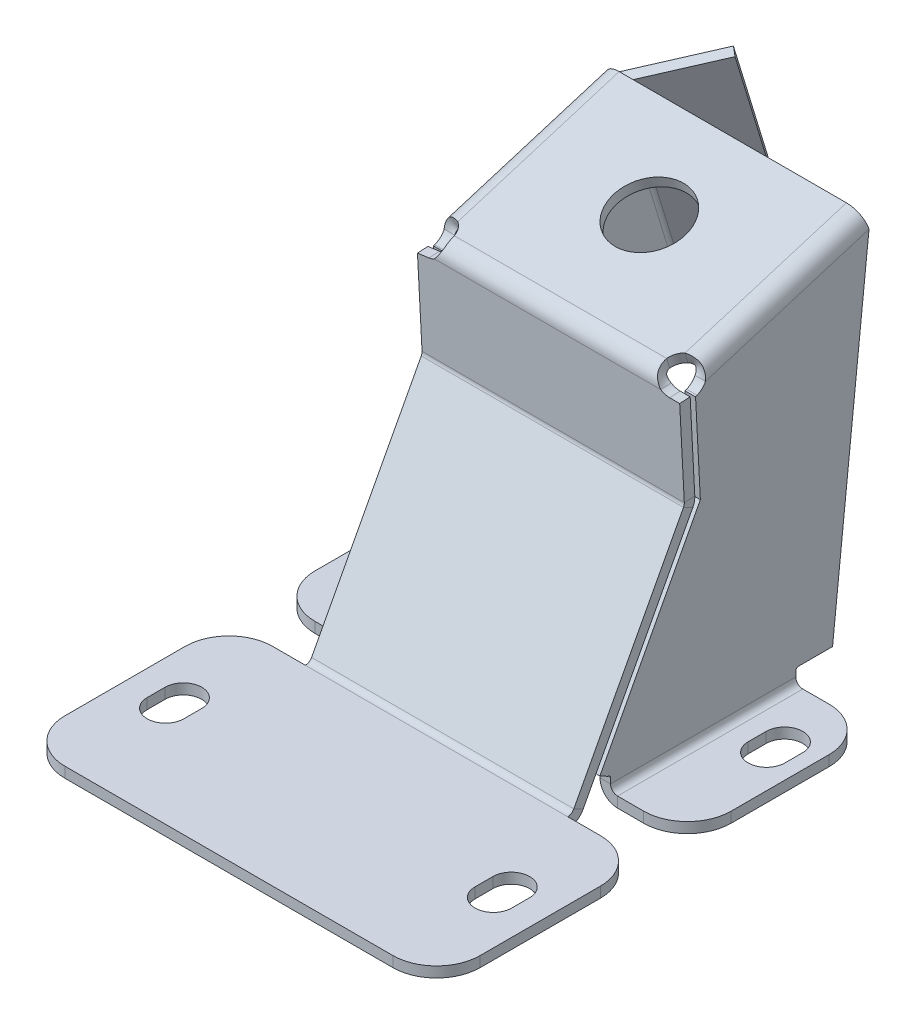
ISO-10303-21;
HEADER;
FILE_DESCRIPTION(('STEP AP214'),'2;1');
FILE_NAME('part.step','',(''),(''),'','','');
FILE_SCHEMA(('AUTOMOTIVE_DESIGN { 1 0 10303 214 1 1 1 1 }'));
ENDSEC;
DATA;
#1=APPLICATION_CONTEXT('core data for automotive mechanical design processes');
#2=APPLICATION_PROTOCOL_DEFINITION('international standard','automotive_design',2000,#1);
#3=PRODUCT_CONTEXT('',#1,'mechanical');
#4=PRODUCT('Part','Part','',(#3));
#5=PRODUCT_RELATED_PRODUCT_CATEGORY('part','',(#4));
#6=PRODUCT_DEFINITION_FORMATION('','',#4);
#7=PRODUCT_DEFINITION_CONTEXT('part definition',#1,'design');
#8=PRODUCT_DEFINITION('design','',#6,#7);
#9=PRODUCT_DEFINITION_SHAPE('','',#8);
#10=(LENGTH_UNIT() NAMED_UNIT(*) SI_UNIT(.MILLI.,.METRE.));
#11=(NAMED_UNIT(*) PLANE_ANGLE_UNIT() SI_UNIT($,.RADIAN.));
#12=(NAMED_UNIT(*) SI_UNIT($,.STERADIAN.) SOLID_ANGLE_UNIT());
#13=UNCERTAINTY_MEASURE_WITH_UNIT(LENGTH_MEASURE(1.E-05),#10,'distance_accuracy_value','');
#14=(GEOMETRIC_REPRESENTATION_CONTEXT(3) GLOBAL_UNCERTAINTY_ASSIGNED_CONTEXT((#13)) GLOBAL_UNIT_ASSIGNED_CONTEXT((#10,
#11,#12)) REPRESENTATION_CONTEXT('',''));
#15=CARTESIAN_POINT('',(0.,0.,0.));
#16=DIRECTION('',(0.,0.,1.));
#17=DIRECTION('',(1.,0.,0.));
#18=AXIS2_PLACEMENT_3D('',#15,#16,#17);
#19=CARTESIAN_POINT('',(-19.0500000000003,-7.17079030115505,-67.4902933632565));
#20=DIRECTION('',(0.,0.105654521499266,0.994402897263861));
#21=DIRECTION('',(0.,-0.994402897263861,0.105654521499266));
#22=AXIS2_PLACEMENT_3D('',#19,#20,#21);
#23=PLANE('',#22);
#24=DIRECTION('',(0.,-0.994402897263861,0.105654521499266));
#25=VECTOR('',#24,1.);
#26=CARTESIAN_POINT('',(-17.5260000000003,-7.17079030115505,-67.4902933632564));
#27=LINE('',#26,#25);
#28=CARTESIAN_POINT('',(-17.5259999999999,53.5380338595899,-73.9405579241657));
#29=VERTEX_POINT('',#28);
#30=CARTESIAN_POINT('',(-17.5259999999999,53.4110338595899,-73.9270642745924));
#31=VERTEX_POINT('',#30);
#32=EDGE_CURVE('E1295',#29,#31,#27,.T.);
#33=ORIENTED_EDGE('',*,*,#32,.T.);
#34=DIRECTION('',(-1.,0.,0.));
#35=VECTOR('',#34,1.);
#36=CARTESIAN_POINT('',(-17.5259999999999,53.4110338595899,-73.9270642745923));
#37=LINE('',#36,#35);
#38=CARTESIAN_POINT('',(-19.0499999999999,53.4110338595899,-73.9270642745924));
#39=VERTEX_POINT('',#38);
#40=EDGE_CURVE('E830',#31,#39,#37,.T.);
#41=ORIENTED_EDGE('',*,*,#40,.T.);
#42=DIRECTION('',(0.,-0.994402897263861,0.105654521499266));
#43=VECTOR('',#42,1.);
#44=CARTESIAN_POINT('',(-19.0500000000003,-7.17079030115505,-67.4902933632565));
#45=LINE('',#44,#43);
#46=CARTESIAN_POINT('',(-19.05,53.5380338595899,-73.9405579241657));
#47=VERTEX_POINT('',#46);
#48=EDGE_CURVE('E1307',#47,#39,#45,.T.);
#49=ORIENTED_EDGE('',*,*,#48,.F.);
#50=DIRECTION('',(-1.,0.,0.));
#51=VECTOR('',#50,1.);
#52=CARTESIAN_POINT('',(-17.5259999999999,53.5380338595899,-73.9405579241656));
#53=LINE('',#52,#51);
#54=EDGE_CURVE('E1299',#29,#47,#53,.T.);
#55=ORIENTED_EDGE('',*,*,#54,.F.);
#56=EDGE_LOOP('',(#33,#41,#49,#55));
#57=FACE_BOUND('',#56,.T.);
#58=ADVANCED_FACE('F229',(#57),#23,.F.);
#59=CARTESIAN_POINT('',(0.,2.87217489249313,-50.1896194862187));
#60=DIRECTION('',(0.,-0.0523359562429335,0.998629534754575));
#61=DIRECTION('',(0.,-0.998629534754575,-0.0523359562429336));
#62=AXIS2_PLACEMENT_3D('',#59,#60,#61);
#63=PLANE('',#62);
#64=CARTESIAN_POINT('',(-17.683113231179,47.7720196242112,-47.8365183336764));
#65=DIRECTION('',(0.,-0.0523359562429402,0.998629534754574));
#66=DIRECTION('',(0.,-0.998629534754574,-0.0523359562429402));
#67=AXIS2_PLACEMENT_3D('',#64,#65,#66);
#68=CIRCLE('',#67,2.2352);
#69=CARTESIAN_POINT('',(-17.3645516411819,45.562668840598,-47.9523055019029));
#70=VERTEX_POINT('',#69);
#71=CARTESIAN_POINT('',(-16.5548403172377,45.8451253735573,-47.9375025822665));
#72=VERTEX_POINT('',#71);
#73=EDGE_CURVE('E1868',#70,#72,#68,.T.);
#74=ORIENTED_EDGE('',*,*,#73,.T.);
#75=DIRECTION('',(-1.,0.,0.));
#76=VECTOR('',#75,1.);
#77=CARTESIAN_POINT('',(19.05,45.8451253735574,-47.9375025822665));
#78=LINE('',#77,#76);
#79=CARTESIAN_POINT('',(16.3243421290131,45.8451253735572,-47.9375025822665));
#80=VERTEX_POINT('',#79);
#81=EDGE_CURVE('E1870',#80,#72,#78,.T.);
#82=ORIENTED_EDGE('',*,*,#81,.F.);
#83=CARTESIAN_POINT('',(17.6011864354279,47.6855644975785,-47.8410492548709));
#84=DIRECTION('',(0.,-0.0523359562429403,0.998629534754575));
#85=DIRECTION('',(0.,-0.998629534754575,-0.0523359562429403));
#86=AXIS2_PLACEMENT_3D('',#83,#84,#85);
#87=CIRCLE('',#86,2.24206395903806);
#88=CARTESIAN_POINT('',(17.6011864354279,45.4465732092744,-47.958389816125));
#89=VERTEX_POINT('',#88);
#90=EDGE_CURVE('E1922',#80,#89,#87,.T.);
#91=ORIENTED_EDGE('',*,*,#90,.T.);
#92=DIRECTION('',(1.,0.,0.));
#93=VECTOR('',#92,1.);
#94=CARTESIAN_POINT('',(17.6011864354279,45.4465732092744,-47.958389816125));
#95=LINE('',#94,#93);
#96=CARTESIAN_POINT('',(19.05,45.4465732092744,-47.958389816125));
#97=VERTEX_POINT('',#96);
#98=EDGE_CURVE('E1930',#89,#97,#95,.T.);
#99=ORIENTED_EDGE('',*,*,#98,.T.);
#100=DIRECTION('',(0.,-0.998629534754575,-0.0523359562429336));
#101=VECTOR('',#100,1.);
#102=CARTESIAN_POINT('',(19.05,2.87217489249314,-50.1896194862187));
#103=LINE('',#102,#101);
#104=CARTESIAN_POINT('',(19.05,32.6344580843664,-48.62984431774));
#105=VERTEX_POINT('',#104);
#106=EDGE_CURVE('E1963',#97,#105,#103,.T.);
#107=ORIENTED_EDGE('',*,*,#106,.T.);
#108=DIRECTION('',(-1.,0.,0.));
#109=VECTOR('',#108,1.);
#110=CARTESIAN_POINT('',(19.05,32.6344580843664,-48.62984431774));
#111=LINE('',#110,#109);
#112=CARTESIAN_POINT('',(-19.05,32.6344580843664,-48.62984431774));
#113=VERTEX_POINT('',#112);
#114=EDGE_CURVE('E1973',#113,#105,#111,.F.);
#115=ORIENTED_EDGE('',*,*,#114,.F.);
#116=DIRECTION('',(0.,0.998629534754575,0.0523359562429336));
#117=VECTOR('',#116,1.);
#118=CARTESIAN_POINT('',(-19.05,2.87217489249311,-50.1896194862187));
#119=LINE('',#118,#117);
#120=CARTESIAN_POINT('',(-19.0500000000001,45.3203132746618,-47.9650068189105));
#121=VERTEX_POINT('',#120);
#122=EDGE_CURVE('E1966',#113,#121,#119,.T.);
#123=ORIENTED_EDGE('',*,*,#122,.T.);
#124=DIRECTION('',(0.989791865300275,0.142325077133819,0.00745894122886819));
#125=VECTOR('',#124,1.);
#126=CARTESIAN_POINT('',(-17.3645516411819,45.562668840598,-47.9523055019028));
#127=LINE('',#126,#125);
#128=EDGE_CURVE('E1872',#121,#70,#127,.T.);
#129=ORIENTED_EDGE('',*,*,#128,.T.);
#130=EDGE_LOOP('',(#74,#82,#91,#99,#107,#115,#123,#129));
#131=FACE_BOUND('',#130,.T.);
#132=ADVANCED_FACE('F1331',(#131),#63,.F.);
#133=CARTESIAN_POINT('',(0.,2.7924148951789,-48.6677080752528));
#134=DIRECTION('',(0.,-0.0523359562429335,0.998629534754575));
#135=DIRECTION('',(0.,-0.998629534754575,-0.0523359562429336));
#136=AXIS2_PLACEMENT_3D('',#133,#134,#135);
#137=PLANE('',#136);
#138=DIRECTION('',(-1.,0.,0.));
#139=VECTOR('',#138,1.);
#140=CARTESIAN_POINT('',(19.05,45.7653653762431,-46.4155911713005));
#141=LINE('',#140,#139);
#142=CARTESIAN_POINT('',(16.3243421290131,45.7653653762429,-46.4155911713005));
#143=VERTEX_POINT('',#142);
#144=CARTESIAN_POINT('',(-16.5548403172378,45.7653653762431,-46.4155911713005));
#145=VERTEX_POINT('',#144);
#146=EDGE_CURVE('E1933',#143,#145,#141,.T.);
#147=ORIENTED_EDGE('',*,*,#146,.T.);
#148=CARTESIAN_POINT('',(-17.683113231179,47.692259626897,-46.3146069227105));
#149=DIRECTION('',(0.,-0.0523359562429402,0.998629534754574));
#150=DIRECTION('',(0.,-0.998629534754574,-0.0523359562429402));
#151=AXIS2_PLACEMENT_3D('',#148,#149,#150);
#152=CIRCLE('',#151,2.2352);
#153=CARTESIAN_POINT('',(-17.3645516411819,45.4829088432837,-46.4303940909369));
#154=VERTEX_POINT('',#153);
#155=EDGE_CURVE('E1881',#154,#145,#152,.T.);
#156=ORIENTED_EDGE('',*,*,#155,.F.);
#157=DIRECTION('',(0.989791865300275,0.142325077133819,0.00745894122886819));
#158=VECTOR('',#157,1.);
#159=CARTESIAN_POINT('',(-17.3645516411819,45.4829088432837,-46.4303940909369));
#160=LINE('',#159,#158);
#161=CARTESIAN_POINT('',(-19.05,45.2405532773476,-46.4430954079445));
#162=VERTEX_POINT('',#161);
#163=EDGE_CURVE('E889',#162,#154,#160,.T.);
#164=ORIENTED_EDGE('',*,*,#163,.F.);
#165=DIRECTION('',(0.,-0.998629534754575,-0.0523359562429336));
#166=VECTOR('',#165,1.);
#167=CARTESIAN_POINT('',(-19.05,48.126566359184,-46.2918458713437));
#168=LINE('',#167,#166);
#169=CARTESIAN_POINT('',(-19.05,32.5546980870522,-47.107932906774));
#170=VERTEX_POINT('',#169);
#171=EDGE_CURVE('E1970',#170,#162,#168,.F.);
#172=ORIENTED_EDGE('',*,*,#171,.F.);
#173=DIRECTION('',(-1.,0.,0.));
#174=VECTOR('',#173,1.);
#175=CARTESIAN_POINT('',(19.05,32.5546980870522,-47.107932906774));
#176=LINE('',#175,#174);
#177=CARTESIAN_POINT('',(19.05,32.5546980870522,-47.107932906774));
#178=VERTEX_POINT('',#177);
#179=EDGE_CURVE('E1979',#178,#170,#176,.T.);
#180=ORIENTED_EDGE('',*,*,#179,.F.);
#181=DIRECTION('',(0.,0.998629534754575,0.0523359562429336));
#182=VECTOR('',#181,1.);
#183=CARTESIAN_POINT('',(19.05,32.2733224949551,-47.1226791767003));
#184=LINE('',#183,#182);
#185=CARTESIAN_POINT('',(19.05,45.3668132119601,-46.4364784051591));
#186=VERTEX_POINT('',#185);
#187=EDGE_CURVE('E1968',#186,#178,#184,.F.);
#188=ORIENTED_EDGE('',*,*,#187,.F.);
#189=DIRECTION('',(1.,0.,0.));
#190=VECTOR('',#189,1.);
#191=CARTESIAN_POINT('',(0.,45.3668132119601,-46.436478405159));
#192=LINE('',#191,#190);
#193=CARTESIAN_POINT('',(17.601186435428,45.3668132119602,-46.4364784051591));
#194=VERTEX_POINT('',#193);
#195=EDGE_CURVE('E1929',#194,#186,#192,.T.);
#196=ORIENTED_EDGE('',*,*,#195,.F.);
#197=CARTESIAN_POINT('',(17.6011864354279,47.6058045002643,-46.319137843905));
#198=DIRECTION('',(0.,-0.0523359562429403,0.998629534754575));
#199=DIRECTION('',(0.,-0.998629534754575,-0.0523359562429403));
#200=AXIS2_PLACEMENT_3D('',#197,#198,#199);
#201=CIRCLE('',#200,2.24206395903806);
#202=EDGE_CURVE('E1953',#143,#194,#201,.T.);
#203=ORIENTED_EDGE('',*,*,#202,.F.);
#204=EDGE_LOOP('',(#147,#156,#164,#172,#180,#188,#196,#203));
#205=FACE_BOUND('',#204,.T.);
#206=ADVANCED_FACE('F1336',(#205),#137,.T.);
#207=CARTESIAN_POINT('',(-19.05,48.2063263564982,-47.8137572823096));
#208=DIRECTION('',(1.,0.,0.));
#209=DIRECTION('',(0.,1.,0.));
#210=AXIS2_PLACEMENT_3D('',#207,#208,#209);
#211=PLANE('',#210);
#212=DIRECTION('',(0.,-0.0523359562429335,0.998629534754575));
#213=VECTOR('',#212,1.);
#214=CARTESIAN_POINT('',(-19.05,45.2405532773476,-46.4430954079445));
#215=LINE('',#214,#213);
#216=EDGE_CURVE('E1876',#162,#121,#215,.F.);
#217=ORIENTED_EDGE('',*,*,#216,.T.);
#218=ORIENTED_EDGE('',*,*,#122,.F.);
#219=DIRECTION('',(0.,-0.0523359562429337,0.998629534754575));
#220=VECTOR('',#219,1.);
#221=CARTESIAN_POINT('',(-19.05,32.5546980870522,-47.107932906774));
#222=LINE('',#221,#220);
#223=EDGE_CURVE('E1976',#170,#113,#222,.F.);
#224=ORIENTED_EDGE('',*,*,#223,.F.);
#225=ORIENTED_EDGE('',*,*,#171,.T.);
#226=EDGE_LOOP('',(#217,#218,#224,#225));
#227=FACE_BOUND('',#226,.T.);
#228=ADVANCED_FACE('F2092',(#227),#211,.F.);
#229=CARTESIAN_POINT('',(19.05,32.3530824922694,-48.6445905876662));
#230=DIRECTION('',(-1.,0.,0.));
#231=DIRECTION('',(0.,-1.,0.));
#232=AXIS2_PLACEMENT_3D('',#229,#230,#231);
#233=PLANE('',#232);
#234=DIRECTION('',(0.,0.0523359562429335,-0.998629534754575));
#235=VECTOR('',#234,1.);
#236=CARTESIAN_POINT('',(19.05,45.4465732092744,-47.958389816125));
#237=LINE('',#236,#235);
#238=EDGE_CURVE('E1956',#97,#186,#237,.F.);
#239=ORIENTED_EDGE('',*,*,#238,.T.);
#240=ORIENTED_EDGE('',*,*,#187,.T.);
#241=DIRECTION('',(0.,-0.0523359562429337,0.998629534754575));
#242=VECTOR('',#241,1.);
#243=CARTESIAN_POINT('',(19.05,32.6344580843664,-48.62984431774));
#244=LINE('',#243,#242);
#245=EDGE_CURVE('E1959',#178,#105,#244,.F.);
#246=ORIENTED_EDGE('',*,*,#245,.T.);
#247=ORIENTED_EDGE('',*,*,#106,.F.);
#248=EDGE_LOOP('',(#239,#240,#246,#247));
#249=FACE_BOUND('',#248,.T.);
#250=ADVANCED_FACE('F2062',(#249),#233,.F.);
#251=CARTESIAN_POINT('',(-30.1625,1.52400000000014,-30.1625));
#252=DIRECTION('',(0.,0.,1.));
#253=DIRECTION('',(1.,0.,0.));
#254=AXIS2_PLACEMENT_3D('',#251,#252,#253);
#255=PLANE('',#254);
#256=DIRECTION('',(0.,-1.,0.));
#257=VECTOR('',#256,1.);
#258=CARTESIAN_POINT('',(19.05,1.52400000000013,-30.1625));
#259=LINE('',#258,#257);
#260=CARTESIAN_POINT('',(19.05,1.52400000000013,-30.1625));
#261=VERTEX_POINT('',#260);
#262=CARTESIAN_POINT('',(19.05,1.31838984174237E-13,-30.1625));
#263=VERTEX_POINT('',#262);
#264=EDGE_CURVE('E2033',#261,#263,#259,.T.);
#265=ORIENTED_EDGE('',*,*,#264,.F.);
#266=DIRECTION('',(-1.,0.,0.));
#267=VECTOR('',#266,1.);
#268=CARTESIAN_POINT('',(-30.1625,1.52400000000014,-30.1625));
#269=LINE('',#268,#267);
#270=CARTESIAN_POINT('',(23.8125,1.52400000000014,-30.1625));
#271=VERTEX_POINT('',#270);
#272=EDGE_CURVE('E2285',#271,#261,#269,.T.);
#273=ORIENTED_EDGE('',*,*,#272,.F.);
#274=DIRECTION('',(0.,-1.,0.));
#275=VECTOR('',#274,1.);
#276=CARTESIAN_POINT('',(23.8125,1.52400000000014,-30.1625));
#277=LINE('',#276,#275);
#278=CARTESIAN_POINT('',(23.8125,1.40512601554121E-13,-30.1625));
#279=VERTEX_POINT('',#278);
#280=EDGE_CURVE('E2267',#271,#279,#277,.T.);
#281=ORIENTED_EDGE('',*,*,#280,.T.);
#282=DIRECTION('',(-1.,0.,0.));
#283=VECTOR('',#282,1.);
#284=CARTESIAN_POINT('',(-30.1625,1.43982048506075E-13,-30.1625));
#285=LINE('',#284,#283);
#286=EDGE_CURVE('E2233',#279,#263,#285,.T.);
#287=ORIENTED_EDGE('',*,*,#286,.T.);
#288=EDGE_LOOP('',(#265,#273,#281,#287));
#289=FACE_BOUND('',#288,.T.);
#290=ADVANCED_FACE('F2099',(#289),#255,.F.);
#291=CARTESIAN_POINT('',(30.1625,1.52400000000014,0.));
#292=DIRECTION('',(-1.,0.,0.));
#293=DIRECTION('',(0.,0.,1.));
#294=AXIS2_PLACEMENT_3D('',#291,#292,#293);
#295=PLANE('',#294);
#296=DIRECTION('',(0.,0.,-1.));
#297=VECTOR('',#296,1.);
#298=CARTESIAN_POINT('',(30.1625,1.42247325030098E-13,0.));
#299=LINE('',#298,#297);
#300=CARTESIAN_POINT('',(30.1625,1.45716771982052E-13,-6.34999999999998));
#301=VERTEX_POINT('',#300);
#302=CARTESIAN_POINT('',(30.1625,1.42247325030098E-13,-23.8125));
#303=VERTEX_POINT('',#302);
#304=EDGE_CURVE('E2243',#301,#303,#299,.T.);
#305=ORIENTED_EDGE('',*,*,#304,.T.);
#306=DIRECTION('',(0.,-1.,0.));
#307=VECTOR('',#306,1.);
#308=CARTESIAN_POINT('',(30.1625,1.52400000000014,-23.8125));
#309=LINE('',#308,#307);
#310=CARTESIAN_POINT('',(30.1625,1.52400000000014,-23.8125));
#311=VERTEX_POINT('',#310);
#312=EDGE_CURVE('E2227',#303,#311,#309,.F.);
#313=ORIENTED_EDGE('',*,*,#312,.T.);
#314=DIRECTION('',(0.,0.,-1.));
#315=VECTOR('',#314,1.);
#316=CARTESIAN_POINT('',(30.1625,1.52400000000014,0.));
#317=LINE('',#316,#315);
#318=CARTESIAN_POINT('',(30.1625,1.52400000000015,-6.34999999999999));
#319=VERTEX_POINT('',#318);
#320=EDGE_CURVE('E2251',#319,#311,#317,.T.);
#321=ORIENTED_EDGE('',*,*,#320,.F.);
#322=DIRECTION('',(0.,-1.,0.));
#323=VECTOR('',#322,1.);
#324=CARTESIAN_POINT('',(30.1625,1.52400000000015,-6.34999999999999));
#325=LINE('',#324,#323);
#326=EDGE_CURVE('E2211',#319,#301,#325,.T.);
#327=ORIENTED_EDGE('',*,*,#326,.T.);
#328=EDGE_LOOP('',(#305,#313,#321,#327));
#329=FACE_BOUND('',#328,.T.);
#330=ADVANCED_FACE('F2188',(#329),#295,.F.);
#331=CARTESIAN_POINT('',(-19.05,1.52400000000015,-30.1625));
#332=VERTEX_POINT('',#331);
#333=CARTESIAN_POINT('',(-23.8125,1.52400000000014,-30.1625));
#334=VERTEX_POINT('',#333);
#335=EDGE_CURVE('E2274',#332,#334,#269,.T.);
#336=ORIENTED_EDGE('',*,*,#335,.F.);
#337=DIRECTION('',(0.,-1.,0.));
#338=VECTOR('',#337,1.);
#339=CARTESIAN_POINT('',(-19.05,1.52400000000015,-30.1625));
#340=LINE('',#339,#338);
#341=CARTESIAN_POINT('',(-19.05,1.40512601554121E-13,-30.1625));
#342=VERTEX_POINT('',#341);
#343=EDGE_CURVE('E2037',#332,#342,#340,.T.);
#344=ORIENTED_EDGE('',*,*,#343,.T.);
#345=CARTESIAN_POINT('',(-23.8125,1.38777878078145E-13,-30.1625));
#346=VERTEX_POINT('',#345);
#347=EDGE_CURVE('E2238',#342,#346,#285,.T.);
#348=ORIENTED_EDGE('',*,*,#347,.T.);
#349=DIRECTION('',(0.,-1.,0.));
#350=VECTOR('',#349,1.);
#351=CARTESIAN_POINT('',(-23.8125,1.52400000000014,-30.1625));
#352=LINE('',#351,#350);
#353=EDGE_CURVE('E2221',#346,#334,#352,.F.);
#354=ORIENTED_EDGE('',*,*,#353,.T.);
#355=EDGE_LOOP('',(#336,#344,#348,#354));
#356=FACE_BOUND('',#355,.T.);
#357=ADVANCED_FACE('F2184',(#356),#255,.F.);
#358=CARTESIAN_POINT('',(-30.1625,1.52400000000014,0.));
#359=DIRECTION('',(1.,0.,0.));
#360=DIRECTION('',(0.,0.,-1.));
#361=AXIS2_PLACEMENT_3D('',#358,#359,#360);
#362=PLANE('',#361);
#363=DIRECTION('',(0.,0.,1.));
#364=VECTOR('',#363,1.);
#365=CARTESIAN_POINT('',(-30.1625,1.52400000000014,0.));
#366=LINE('',#365,#364);
#367=CARTESIAN_POINT('',(-30.1625,1.52400000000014,-23.8125));
#368=VERTEX_POINT('',#367);
#369=CARTESIAN_POINT('',(-30.1625,1.52400000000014,-6.34999999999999));
#370=VERTEX_POINT('',#369);
#371=EDGE_CURVE('E2281',#368,#370,#366,.T.);
#372=ORIENTED_EDGE('',*,*,#371,.F.);
#373=DIRECTION('',(0.,-1.,0.));
#374=VECTOR('',#373,1.);
#375=CARTESIAN_POINT('',(-30.1625,1.52400000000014,-23.8125));
#376=LINE('',#375,#374);
#377=CARTESIAN_POINT('',(-30.1625,1.43982048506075E-13,-23.8125));
#378=VERTEX_POINT('',#377);
#379=EDGE_CURVE('E2254',#368,#378,#376,.T.);
#380=ORIENTED_EDGE('',*,*,#379,.T.);
#381=DIRECTION('',(0.,0.,1.));
#382=VECTOR('',#381,1.);
#383=CARTESIAN_POINT('',(-30.1625,1.33573707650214E-13,0.));
#384=LINE('',#383,#382);
#385=CARTESIAN_POINT('',(-30.1625,1.35308431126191E-13,-6.34999999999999));
#386=VERTEX_POINT('',#385);
#387=EDGE_CURVE('E2237',#378,#386,#384,.T.);
#388=ORIENTED_EDGE('',*,*,#387,.T.);
#389=DIRECTION('',(0.,-1.,0.));
#390=VECTOR('',#389,1.);
#391=CARTESIAN_POINT('',(-30.1625,1.52400000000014,-6.34999999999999));
#392=LINE('',#391,#390);
#393=EDGE_CURVE('E2252',#386,#370,#392,.F.);
#394=ORIENTED_EDGE('',*,*,#393,.T.);
#395=EDGE_LOOP('',(#372,#380,#388,#394));
#396=FACE_BOUND('',#395,.T.);
#397=ADVANCED_FACE('F2180',(#396),#362,.F.);
#398=CARTESIAN_POINT('',(-30.1625,1.52400000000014,0.));
#399=DIRECTION('',(0.,0.,-1.));
#400=DIRECTION('',(-1.,0.,0.));
#401=AXIS2_PLACEMENT_3D('',#398,#399,#400);
#402=PLANE('',#401);
#403=DIRECTION('',(1.,0.,0.));
#404=VECTOR('',#403,1.);
#405=CARTESIAN_POINT('',(-30.1625,1.33573707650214E-13,0.));
#406=LINE('',#405,#404);
#407=CARTESIAN_POINT('',(-23.8125,1.40512601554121E-13,0.));
#408=VERTEX_POINT('',#407);
#409=CARTESIAN_POINT('',(23.8125,1.35308431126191E-13,0.));
#410=VERTEX_POINT('',#409);
#411=EDGE_CURVE('E2248',#408,#410,#406,.T.);
#412=ORIENTED_EDGE('',*,*,#411,.T.);
#413=DIRECTION('',(0.,-1.,0.));
#414=VECTOR('',#413,1.);
#415=CARTESIAN_POINT('',(23.8125,1.52400000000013,0.));
#416=LINE('',#415,#414);
#417=CARTESIAN_POINT('',(23.8125,1.52400000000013,0.));
#418=VERTEX_POINT('',#417);
#419=EDGE_CURVE('E1935',#410,#418,#416,.F.);
#420=ORIENTED_EDGE('',*,*,#419,.T.);
#421=DIRECTION('',(1.,0.,0.));
#422=VECTOR('',#421,1.);
#423=CARTESIAN_POINT('',(-30.1625,1.52400000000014,0.));
#424=LINE('',#423,#422);
#425=CARTESIAN_POINT('',(-23.8125,1.52400000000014,0.));
#426=VERTEX_POINT('',#425);
#427=EDGE_CURVE('E2255',#426,#418,#424,.T.);
#428=ORIENTED_EDGE('',*,*,#427,.F.);
#429=DIRECTION('',(0.,-1.,0.));
#430=VECTOR('',#429,1.);
#431=CARTESIAN_POINT('',(-23.8125,1.52400000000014,0.));
#432=LINE('',#431,#430);
#433=EDGE_CURVE('E2229',#426,#408,#432,.T.);
#434=ORIENTED_EDGE('',*,*,#433,.T.);
#435=EDGE_LOOP('',(#412,#420,#428,#434));
#436=FACE_BOUND('',#435,.T.);
#437=ADVANCED_FACE('F2172',(#436),#402,.F.);
#438=CARTESIAN_POINT('',(0.,1.52400000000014,0.));
#439=DIRECTION('',(0.,-1.,0.));
#440=DIRECTION('',(0.,0.,-1.));
#441=AXIS2_PLACEMENT_3D('',#438,#439,#440);
#442=PLANE('',#441);
#443=DIRECTION('',(0.,0.,1.));
#444=VECTOR('',#443,1.);
#445=CARTESIAN_POINT('',(-26.4795000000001,1.52400000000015,-17.2085));
#446=LINE('',#445,#444);
#447=CARTESIAN_POINT('',(-26.4795000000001,1.52400000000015,-17.2085));
#448=VERTEX_POINT('',#447);
#449=CARTESIAN_POINT('',(-26.4795,1.52400000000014,-14.605));
#450=VERTEX_POINT('',#449);
#451=EDGE_CURVE('E2376',#448,#450,#446,.T.);
#452=ORIENTED_EDGE('',*,*,#451,.F.);
#453=CARTESIAN_POINT('',(-23.8125,1.52400000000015,-17.2085));
#454=DIRECTION('',(0.,1.,0.));
#455=DIRECTION('',(0.,0.,-1.));
#456=AXIS2_PLACEMENT_3D('',#453,#454,#455);
#457=CIRCLE('',#456,2.66700000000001);
#458=CARTESIAN_POINT('',(-21.1455,1.52400000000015,-17.2085));
#459=VERTEX_POINT('',#458);
#460=EDGE_CURVE('E2036',#459,#448,#457,.T.);
#461=ORIENTED_EDGE('',*,*,#460,.F.);
#462=DIRECTION('',(0.,0.,-1.));
#463=VECTOR('',#462,1.);
#464=CARTESIAN_POINT('',(-21.1455,1.52400000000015,-17.2085));
#465=LINE('',#464,#463);
#466=CARTESIAN_POINT('',(-21.1455,1.52400000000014,-14.605));
#467=VERTEX_POINT('',#466);
#468=EDGE_CURVE('E2369',#467,#459,#465,.T.);
#469=ORIENTED_EDGE('',*,*,#468,.F.);
#470=CARTESIAN_POINT('',(-23.8125,1.52400000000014,-14.605));
#471=DIRECTION('',(0.,1.,0.));
#472=DIRECTION('',(0.,0.,-1.));
#473=AXIS2_PLACEMENT_3D('',#470,#471,#472);
#474=CIRCLE('',#473,2.667);
#475=EDGE_CURVE('E2373',#450,#467,#474,.T.);
#476=ORIENTED_EDGE('',*,*,#475,.F.);
#477=EDGE_LOOP('',(#452,#461,#469,#476));
#478=FACE_BOUND('',#477,.T.);
#479=DIRECTION('',(0.,0.,1.));
#480=VECTOR('',#479,1.);
#481=CARTESIAN_POINT('',(21.1455,1.52400000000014,-17.2085));
#482=LINE('',#481,#480);
#483=CARTESIAN_POINT('',(21.1455,1.52400000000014,-17.2085));
#484=VERTEX_POINT('',#483);
#485=CARTESIAN_POINT('',(21.1455,1.52400000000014,-14.605));
#486=VERTEX_POINT('',#485);
#487=EDGE_CURVE('E2349',#484,#486,#482,.T.);
#488=ORIENTED_EDGE('',*,*,#487,.F.);
#489=CARTESIAN_POINT('',(23.8125,1.52400000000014,-17.2085));
#490=DIRECTION('',(0.,1.,0.));
#491=DIRECTION('',(0.,0.,1.));
#492=AXIS2_PLACEMENT_3D('',#489,#490,#491);
#493=CIRCLE('',#492,2.667);
#494=CARTESIAN_POINT('',(26.4795,1.52400000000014,-17.2085));
#495=VERTEX_POINT('',#494);
#496=EDGE_CURVE('E2347',#495,#484,#493,.T.);
#497=ORIENTED_EDGE('',*,*,#496,.F.);
#498=DIRECTION('',(0.,0.,-1.));
#499=VECTOR('',#498,1.);
#500=CARTESIAN_POINT('',(26.4795,1.52400000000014,-17.2085));
#501=LINE('',#500,#499);
#502=CARTESIAN_POINT('',(26.4795,1.52400000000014,-14.605));
#503=VERTEX_POINT('',#502);
#504=EDGE_CURVE('E2327',#503,#495,#501,.T.);
#505=ORIENTED_EDGE('',*,*,#504,.F.);
#506=CARTESIAN_POINT('',(23.8125,1.52400000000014,-14.605));
#507=DIRECTION('',(0.,1.,0.));
#508=DIRECTION('',(0.,0.,1.));
#509=AXIS2_PLACEMENT_3D('',#506,#507,#508);
#510=CIRCLE('',#509,2.667);
#511=EDGE_CURVE('E2351',#486,#503,#510,.T.);
#512=ORIENTED_EDGE('',*,*,#511,.F.);
#513=EDGE_LOOP('',(#488,#497,#505,#512));
#514=FACE_BOUND('',#513,.T.);
#515=ORIENTED_EDGE('',*,*,#272,.T.);
#516=DIRECTION('',(-1.,0.,0.));
#517=VECTOR('',#516,1.);
#518=CARTESIAN_POINT('',(-19.05,1.52400000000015,-30.1625));
#519=LINE('',#518,#517);
#520=EDGE_CURVE('E2044',#332,#261,#519,.F.);
#521=ORIENTED_EDGE('',*,*,#520,.F.);
#522=ORIENTED_EDGE('',*,*,#335,.T.);
#523=CARTESIAN_POINT('',(-23.8125,1.52400000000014,-23.8125));
#524=DIRECTION('',(0.,-1.,0.));
#525=DIRECTION('',(0.,0.,-1.));
#526=AXIS2_PLACEMENT_3D('',#523,#524,#525);
#527=CIRCLE('',#526,6.35);
#528=EDGE_CURVE('E2219',#334,#368,#527,.F.);
#529=ORIENTED_EDGE('',*,*,#528,.T.);
#530=ORIENTED_EDGE('',*,*,#371,.T.);
#531=CARTESIAN_POINT('',(-23.8125,1.52400000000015,-6.35000000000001));
#532=DIRECTION('',(0.,-1.,0.));
#533=DIRECTION('',(0.,0.,-1.));
#534=AXIS2_PLACEMENT_3D('',#531,#532,#533);
#535=CIRCLE('',#534,6.35);
#536=EDGE_CURVE('E2217',#370,#426,#535,.F.);
#537=ORIENTED_EDGE('',*,*,#536,.T.);
#538=ORIENTED_EDGE('',*,*,#427,.T.);
#539=CARTESIAN_POINT('',(23.8125,1.52400000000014,-6.34999999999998));
#540=DIRECTION('',(0.,-1.,0.));
#541=DIRECTION('',(0.,0.,-1.));
#542=AXIS2_PLACEMENT_3D('',#539,#540,#541);
#543=CIRCLE('',#542,6.35);
#544=EDGE_CURVE('E2209',#418,#319,#543,.F.);
#545=ORIENTED_EDGE('',*,*,#544,.T.);
#546=ORIENTED_EDGE('',*,*,#320,.T.);
#547=CARTESIAN_POINT('',(23.8125,1.52400000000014,-23.8125));
#548=DIRECTION('',(0.,-1.,0.));
#549=DIRECTION('',(0.,0.,-1.));
#550=AXIS2_PLACEMENT_3D('',#547,#548,#549);
#551=CIRCLE('',#550,6.35);
#552=EDGE_CURVE('E2216',#311,#271,#551,.F.);
#553=ORIENTED_EDGE('',*,*,#552,.T.);
#554=EDGE_LOOP('',(#515,#521,#522,#529,#530,#537,#538,#545,#546,#553));
#555=FACE_BOUND('',#554,.T.);
#556=ADVANCED_FACE('F2168',(#478,#514,#555),#442,.F.);
#557=CARTESIAN_POINT('',(0.,1.35308431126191E-13,0.));
#558=DIRECTION('',(0.,-1.,0.));
#559=DIRECTION('',(0.,0.,-1.));
#560=AXIS2_PLACEMENT_3D('',#557,#558,#559);
#561=PLANE('',#560);
#562=CARTESIAN_POINT('',(-23.8125,1.38777878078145E-13,-17.2085));
#563=DIRECTION('',(0.,1.,0.));
#564=DIRECTION('',(0.,0.,-1.));
#565=AXIS2_PLACEMENT_3D('',#562,#563,#564);
#566=CIRCLE('',#565,2.66700000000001);
#567=CARTESIAN_POINT('',(-21.1455,1.38777878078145E-13,-17.2085));
#568=VERTEX_POINT('',#567);
#569=CARTESIAN_POINT('',(-26.4795000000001,1.37043154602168E-13,-17.2085));
#570=VERTEX_POINT('',#569);
#571=EDGE_CURVE('E2372',#568,#570,#566,.T.);
#572=ORIENTED_EDGE('',*,*,#571,.T.);
#573=DIRECTION('',(0.,0.,1.));
#574=VECTOR('',#573,1.);
#575=CARTESIAN_POINT('',(-26.4795000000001,1.37043154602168E-13,-17.2085));
#576=LINE('',#575,#574);
#577=CARTESIAN_POINT('',(-26.4795,1.38777878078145E-13,-14.605));
#578=VERTEX_POINT('',#577);
#579=EDGE_CURVE('E2385',#570,#578,#576,.T.);
#580=ORIENTED_EDGE('',*,*,#579,.T.);
#581=CARTESIAN_POINT('',(-23.8125,1.42247325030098E-13,-14.605));
#582=DIRECTION('',(0.,1.,0.));
#583=DIRECTION('',(0.,0.,-1.));
#584=AXIS2_PLACEMENT_3D('',#581,#582,#583);
#585=CIRCLE('',#584,2.667);
#586=CARTESIAN_POINT('',(-21.1455,1.38777878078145E-13,-14.605));
#587=VERTEX_POINT('',#586);
#588=EDGE_CURVE('E2382',#578,#587,#585,.T.);
#589=ORIENTED_EDGE('',*,*,#588,.T.);
#590=DIRECTION('',(0.,0.,-1.));
#591=VECTOR('',#590,1.);
#592=CARTESIAN_POINT('',(-21.1455,1.38777878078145E-13,-17.2085));
#593=LINE('',#592,#591);
#594=EDGE_CURVE('E2364',#587,#568,#593,.T.);
#595=ORIENTED_EDGE('',*,*,#594,.T.);
#596=EDGE_LOOP('',(#572,#580,#589,#595));
#597=FACE_BOUND('',#596,.T.);
#598=CARTESIAN_POINT('',(23.8125,1.38777878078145E-13,-17.2085));
#599=DIRECTION('',(0.,1.,0.));
#600=DIRECTION('',(0.,0.,1.));
#601=AXIS2_PLACEMENT_3D('',#598,#599,#600);
#602=CIRCLE('',#601,2.667);
#603=CARTESIAN_POINT('',(26.4795,1.31838984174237E-13,-17.2085));
#604=VERTEX_POINT('',#603);
#605=CARTESIAN_POINT('',(21.1455,1.35308431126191E-13,-17.2085));
#606=VERTEX_POINT('',#605);
#607=EDGE_CURVE('E2355',#604,#606,#602,.T.);
#608=ORIENTED_EDGE('',*,*,#607,.T.);
#609=DIRECTION('',(0.,0.,1.));
#610=VECTOR('',#609,1.);
#611=CARTESIAN_POINT('',(21.1455,1.35308431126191E-13,-17.2085));
#612=LINE('',#611,#610);
#613=CARTESIAN_POINT('',(21.1455,1.37043154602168E-13,-14.605));
#614=VERTEX_POINT('',#613);
#615=EDGE_CURVE('E2343',#606,#614,#612,.T.);
#616=ORIENTED_EDGE('',*,*,#615,.T.);
#617=CARTESIAN_POINT('',(23.8125,1.37043154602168E-13,-14.605));
#618=DIRECTION('',(0.,1.,0.));
#619=DIRECTION('',(0.,0.,1.));
#620=AXIS2_PLACEMENT_3D('',#617,#618,#619);
#621=CIRCLE('',#620,2.667);
#622=CARTESIAN_POINT('',(26.4795,1.37043154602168E-13,-14.605));
#623=VERTEX_POINT('',#622);
#624=EDGE_CURVE('E2337',#614,#623,#621,.T.);
#625=ORIENTED_EDGE('',*,*,#624,.T.);
#626=DIRECTION('',(0.,0.,-1.));
#627=VECTOR('',#626,1.);
#628=CARTESIAN_POINT('',(26.4795,1.31838984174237E-13,-17.2085));
#629=LINE('',#628,#627);
#630=EDGE_CURVE('E2332',#623,#604,#629,.T.);
#631=ORIENTED_EDGE('',*,*,#630,.T.);
#632=EDGE_LOOP('',(#608,#616,#625,#631));
#633=FACE_BOUND('',#632,.T.);
#634=ORIENTED_EDGE('',*,*,#387,.F.);
#635=CARTESIAN_POINT('',(-23.8125,1.40512601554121E-13,-23.8125));
#636=DIRECTION('',(0.,-1.,0.));
#637=DIRECTION('',(0.,0.,-1.));
#638=AXIS2_PLACEMENT_3D('',#635,#636,#637);
#639=CIRCLE('',#638,6.35);
#640=EDGE_CURVE('E2264',#378,#346,#639,.T.);
#641=ORIENTED_EDGE('',*,*,#640,.T.);
#642=ORIENTED_EDGE('',*,*,#347,.F.);
#643=DIRECTION('',(-1.,0.,0.));
#644=VECTOR('',#643,1.);
#645=CARTESIAN_POINT('',(-19.05,1.49186218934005E-13,-30.1625));
#646=LINE('',#645,#644);
#647=EDGE_CURVE('E2050',#342,#263,#646,.F.);
#648=ORIENTED_EDGE('',*,*,#647,.T.);
#649=ORIENTED_EDGE('',*,*,#286,.F.);
#650=CARTESIAN_POINT('',(23.8125,1.42247325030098E-13,-23.8125));
#651=DIRECTION('',(0.,-1.,0.));
#652=DIRECTION('',(0.,0.,-1.));
#653=AXIS2_PLACEMENT_3D('',#650,#651,#652);
#654=CIRCLE('',#653,6.35);
#655=EDGE_CURVE('E2262',#279,#303,#654,.T.);
#656=ORIENTED_EDGE('',*,*,#655,.T.);
#657=ORIENTED_EDGE('',*,*,#304,.F.);
#658=CARTESIAN_POINT('',(23.8125,1.35308431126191E-13,-6.34999999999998));
#659=DIRECTION('',(0.,-1.,0.));
#660=DIRECTION('',(0.,0.,-1.));
#661=AXIS2_PLACEMENT_3D('',#658,#659,#660);
#662=CIRCLE('',#661,6.35);
#663=EDGE_CURVE('E2260',#301,#410,#662,.T.);
#664=ORIENTED_EDGE('',*,*,#663,.T.);
#665=ORIENTED_EDGE('',*,*,#411,.F.);
#666=CARTESIAN_POINT('',(-23.8125,1.43982048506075E-13,-6.34999999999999));
#667=DIRECTION('',(0.,-1.,0.));
#668=DIRECTION('',(0.,0.,-1.));
#669=AXIS2_PLACEMENT_3D('',#666,#667,#668);
#670=CIRCLE('',#669,6.35);
#671=EDGE_CURVE('E2258',#408,#386,#670,.T.);
#672=ORIENTED_EDGE('',*,*,#671,.T.);
#673=EDGE_LOOP('',(#634,#641,#642,#648,#649,#656,#657,#664,#665,#672));
#674=FACE_BOUND('',#673,.T.);
#675=ADVANCED_FACE('F2171',(#597,#633,#674),#561,.T.);
#676=CARTESIAN_POINT('',(-23.8125,1.52400000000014,-23.8125));
#677=DIRECTION('',(0.,-1.,0.));
#678=DIRECTION('',(0.,0.,-1.));
#679=AXIS2_PLACEMENT_3D('',#676,#677,#678);
#680=CYLINDRICAL_SURFACE('',#679,6.35);
#681=ORIENTED_EDGE('',*,*,#528,.F.);
#682=ORIENTED_EDGE('',*,*,#353,.F.);
#683=ORIENTED_EDGE('',*,*,#640,.F.);
#684=ORIENTED_EDGE('',*,*,#379,.F.);
#685=EDGE_LOOP('',(#681,#682,#683,#684));
#686=FACE_BOUND('',#685,.T.);
#687=ADVANCED_FACE('F2176',(#686),#680,.T.);
#688=CARTESIAN_POINT('',(23.8125,1.52400000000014,-23.8125));
#689=DIRECTION('',(0.,-1.,0.));
#690=DIRECTION('',(0.,0.,-1.));
#691=AXIS2_PLACEMENT_3D('',#688,#689,#690);
#692=CYLINDRICAL_SURFACE('',#691,6.35);
#693=ORIENTED_EDGE('',*,*,#552,.F.);
#694=ORIENTED_EDGE('',*,*,#312,.F.);
#695=ORIENTED_EDGE('',*,*,#655,.F.);
#696=ORIENTED_EDGE('',*,*,#280,.F.);
#697=EDGE_LOOP('',(#693,#694,#695,#696));
#698=FACE_BOUND('',#697,.T.);
#699=ADVANCED_FACE('F2195',(#698),#692,.T.);
#700=CARTESIAN_POINT('',(23.8125,1.52400000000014,-6.34999999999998));
#701=DIRECTION('',(0.,-1.,0.));
#702=DIRECTION('',(0.,0.,-1.));
#703=AXIS2_PLACEMENT_3D('',#700,#701,#702);
#704=CYLINDRICAL_SURFACE('',#703,6.35);
#705=ORIENTED_EDGE('',*,*,#544,.F.);
#706=ORIENTED_EDGE('',*,*,#419,.F.);
#707=ORIENTED_EDGE('',*,*,#663,.F.);
#708=ORIENTED_EDGE('',*,*,#326,.F.);
#709=EDGE_LOOP('',(#705,#706,#707,#708));
#710=FACE_BOUND('',#709,.T.);
#711=ADVANCED_FACE('F2198',(#710),#704,.T.);
#712=CARTESIAN_POINT('',(-23.8125,1.52400000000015,-6.35000000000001));
#713=DIRECTION('',(0.,-1.,0.));
#714=DIRECTION('',(0.,0.,-1.));
#715=AXIS2_PLACEMENT_3D('',#712,#713,#714);
#716=CYLINDRICAL_SURFACE('',#715,6.35);
#717=ORIENTED_EDGE('',*,*,#536,.F.);
#718=ORIENTED_EDGE('',*,*,#393,.F.);
#719=ORIENTED_EDGE('',*,*,#671,.F.);
#720=ORIENTED_EDGE('',*,*,#433,.F.);
#721=EDGE_LOOP('',(#717,#718,#719,#720));
#722=FACE_BOUND('',#721,.T.);
#723=ADVANCED_FACE('F231',(#722),#716,.T.);
#724=CARTESIAN_POINT('',(23.8125,1.38777878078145E-13,-17.2085));
#725=DIRECTION('',(0.,1.,0.));
#726=DIRECTION('',(0.,0.,1.));
#727=AXIS2_PLACEMENT_3D('',#724,#725,#726);
#728=CYLINDRICAL_SURFACE('',#727,2.667);
#729=ORIENTED_EDGE('',*,*,#496,.T.);
#730=DIRECTION('',(0.,1.,0.));
#731=VECTOR('',#730,1.);
#732=CARTESIAN_POINT('',(21.1455,1.35308431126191E-13,-17.2085));
#733=LINE('',#732,#731);
#734=EDGE_CURVE('E2330',#606,#484,#733,.T.);
#735=ORIENTED_EDGE('',*,*,#734,.F.);
#736=ORIENTED_EDGE('',*,*,#607,.F.);
#737=DIRECTION('',(0.,1.,0.));
#738=VECTOR('',#737,1.);
#739=CARTESIAN_POINT('',(26.4795,1.31838984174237E-13,-17.2085));
#740=LINE('',#739,#738);
#741=EDGE_CURVE('E2319',#604,#495,#740,.T.);
#742=ORIENTED_EDGE('',*,*,#741,.T.);
#743=EDGE_LOOP('',(#729,#735,#736,#742));
#744=FACE_BOUND('',#743,.T.);
#745=ADVANCED_FACE('F2157',(#744),#728,.F.);
#746=CARTESIAN_POINT('',(26.4795,1.31838984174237E-13,-17.2085));
#747=DIRECTION('',(1.,0.,0.));
#748=DIRECTION('',(0.,0.,-1.));
#749=AXIS2_PLACEMENT_3D('',#746,#747,#748);
#750=PLANE('',#749);
#751=ORIENTED_EDGE('',*,*,#504,.T.);
#752=ORIENTED_EDGE('',*,*,#741,.F.);
#753=ORIENTED_EDGE('',*,*,#630,.F.);
#754=DIRECTION('',(0.,1.,0.));
#755=VECTOR('',#754,1.);
#756=CARTESIAN_POINT('',(26.4795,1.37043154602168E-13,-14.605));
#757=LINE('',#756,#755);
#758=EDGE_CURVE('E2320',#623,#503,#757,.T.);
#759=ORIENTED_EDGE('',*,*,#758,.T.);
#760=EDGE_LOOP('',(#751,#752,#753,#759));
#761=FACE_BOUND('',#760,.T.);
#762=ADVANCED_FACE('F2153',(#761),#750,.F.);
#763=CARTESIAN_POINT('',(23.8125,1.37043154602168E-13,-14.605));
#764=DIRECTION('',(0.,1.,0.));
#765=DIRECTION('',(0.,0.,1.));
#766=AXIS2_PLACEMENT_3D('',#763,#764,#765);
#767=CYLINDRICAL_SURFACE('',#766,2.667);
#768=ORIENTED_EDGE('',*,*,#511,.T.);
#769=ORIENTED_EDGE('',*,*,#758,.F.);
#770=ORIENTED_EDGE('',*,*,#624,.F.);
#771=DIRECTION('',(0.,1.,0.));
#772=VECTOR('',#771,1.);
#773=CARTESIAN_POINT('',(21.1455,1.37043154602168E-13,-14.605));
#774=LINE('',#773,#772);
#775=EDGE_CURVE('E2324',#614,#486,#774,.T.);
#776=ORIENTED_EDGE('',*,*,#775,.T.);
#777=EDGE_LOOP('',(#768,#769,#770,#776));
#778=FACE_BOUND('',#777,.T.);
#779=ADVANCED_FACE('F2156',(#778),#767,.F.);
#780=CARTESIAN_POINT('',(21.1455,1.35308431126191E-13,-17.2085));
#781=DIRECTION('',(-1.,0.,0.));
#782=DIRECTION('',(0.,0.,1.));
#783=AXIS2_PLACEMENT_3D('',#780,#781,#782);
#784=PLANE('',#783);
#785=ORIENTED_EDGE('',*,*,#487,.T.);
#786=ORIENTED_EDGE('',*,*,#775,.F.);
#787=ORIENTED_EDGE('',*,*,#615,.F.);
#788=ORIENTED_EDGE('',*,*,#734,.T.);
#789=EDGE_LOOP('',(#785,#786,#787,#788));
#790=FACE_BOUND('',#789,.T.);
#791=ADVANCED_FACE('F2151',(#790),#784,.F.);
#792=CARTESIAN_POINT('',(-23.8125,1.38777878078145E-13,-17.2085));
#793=DIRECTION('',(0.,1.,0.));
#794=DIRECTION('',(0.,0.,1.));
#795=AXIS2_PLACEMENT_3D('',#792,#793,#794);
#796=CYLINDRICAL_SURFACE('',#795,2.66700000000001);
#797=ORIENTED_EDGE('',*,*,#460,.T.);
#798=DIRECTION('',(0.,1.,0.));
#799=VECTOR('',#798,1.);
#800=CARTESIAN_POINT('',(-26.4795000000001,1.37043154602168E-13,-17.2085));
#801=LINE('',#800,#799);
#802=EDGE_CURVE('E2360',#570,#448,#801,.T.);
#803=ORIENTED_EDGE('',*,*,#802,.F.);
#804=ORIENTED_EDGE('',*,*,#571,.F.);
#805=DIRECTION('',(0.,1.,0.));
#806=VECTOR('',#805,1.);
#807=CARTESIAN_POINT('',(-21.1455,1.38777878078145E-13,-17.2085));
#808=LINE('',#807,#806);
#809=EDGE_CURVE('E2350',#568,#459,#808,.T.);
#810=ORIENTED_EDGE('',*,*,#809,.T.);
#811=EDGE_LOOP('',(#797,#803,#804,#810));
#812=FACE_BOUND('',#811,.T.);
#813=ADVANCED_FACE('F2141',(#812),#796,.F.);
#814=CARTESIAN_POINT('',(-21.1455,1.38777878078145E-13,-17.2085));
#815=DIRECTION('',(1.,0.,0.));
#816=DIRECTION('',(0.,0.,-1.));
#817=AXIS2_PLACEMENT_3D('',#814,#815,#816);
#818=PLANE('',#817);
#819=ORIENTED_EDGE('',*,*,#468,.T.);
#820=ORIENTED_EDGE('',*,*,#809,.F.);
#821=ORIENTED_EDGE('',*,*,#594,.F.);
#822=DIRECTION('',(0.,1.,0.));
#823=VECTOR('',#822,1.);
#824=CARTESIAN_POINT('',(-21.1455,1.38777878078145E-13,-14.605));
#825=LINE('',#824,#823);
#826=EDGE_CURVE('E2366',#587,#467,#825,.T.);
#827=ORIENTED_EDGE('',*,*,#826,.T.);
#828=EDGE_LOOP('',(#819,#820,#821,#827));
#829=FACE_BOUND('',#828,.T.);
#830=ADVANCED_FACE('F2137',(#829),#818,.F.);
#831=CARTESIAN_POINT('',(-23.8125,1.42247325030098E-13,-14.605));
#832=DIRECTION('',(0.,1.,0.));
#833=DIRECTION('',(0.,0.,1.));
#834=AXIS2_PLACEMENT_3D('',#831,#832,#833);
#835=CYLINDRICAL_SURFACE('',#834,2.667);
#836=ORIENTED_EDGE('',*,*,#475,.T.);
#837=ORIENTED_EDGE('',*,*,#826,.F.);
#838=ORIENTED_EDGE('',*,*,#588,.F.);
#839=DIRECTION('',(0.,1.,0.));
#840=VECTOR('',#839,1.);
#841=CARTESIAN_POINT('',(-26.4795,1.38777878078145E-13,-14.605));
#842=LINE('',#841,#840);
#843=EDGE_CURVE('E2363',#578,#450,#842,.T.);
#844=ORIENTED_EDGE('',*,*,#843,.T.);
#845=EDGE_LOOP('',(#836,#837,#838,#844));
#846=FACE_BOUND('',#845,.T.);
#847=ADVANCED_FACE('F2140',(#846),#835,.F.);
#848=CARTESIAN_POINT('',(-26.4795000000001,1.37043154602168E-13,-17.2085));
#849=DIRECTION('',(-1.,0.,0.));
#850=DIRECTION('',(0.,0.,1.));
#851=AXIS2_PLACEMENT_3D('',#848,#849,#850);
#852=PLANE('',#851);
#853=ORIENTED_EDGE('',*,*,#451,.T.);
#854=ORIENTED_EDGE('',*,*,#843,.F.);
#855=ORIENTED_EDGE('',*,*,#579,.F.);
#856=ORIENTED_EDGE('',*,*,#802,.T.);
#857=EDGE_LOOP('',(#853,#854,#855,#856));
#858=FACE_BOUND('',#857,.T.);
#859=ADVANCED_FACE('F2132',(#858),#852,.F.);
#860=CARTESIAN_POINT('',(19.05,2.54000000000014,-30.1625));
#861=DIRECTION('',(1.,0.,0.));
#862=DIRECTION('',(0.,1.,0.));
#863=AXIS2_PLACEMENT_3D('',#860,#861,#862);
#864=PLANE('',#863);
#865=DIRECTION('',(0.,0.469471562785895,0.882947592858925));
#866=VECTOR('',#865,1.);
#867=CARTESIAN_POINT('',(19.05,1.34754223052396,-32.4051868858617));
#868=LINE('',#867,#866);
#869=CARTESIAN_POINT('',(19.05,2.06301689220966,-31.0595747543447));
#870=VERTEX_POINT('',#869);
#871=CARTESIAN_POINT('',(19.05,1.34754223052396,-32.4051868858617));
#872=VERTEX_POINT('',#871);
#873=EDGE_CURVE('E1986',#870,#872,#868,.F.);
#874=ORIENTED_EDGE('',*,*,#873,.F.);
#875=CARTESIAN_POINT('',(19.05,2.54000000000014,-30.1625));
#876=DIRECTION('',(-1.,0.,0.));
#877=DIRECTION('',(0.,-1.,0.));
#878=AXIS2_PLACEMENT_3D('',#875,#876,#877);
#879=CIRCLE('',#878,1.01600000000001);
#880=EDGE_CURVE('E2040',#261,#870,#879,.F.);
#881=ORIENTED_EDGE('',*,*,#880,.F.);
#882=ORIENTED_EDGE('',*,*,#264,.T.);
#883=CARTESIAN_POINT('',(19.05,2.54000000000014,-30.1625));
#884=DIRECTION('',(-1.,0.,0.));
#885=DIRECTION('',(0.,-1.,0.));
#886=AXIS2_PLACEMENT_3D('',#883,#884,#885);
#887=CIRCLE('',#886,2.54000000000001);
#888=EDGE_CURVE('E2047',#263,#872,#887,.F.);
#889=ORIENTED_EDGE('',*,*,#888,.T.);
#890=EDGE_LOOP('',(#874,#881,#882,#889));
#891=FACE_BOUND('',#890,.T.);
#892=ADVANCED_FACE('F2129',(#891),#864,.T.);
#893=CARTESIAN_POINT('',(-19.05,2.54000000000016,-30.1625));
#894=DIRECTION('',(1.,0.,0.));
#895=DIRECTION('',(0.,1.,0.));
#896=AXIS2_PLACEMENT_3D('',#893,#894,#895);
#897=PLANE('',#896);
#898=CARTESIAN_POINT('',(-19.05,2.54000000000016,-30.1625));
#899=DIRECTION('',(-1.,0.,0.));
#900=DIRECTION('',(0.,-1.,0.));
#901=AXIS2_PLACEMENT_3D('',#898,#899,#900);
#902=CIRCLE('',#901,1.01600000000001);
#903=CARTESIAN_POINT('',(-19.05,2.06301689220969,-31.0595747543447));
#904=VERTEX_POINT('',#903);
#905=EDGE_CURVE('E1997',#904,#332,#902,.T.);
#906=ORIENTED_EDGE('',*,*,#905,.F.);
#907=DIRECTION('',(0.,0.469471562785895,0.882947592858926));
#908=VECTOR('',#907,1.);
#909=CARTESIAN_POINT('',(-19.05,2.06301689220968,-31.0595747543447));
#910=LINE('',#909,#908);
#911=CARTESIAN_POINT('',(-19.05,1.34754223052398,-32.4051868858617));
#912=VERTEX_POINT('',#911);
#913=EDGE_CURVE('E2021',#904,#912,#910,.F.);
#914=ORIENTED_EDGE('',*,*,#913,.T.);
#915=CARTESIAN_POINT('',(-19.05,2.54000000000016,-30.1625));
#916=DIRECTION('',(-1.,0.,0.));
#917=DIRECTION('',(0.,-1.,0.));
#918=AXIS2_PLACEMENT_3D('',#915,#916,#917);
#919=CIRCLE('',#918,2.54000000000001);
#920=EDGE_CURVE('E2043',#912,#342,#919,.T.);
#921=ORIENTED_EDGE('',*,*,#920,.T.);
#922=ORIENTED_EDGE('',*,*,#343,.F.);
#923=EDGE_LOOP('',(#906,#914,#921,#922));
#924=FACE_BOUND('',#923,.T.);
#925=ADVANCED_FACE('F2124',(#924),#897,.F.);
#926=CARTESIAN_POINT('',(-19.05,2.54000000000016,-30.1625));
#927=DIRECTION('',(-1.,0.,0.));
#928=DIRECTION('',(0.,-0.469471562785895,-0.882947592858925));
#929=AXIS2_PLACEMENT_3D('',#926,#927,#928);
#930=CYLINDRICAL_SURFACE('',#929,2.54000000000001);
#931=ORIENTED_EDGE('',*,*,#647,.F.);
#932=ORIENTED_EDGE('',*,*,#920,.F.);
#933=DIRECTION('',(-1.,0.,0.));
#934=VECTOR('',#933,1.);
#935=CARTESIAN_POINT('',(0.,1.34754223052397,-32.4051868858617));
#936=LINE('',#935,#934);
#937=EDGE_CURVE('E2018',#872,#912,#936,.T.);
#938=ORIENTED_EDGE('',*,*,#937,.F.);
#939=ORIENTED_EDGE('',*,*,#888,.F.);
#940=EDGE_LOOP('',(#931,#932,#938,#939));
#941=FACE_BOUND('',#940,.T.);
#942=ADVANCED_FACE('F2121',(#941),#930,.T.);
#943=CARTESIAN_POINT('',(-19.05,2.54000000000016,-30.1625));
#944=DIRECTION('',(-1.,0.,0.));
#945=DIRECTION('',(0.,-0.469471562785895,-0.882947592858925));
#946=AXIS2_PLACEMENT_3D('',#943,#944,#945);
#947=CYLINDRICAL_SURFACE('',#946,1.01600000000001);
#948=ORIENTED_EDGE('',*,*,#520,.T.);
#949=ORIENTED_EDGE('',*,*,#880,.T.);
#950=DIRECTION('',(1.,0.,0.));
#951=VECTOR('',#950,1.);
#952=CARTESIAN_POINT('',(19.05,2.06301689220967,-31.0595747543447));
#953=LINE('',#952,#951);
#954=EDGE_CURVE('E2024',#870,#904,#953,.F.);
#955=ORIENTED_EDGE('',*,*,#954,.T.);
#956=ORIENTED_EDGE('',*,*,#905,.T.);
#957=EDGE_LOOP('',(#948,#949,#955,#956));
#958=FACE_BOUND('',#957,.T.);
#959=ADVANCED_FACE('F2119',(#958),#947,.F.);
#960=CARTESIAN_POINT('',(-19.05,0.808525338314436,-32.118586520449));
#961=DIRECTION('',(1.,0.,0.));
#962=DIRECTION('',(0.,0.,-1.));
#963=AXIS2_PLACEMENT_3D('',#960,#961,#962);
#964=PLANE('',#963);
#965=ORIENTED_EDGE('',*,*,#913,.F.);
#966=DIRECTION('',(0.,0.882947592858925,-0.469471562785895));
#967=VECTOR('',#966,1.);
#968=CARTESIAN_POINT('',(-19.05,1.52400000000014,-30.772974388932));
#969=LINE('',#968,#967);
#970=CARTESIAN_POINT('',(-19.05,32.0245416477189,-46.990400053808));
#971=VERTEX_POINT('',#970);
#972=EDGE_CURVE('E2015',#904,#971,#969,.T.);
#973=ORIENTED_EDGE('',*,*,#972,.T.);
#974=DIRECTION('',(0.,0.469471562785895,0.882947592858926));
#975=VECTOR('',#974,1.);
#976=CARTESIAN_POINT('',(-19.05,31.3090669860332,-48.336012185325));
#977=LINE('',#976,#975);
#978=CARTESIAN_POINT('',(-19.05,31.3090669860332,-48.336012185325));
#979=VERTEX_POINT('',#978);
#980=EDGE_CURVE('E1995',#979,#971,#977,.T.);
#981=ORIENTED_EDGE('',*,*,#980,.F.);
#982=DIRECTION('',(0.,-0.882947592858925,0.469471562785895));
#983=VECTOR('',#982,1.);
#984=CARTESIAN_POINT('',(-19.05,-12.8825025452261,-24.8389378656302));
#985=LINE('',#984,#983);
#986=EDGE_CURVE('E2007',#912,#979,#985,.F.);
#987=ORIENTED_EDGE('',*,*,#986,.F.);
#988=EDGE_LOOP('',(#965,#973,#981,#987));
#989=FACE_BOUND('',#988,.T.);
#990=ADVANCED_FACE('F2116',(#989),#964,.F.);
#991=CARTESIAN_POINT('',(19.05,31.3090669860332,-48.336012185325));
#992=DIRECTION('',(-1.,0.,0.));
#993=DIRECTION('',(0.,-1.,0.));
#994=AXIS2_PLACEMENT_3D('',#991,#992,#993);
#995=PLANE('',#994);
#996=ORIENTED_EDGE('',*,*,#873,.T.);
#997=DIRECTION('',(0.,0.882947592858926,-0.469471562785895));
#998=VECTOR('',#997,1.);
#999=CARTESIAN_POINT('',(19.05,-12.8825025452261,-24.8389378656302));
#1000=LINE('',#999,#998);
#1001=CARTESIAN_POINT('',(19.05,31.3090669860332,-48.336012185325));
#1002=VERTEX_POINT('',#1001);
#1003=EDGE_CURVE('E2001',#1002,#872,#1000,.F.);
#1004=ORIENTED_EDGE('',*,*,#1003,.F.);
#1005=DIRECTION('',(0.,0.469471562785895,0.882947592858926));
#1006=VECTOR('',#1005,1.);
#1007=CARTESIAN_POINT('',(19.05,31.3090669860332,-48.336012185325));
#1008=LINE('',#1007,#1006);
#1009=CARTESIAN_POINT('',(19.05,32.0245416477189,-46.990400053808));
#1010=VERTEX_POINT('',#1009);
#1011=EDGE_CURVE('E1998',#1002,#1010,#1008,.T.);
#1012=ORIENTED_EDGE('',*,*,#1011,.T.);
#1013=DIRECTION('',(0.,-0.882947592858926,0.469471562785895));
#1014=VECTOR('',#1013,1.);
#1015=CARTESIAN_POINT('',(19.05,32.0245416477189,-46.990400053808));
#1016=LINE('',#1015,#1014);
#1017=EDGE_CURVE('E2010',#1010,#870,#1016,.T.);
#1018=ORIENTED_EDGE('',*,*,#1017,.T.);
#1019=EDGE_LOOP('',(#996,#1004,#1012,#1018));
#1020=FACE_BOUND('',#1019,.T.);
#1021=ADVANCED_FACE('F2078',(#1020),#995,.F.);
#1022=CARTESIAN_POINT('',(0.,-12.8825025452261,-24.8389378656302));
#1023=DIRECTION('',(0.,-0.469471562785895,-0.882947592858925));
#1024=DIRECTION('',(0.,0.882947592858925,-0.469471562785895));
#1025=AXIS2_PLACEMENT_3D('',#1022,#1023,#1024);
#1026=PLANE('',#1025);
#1027=ORIENTED_EDGE('',*,*,#1003,.T.);
#1028=ORIENTED_EDGE('',*,*,#937,.T.);
#1029=ORIENTED_EDGE('',*,*,#986,.T.);
#1030=DIRECTION('',(-1.,0.,0.));
#1031=VECTOR('',#1030,1.);
#1032=CARTESIAN_POINT('',(0.,31.3090669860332,-48.336012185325));
#1033=LINE('',#1032,#1031);
#1034=EDGE_CURVE('E2004',#979,#1002,#1033,.F.);
#1035=ORIENTED_EDGE('',*,*,#1034,.T.);
#1036=EDGE_LOOP('',(#1027,#1028,#1029,#1035));
#1037=FACE_BOUND('',#1036,.T.);
#1038=ADVANCED_FACE('F2081',(#1037),#1026,.T.);
#1039=CARTESIAN_POINT('',(0.,-12.1670278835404,-23.4933257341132));
#1040=DIRECTION('',(0.,-0.469471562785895,-0.882947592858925));
#1041=DIRECTION('',(0.,0.882947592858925,-0.469471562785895));
#1042=AXIS2_PLACEMENT_3D('',#1039,#1040,#1041);
#1043=PLANE('',#1042);
#1044=ORIENTED_EDGE('',*,*,#954,.F.);
#1045=ORIENTED_EDGE('',*,*,#1017,.F.);
#1046=DIRECTION('',(1.,0.,0.));
#1047=VECTOR('',#1046,1.);
#1048=CARTESIAN_POINT('',(-19.05,32.0245416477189,-46.990400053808));
#1049=LINE('',#1048,#1047);
#1050=EDGE_CURVE('E2013',#971,#1010,#1049,.T.);
#1051=ORIENTED_EDGE('',*,*,#1050,.F.);
#1052=ORIENTED_EDGE('',*,*,#972,.F.);
#1053=EDGE_LOOP('',(#1044,#1045,#1051,#1052));
#1054=FACE_BOUND('',#1053,.T.);
#1055=ADVANCED_FACE('F2075',(#1054),#1043,.F.);
#1056=CARTESIAN_POINT('',(19.05,32.5015247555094,-46.0933252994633));
#1057=DIRECTION('',(1.,0.,0.));
#1058=DIRECTION('',(0.,0.,-1.));
#1059=AXIS2_PLACEMENT_3D('',#1056,#1057,#1058);
#1060=PLANE('',#1059);
#1061=ORIENTED_EDGE('',*,*,#245,.F.);
#1062=CARTESIAN_POINT('',(19.05,32.5015247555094,-46.0933252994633));
#1063=DIRECTION('',(-1.,0.,0.));
#1064=DIRECTION('',(0.,0.,1.));
#1065=AXIS2_PLACEMENT_3D('',#1062,#1063,#1064);
#1066=CIRCLE('',#1065,1.01600000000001);
#1067=EDGE_CURVE('E1990',#1010,#178,#1066,.F.);
#1068=ORIENTED_EDGE('',*,*,#1067,.F.);
#1069=ORIENTED_EDGE('',*,*,#1011,.F.);
#1070=CARTESIAN_POINT('',(19.05,32.5015247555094,-46.0933252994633));
#1071=DIRECTION('',(-1.,0.,0.));
#1072=DIRECTION('',(0.,0.,1.));
#1073=AXIS2_PLACEMENT_3D('',#1070,#1071,#1072);
#1074=CIRCLE('',#1073,2.54000000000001);
#1075=EDGE_CURVE('E1983',#1002,#105,#1074,.F.);
#1076=ORIENTED_EDGE('',*,*,#1075,.T.);
#1077=EDGE_LOOP('',(#1061,#1068,#1069,#1076));
#1078=FACE_BOUND('',#1077,.T.);
#1079=ADVANCED_FACE('F2066',(#1078),#1060,.T.);
#1080=CARTESIAN_POINT('',(-19.05,32.5015247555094,-46.0933252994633));
#1081=DIRECTION('',(1.,0.,0.));
#1082=DIRECTION('',(0.,0.,-1.));
#1083=AXIS2_PLACEMENT_3D('',#1080,#1081,#1082);
#1084=PLANE('',#1083);
#1085=CARTESIAN_POINT('',(-19.05,32.5015247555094,-46.0933252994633));
#1086=DIRECTION('',(-1.,0.,0.));
#1087=DIRECTION('',(0.,0.,1.));
#1088=AXIS2_PLACEMENT_3D('',#1085,#1086,#1087);
#1089=CIRCLE('',#1088,1.01600000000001);
#1090=EDGE_CURVE('E1965',#170,#971,#1089,.T.);
#1091=ORIENTED_EDGE('',*,*,#1090,.F.);
#1092=ORIENTED_EDGE('',*,*,#223,.T.);
#1093=CARTESIAN_POINT('',(-19.05,32.5015247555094,-46.0933252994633));
#1094=DIRECTION('',(-1.,0.,0.));
#1095=DIRECTION('',(0.,0.,1.));
#1096=AXIS2_PLACEMENT_3D('',#1093,#1094,#1095);
#1097=CIRCLE('',#1096,2.54000000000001);
#1098=EDGE_CURVE('E1987',#113,#979,#1097,.T.);
#1099=ORIENTED_EDGE('',*,*,#1098,.T.);
#1100=ORIENTED_EDGE('',*,*,#980,.T.);
#1101=EDGE_LOOP('',(#1091,#1092,#1099,#1100));
#1102=FACE_BOUND('',#1101,.T.);
#1103=ADVANCED_FACE('F2087',(#1102),#1084,.F.);
#1104=CARTESIAN_POINT('',(-19.05,32.5015247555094,-46.0933252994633));
#1105=DIRECTION('',(-1.,0.,0.));
#1106=DIRECTION('',(0.,0.0523359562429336,-0.998629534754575));
#1107=AXIS2_PLACEMENT_3D('',#1104,#1105,#1106);
#1108=CYLINDRICAL_SURFACE('',#1107,2.54000000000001);
#1109=ORIENTED_EDGE('',*,*,#1034,.F.);
#1110=ORIENTED_EDGE('',*,*,#1098,.F.);
#1111=ORIENTED_EDGE('',*,*,#114,.T.);
#1112=ORIENTED_EDGE('',*,*,#1075,.F.);
#1113=EDGE_LOOP('',(#1109,#1110,#1111,#1112));
#1114=FACE_BOUND('',#1113,.T.);
#1115=ADVANCED_FACE('F2085',(#1114),#1108,.T.);
#1116=CARTESIAN_POINT('',(-19.05,32.5015247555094,-46.0933252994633));
#1117=DIRECTION('',(-1.,0.,0.));
#1118=DIRECTION('',(0.,0.0523359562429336,-0.998629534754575));
#1119=AXIS2_PLACEMENT_3D('',#1116,#1117,#1118);
#1120=CYLINDRICAL_SURFACE('',#1119,1.01600000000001);
#1121=ORIENTED_EDGE('',*,*,#1050,.T.);
#1122=ORIENTED_EDGE('',*,*,#1067,.T.);
#1123=ORIENTED_EDGE('',*,*,#179,.T.);
#1124=ORIENTED_EDGE('',*,*,#1090,.T.);
#1125=EDGE_LOOP('',(#1121,#1122,#1123,#1124));
#1126=FACE_BOUND('',#1125,.T.);
#1127=ADVANCED_FACE('F1910',(#1126),#1120,.F.);
#1128=CARTESIAN_POINT('',(17.6011864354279,45.4465732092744,-47.958389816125));
#1129=DIRECTION('',(0.,-0.998629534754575,-0.0523359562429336));
#1130=DIRECTION('',(1.,0.,0.));
#1131=AXIS2_PLACEMENT_3D('',#1128,#1129,#1130);
#1132=PLANE('',#1131);
#1133=ORIENTED_EDGE('',*,*,#238,.F.);
#1134=ORIENTED_EDGE('',*,*,#98,.F.);
#1135=DIRECTION('',(0.,0.0523359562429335,-0.998629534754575));
#1136=VECTOR('',#1135,1.);
#1137=CARTESIAN_POINT('',(17.6011864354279,45.4465732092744,-47.958389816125));
#1138=LINE('',#1137,#1136);
#1139=EDGE_CURVE('E1960',#89,#194,#1138,.F.);
#1140=ORIENTED_EDGE('',*,*,#1139,.T.);
#1141=ORIENTED_EDGE('',*,*,#195,.T.);
#1142=EDGE_LOOP('',(#1133,#1134,#1140,#1141));
#1143=FACE_BOUND('',#1142,.T.);
#1144=ADVANCED_FACE('F1907',(#1143),#1132,.F.);
#1145=CARTESIAN_POINT('',(17.6011864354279,47.6855644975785,-47.8410492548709));
#1146=DIRECTION('',(0.,-0.0523359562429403,0.998629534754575));
#1147=DIRECTION('',(0.,-0.998629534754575,-0.0523359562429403));
#1148=AXIS2_PLACEMENT_3D('',#1145,#1146,#1147);
#1149=CYLINDRICAL_SURFACE('',#1148,2.24206395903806);
#1150=ORIENTED_EDGE('',*,*,#90,.F.);
#1151=CARTESIAN_POINT('',(16.3243421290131,45.765365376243,-46.4155911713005));
#1152=CARTESIAN_POINT('',(16.3243421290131,45.8451253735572,-47.9375025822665));
#1153=B_SPLINE_CURVE_WITH_KNOTS('',1,(#1151,#1152),.UNSPECIFIED.,.F.,.F.,(2,2),(0.,1.),.UNSPECIFIED.);
#1154=EDGE_CURVE('E996',#80,#143,#1153,.F.);
#1155=ORIENTED_EDGE('',*,*,#1154,.T.);
#1156=ORIENTED_EDGE('',*,*,#202,.T.);
#1157=ORIENTED_EDGE('',*,*,#1139,.F.);
#1158=EDGE_LOOP('',(#1150,#1155,#1156,#1157));
#1159=FACE_BOUND('',#1158,.T.);
#1160=ADVANCED_FACE('F1901',(#1159),#1149,.F.);
#1161=CARTESIAN_POINT('',(-17.683113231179,47.692259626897,-46.3146069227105));
#1162=DIRECTION('',(0.,-0.0523359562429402,0.998629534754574));
#1163=DIRECTION('',(0.,-0.998629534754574,-0.0523359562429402));
#1164=AXIS2_PLACEMENT_3D('',#1161,#1162,#1163);
#1165=CYLINDRICAL_SURFACE('',#1164,2.2352);
#1166=DIRECTION('',(0.,-0.0523359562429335,0.998629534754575));
#1167=VECTOR('',#1166,1.);
#1168=CARTESIAN_POINT('',(-17.3645516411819,45.4829088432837,-46.4303940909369));
#1169=LINE('',#1168,#1167);
#1170=EDGE_CURVE('E1948',#154,#70,#1169,.F.);
#1171=ORIENTED_EDGE('',*,*,#1170,.F.);
#1172=ORIENTED_EDGE('',*,*,#155,.T.);
#1173=CARTESIAN_POINT('',(-16.5548403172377,45.8451253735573,-47.9375025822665));
#1174=CARTESIAN_POINT('',(-16.5548403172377,45.7653653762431,-46.4155911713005));
#1175=B_SPLINE_CURVE_WITH_KNOTS('',1,(#1173,#1174),.UNSPECIFIED.,.F.,.F.,(2,2),(0.,1.),.UNSPECIFIED.);
#1176=EDGE_CURVE('E917',#145,#72,#1175,.F.);
#1177=ORIENTED_EDGE('',*,*,#1176,.T.);
#1178=ORIENTED_EDGE('',*,*,#73,.F.);
#1179=EDGE_LOOP('',(#1171,#1172,#1177,#1178));
#1180=FACE_BOUND('',#1179,.T.);
#1181=ADVANCED_FACE('F1879',(#1180),#1165,.F.);
#1182=CARTESIAN_POINT('',(-17.3645516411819,45.4829088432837,-46.4303940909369));
#1183=DIRECTION('',(0.142520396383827,-0.988435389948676,-0.0518017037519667));
#1184=DIRECTION('',(0.989791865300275,0.142325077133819,0.00745894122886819));
#1185=AXIS2_PLACEMENT_3D('',#1182,#1183,#1184);
#1186=PLANE('',#1185);
#1187=ORIENTED_EDGE('',*,*,#163,.T.);
#1188=ORIENTED_EDGE('',*,*,#1170,.T.);
#1189=ORIENTED_EDGE('',*,*,#128,.F.);
#1190=ORIENTED_EDGE('',*,*,#216,.F.);
#1191=EDGE_LOOP('',(#1187,#1188,#1189,#1190));
#1192=FACE_BOUND('',#1191,.T.);
#1193=ADVANCED_FACE('F1900',(#1192),#1186,.F.);
#1194=CARTESIAN_POINT('',(23.8760000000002,-2.4121518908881E-13,-42.7355000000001));
#1195=DIRECTION('',(0.,1.,0.));
#1196=DIRECTION('',(0.,0.,1.));
#1197=AXIS2_PLACEMENT_3D('',#1194,#1195,#1196);
#1198=CYLINDRICAL_SURFACE('',#1197,6.35);
#1199=CARTESIAN_POINT('',(23.8760000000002,-2.41268442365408E-13,-42.7355000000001));
#1200=DIRECTION('',(0.,1.,0.));
#1201=DIRECTION('',(0.,0.,1.));
#1202=AXIS2_PLACEMENT_3D('',#1199,#1200,#1201);
#1203=CIRCLE('',#1202,6.35);
#1204=CARTESIAN_POINT('',(30.2260000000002,-2.34270320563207E-13,-42.7355000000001));
#1205=VERTEX_POINT('',#1204);
#1206=CARTESIAN_POINT('',(23.8760000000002,-2.64917862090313E-13,-36.3855000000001));
#1207=VERTEX_POINT('',#1206);
#1208=EDGE_CURVE('E3128',#1205,#1207,#1203,.F.);
#1209=ORIENTED_EDGE('',*,*,#1208,.F.);
#1210=DIRECTION('',(0.,1.,0.));
#1211=VECTOR('',#1210,1.);
#1212=CARTESIAN_POINT('',(30.2260000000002,-2.34173856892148E-13,-42.7355000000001));
#1213=LINE('',#1212,#1211);
#1214=CARTESIAN_POINT('',(30.2260000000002,1.52399999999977,-42.7355000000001));
#1215=VERTEX_POINT('',#1214);
#1216=EDGE_CURVE('E3178',#1215,#1205,#1213,.F.);
#1217=ORIENTED_EDGE('',*,*,#1216,.F.);
#1218=CARTESIAN_POINT('',(23.8760000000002,1.52399999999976,-42.7355000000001));
#1219=DIRECTION('',(0.,1.,0.));
#1220=DIRECTION('',(0.,0.,1.));
#1221=AXIS2_PLACEMENT_3D('',#1218,#1219,#1220);
#1222=CIRCLE('',#1221,6.35);
#1223=CARTESIAN_POINT('',(23.8760000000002,1.52399999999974,-36.3855000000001));
#1224=VERTEX_POINT('',#1223);
#1225=EDGE_CURVE('E3116',#1224,#1215,#1222,.T.);
#1226=ORIENTED_EDGE('',*,*,#1225,.F.);
#1227=DIRECTION('',(0.,1.,0.));
#1228=VECTOR('',#1227,1.);
#1229=CARTESIAN_POINT('',(23.8760000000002,-2.64864608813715E-13,-36.3855000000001));
#1230=LINE('',#1229,#1228);
#1231=EDGE_CURVE('E3155',#1207,#1224,#1230,.T.);
#1232=ORIENTED_EDGE('',*,*,#1231,.F.);
#1233=EDGE_LOOP('',(#1209,#1217,#1226,#1232));
#1234=FACE_BOUND('',#1233,.T.);
#1235=ADVANCED_FACE('F1905',(#1234),#1198,.T.);
#1236=CARTESIAN_POINT('',(30.2260000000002,-1.57642995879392E-13,-63.3094999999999));
#1237=DIRECTION('',(0.,0.,1.));
#1238=DIRECTION('',(0.,-1.,0.));
#1239=AXIS2_PLACEMENT_3D('',#1236,#1237,#1238);
#1240=PLANE('',#1239);
#1241=DIRECTION('',(-1.,0.,0.));
#1242=VECTOR('',#1241,1.);
#1243=CARTESIAN_POINT('',(30.2260000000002,1.52399999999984,-63.3094999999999));
#1244=LINE('',#1243,#1242);
#1245=CARTESIAN_POINT('',(20.0660000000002,1.52399999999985,-63.3094999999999));
#1246=VERTEX_POINT('',#1245);
#1247=CARTESIAN_POINT('',(23.8760000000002,1.52399999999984,-63.3094999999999));
#1248=VERTEX_POINT('',#1247);
#1249=EDGE_CURVE('E1140',#1246,#1248,#1244,.F.);
#1250=ORIENTED_EDGE('',*,*,#1249,.T.);
#1251=DIRECTION('',(0.,1.,0.));
#1252=VECTOR('',#1251,1.);
#1253=CARTESIAN_POINT('',(23.8760000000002,-1.64641117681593E-13,-63.3094999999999));
#1254=LINE('',#1253,#1252);
#1255=CARTESIAN_POINT('',(23.8760000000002,-1.64644322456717E-13,-63.3094999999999));
#1256=VERTEX_POINT('',#1255);
#1257=EDGE_CURVE('E3186',#1248,#1256,#1254,.F.);
#1258=ORIENTED_EDGE('',*,*,#1257,.T.);
#1259=DIRECTION('',(1.,0.,0.));
#1260=VECTOR('',#1259,1.);
#1261=CARTESIAN_POINT('',(0.,-1.90957260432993E-13,-63.3094999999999));
#1262=LINE('',#1261,#1260);
#1263=CARTESIAN_POINT('',(20.0660000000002,-1.68857632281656E-13,-63.3094999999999));
#1264=VERTEX_POINT('',#1263);
#1265=EDGE_CURVE('E3135',#1264,#1256,#1262,.T.);
#1266=ORIENTED_EDGE('',*,*,#1265,.F.);
#1267=DIRECTION('',(0.,1.,0.));
#1268=VECTOR('',#1267,1.);
#1269=CARTESIAN_POINT('',(20.0660000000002,1.52399999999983,-63.3094999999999));
#1270=LINE('',#1269,#1268);
#1271=EDGE_CURVE('E3123',#1246,#1264,#1270,.F.);
#1272=ORIENTED_EDGE('',*,*,#1271,.F.);
#1273=EDGE_LOOP('',(#1250,#1258,#1266,#1272));
#1274=FACE_BOUND('',#1273,.T.);
#1275=ADVANCED_FACE('F2628',(#1274),#1240,.F.);
#1276=CARTESIAN_POINT('',(23.8760000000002,-1.88197278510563E-13,-56.9594999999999));
#1277=DIRECTION('',(0.,1.,0.));
#1278=DIRECTION('',(0.,0.,1.));
#1279=AXIS2_PLACEMENT_3D('',#1276,#1277,#1278);
#1280=CYLINDRICAL_SURFACE('',#1279,6.35);
#1281=CARTESIAN_POINT('',(23.8760000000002,-1.88293742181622E-13,-56.9594999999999));
#1282=DIRECTION('',(0.,1.,0.));
#1283=DIRECTION('',(0.,0.,1.));
#1284=AXIS2_PLACEMENT_3D('',#1281,#1282,#1283);
#1285=CIRCLE('',#1284,6.35);
#1286=CARTESIAN_POINT('',(30.2260000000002,-1.81295620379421E-13,-56.9594999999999));
#1287=VERTEX_POINT('',#1286);
#1288=EDGE_CURVE('E3133',#1256,#1287,#1285,.F.);
#1289=ORIENTED_EDGE('',*,*,#1288,.F.);
#1290=ORIENTED_EDGE('',*,*,#1257,.F.);
#1291=CARTESIAN_POINT('',(23.8760000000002,1.52399999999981,-56.9594999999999));
#1292=DIRECTION('',(0.,1.,0.));
#1293=DIRECTION('',(0.,0.,1.));
#1294=AXIS2_PLACEMENT_3D('',#1291,#1292,#1293);
#1295=CIRCLE('',#1294,6.35);
#1296=CARTESIAN_POINT('',(30.2260000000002,1.52399999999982,-56.9594999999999));
#1297=VERTEX_POINT('',#1296);
#1298=EDGE_CURVE('E3118',#1297,#1248,#1295,.T.);
#1299=ORIENTED_EDGE('',*,*,#1298,.F.);
#1300=DIRECTION('',(0.,1.,0.));
#1301=VECTOR('',#1300,1.);
#1302=CARTESIAN_POINT('',(30.2260000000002,-1.81199156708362E-13,-56.9594999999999));
#1303=LINE('',#1302,#1301);
#1304=EDGE_CURVE('E3183',#1287,#1297,#1303,.T.);
#1305=ORIENTED_EDGE('',*,*,#1304,.F.);
#1306=EDGE_LOOP('',(#1289,#1290,#1299,#1305));
#1307=FACE_BOUND('',#1306,.T.);
#1308=ADVANCED_FACE('F2637',(#1307),#1280,.T.);
#1309=CARTESIAN_POINT('',(30.2260000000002,-2.57823276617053E-13,-36.3855000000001));
#1310=DIRECTION('',(-1.,0.,0.));
#1311=DIRECTION('',(0.,-1.,0.));
#1312=AXIS2_PLACEMENT_3D('',#1309,#1310,#1311);
#1313=PLANE('',#1312);
#1314=DIRECTION('',(0.,0.,1.));
#1315=VECTOR('',#1314,1.);
#1316=CARTESIAN_POINT('',(30.2260000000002,-3.93430915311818E-13,0.));
#1317=LINE('',#1316,#1315);
#1318=EDGE_CURVE('E3130',#1287,#1205,#1317,.T.);
#1319=ORIENTED_EDGE('',*,*,#1318,.F.);
#1320=ORIENTED_EDGE('',*,*,#1304,.T.);
#1321=DIRECTION('',(0.,0.,-1.));
#1322=VECTOR('',#1321,1.);
#1323=CARTESIAN_POINT('',(30.2260000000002,1.52399999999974,-36.3855000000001));
#1324=LINE('',#1323,#1322);
#1325=EDGE_CURVE('E3180',#1297,#1215,#1324,.F.);
#1326=ORIENTED_EDGE('',*,*,#1325,.T.);
#1327=ORIENTED_EDGE('',*,*,#1216,.T.);
#1328=EDGE_LOOP('',(#1319,#1320,#1326,#1327));
#1329=FACE_BOUND('',#1328,.T.);
#1330=ADVANCED_FACE('F2648',(#1329),#1313,.F.);
#1331=CARTESIAN_POINT('',(28.067,-1.99493199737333E-13,-52.7050000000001));
#1332=DIRECTION('',(1.,0.,0.));
#1333=DIRECTION('',(0.,1.,0.));
#1334=AXIS2_PLACEMENT_3D('',#1331,#1332,#1333);
#1335=PLANE('',#1334);
#1336=DIRECTION('',(0.,0.,-1.));
#1337=VECTOR('',#1336,1.);
#1338=CARTESIAN_POINT('',(28.067,1.5239999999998,-52.7050000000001));
#1339=LINE('',#1338,#1337);
#1340=CARTESIAN_POINT('',(28.067,1.5239999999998,-52.7050000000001));
#1341=VERTEX_POINT('',#1340);
#1342=CARTESIAN_POINT('',(28.067,1.52399999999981,-55.3085000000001));
#1343=VERTEX_POINT('',#1342);
#1344=EDGE_CURVE('E3175',#1341,#1343,#1339,.T.);
#1345=ORIENTED_EDGE('',*,*,#1344,.T.);
#1346=DIRECTION('',(0.,1.,0.));
#1347=VECTOR('',#1346,1.);
#1348=CARTESIAN_POINT('',(28.067,-1.89735380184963E-13,-55.3085000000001));
#1349=LINE('',#1348,#1347);
#1350=CARTESIAN_POINT('',(28.067,-1.89823830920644E-13,-55.3085000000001));
#1351=VERTEX_POINT('',#1350);
#1352=EDGE_CURVE('E3167',#1351,#1343,#1349,.T.);
#1353=ORIENTED_EDGE('',*,*,#1352,.F.);
#1354=DIRECTION('',(0.,0.,-1.));
#1355=VECTOR('',#1354,1.);
#1356=CARTESIAN_POINT('',(28.067,-1.99493199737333E-13,-52.7050000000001));
#1357=LINE('',#1356,#1355);
#1358=CARTESIAN_POINT('',(28.067,-1.99493199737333E-13,-52.7050000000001));
#1359=VERTEX_POINT('',#1358);
#1360=EDGE_CURVE('E3141',#1359,#1351,#1357,.T.);
#1361=ORIENTED_EDGE('',*,*,#1360,.F.);
#1362=DIRECTION('',(0.,1.,0.));
#1363=VECTOR('',#1362,1.);
#1364=CARTESIAN_POINT('',(28.067,-1.99493199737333E-13,-52.7050000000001));
#1365=LINE('',#1364,#1363);
#1366=EDGE_CURVE('E3172',#1359,#1341,#1365,.T.);
#1367=ORIENTED_EDGE('',*,*,#1366,.T.);
#1368=EDGE_LOOP('',(#1345,#1353,#1361,#1367));
#1369=FACE_BOUND('',#1368,.T.);
#1370=ADVANCED_FACE('F2658',(#1369),#1335,.F.);
#1371=CARTESIAN_POINT('',(25.4,-1.92771146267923E-13,-55.3085000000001));
#1372=DIRECTION('',(0.,1.,0.));
#1373=DIRECTION('',(0.,0.,1.));
#1374=AXIS2_PLACEMENT_3D('',#1371,#1372,#1373);
#1375=CYLINDRICAL_SURFACE('',#1374,2.667);
#1376=CARTESIAN_POINT('',(25.4,1.52399999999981,-55.3085000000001));
#1377=DIRECTION('',(0.,1.,0.));
#1378=DIRECTION('',(0.,0.,1.));
#1379=AXIS2_PLACEMENT_3D('',#1376,#1377,#1378);
#1380=CIRCLE('',#1379,2.667);
#1381=CARTESIAN_POINT('',(22.733,1.5239999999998,-55.3085000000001));
#1382=VERTEX_POINT('',#1381);
#1383=EDGE_CURVE('E3169',#1343,#1382,#1380,.T.);
#1384=ORIENTED_EDGE('',*,*,#1383,.T.);
#1385=DIRECTION('',(0.,1.,0.));
#1386=VECTOR('',#1385,1.);
#1387=CARTESIAN_POINT('',(22.733,-1.95806912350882E-13,-55.3085000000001));
#1388=LINE('',#1387,#1386);
#1389=CARTESIAN_POINT('',(22.733,-1.95806912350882E-13,-55.3085000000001));
#1390=VERTEX_POINT('',#1389);
#1391=EDGE_CURVE('E3162',#1390,#1382,#1388,.T.);
#1392=ORIENTED_EDGE('',*,*,#1391,.F.);
#1393=CARTESIAN_POINT('',(25.4,-1.92771146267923E-13,-55.3085000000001));
#1394=DIRECTION('',(0.,1.,0.));
#1395=DIRECTION('',(0.,0.,1.));
#1396=AXIS2_PLACEMENT_3D('',#1393,#1394,#1395);
#1397=CIRCLE('',#1396,2.667);
#1398=EDGE_CURVE('E3138',#1351,#1390,#1397,.T.);
#1399=ORIENTED_EDGE('',*,*,#1398,.F.);
#1400=ORIENTED_EDGE('',*,*,#1352,.T.);
#1401=EDGE_LOOP('',(#1384,#1392,#1399,#1400));
#1402=FACE_BOUND('',#1401,.T.);
#1403=ADVANCED_FACE('F2669',(#1402),#1375,.F.);
#1404=CARTESIAN_POINT('',(22.733,-2.05347891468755E-13,-52.7050000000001));
#1405=DIRECTION('',(-1.,0.,0.));
#1406=DIRECTION('',(0.,-1.,0.));
#1407=AXIS2_PLACEMENT_3D('',#1404,#1405,#1406);
#1408=PLANE('',#1407);
#1409=DIRECTION('',(0.,0.,1.));
#1410=VECTOR('',#1409,1.);
#1411=CARTESIAN_POINT('',(22.733,1.52399999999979,-52.7050000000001));
#1412=LINE('',#1411,#1410);
#1413=CARTESIAN_POINT('',(22.733,1.52399999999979,-52.7050000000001));
#1414=VERTEX_POINT('',#1413);
#1415=EDGE_CURVE('E3164',#1382,#1414,#1412,.T.);
#1416=ORIENTED_EDGE('',*,*,#1415,.T.);
#1417=DIRECTION('',(0.,1.,0.));
#1418=VECTOR('',#1417,1.);
#1419=CARTESIAN_POINT('',(22.733,-2.05347891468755E-13,-52.7050000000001));
#1420=LINE('',#1419,#1418);
#1421=CARTESIAN_POINT('',(22.733,-2.05347891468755E-13,-52.7050000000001));
#1422=VERTEX_POINT('',#1421);
#1423=EDGE_CURVE('E3158',#1422,#1414,#1420,.T.);
#1424=ORIENTED_EDGE('',*,*,#1423,.F.);
#1425=DIRECTION('',(0.,0.,1.));
#1426=VECTOR('',#1425,1.);
#1427=CARTESIAN_POINT('',(22.733,-2.05347891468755E-13,-52.7050000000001));
#1428=LINE('',#1427,#1426);
#1429=EDGE_CURVE('E3147',#1390,#1422,#1428,.T.);
#1430=ORIENTED_EDGE('',*,*,#1429,.F.);
#1431=ORIENTED_EDGE('',*,*,#1391,.T.);
#1432=EDGE_LOOP('',(#1416,#1424,#1430,#1431));
#1433=FACE_BOUND('',#1432,.T.);
#1434=ADVANCED_FACE('F2680',(#1433),#1408,.F.);
#1435=CARTESIAN_POINT('',(25.4,-2.02528965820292E-13,-52.7050000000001));
#1436=DIRECTION('',(0.,1.,0.));
#1437=DIRECTION('',(0.,0.,1.));
#1438=AXIS2_PLACEMENT_3D('',#1435,#1436,#1437);
#1439=CYLINDRICAL_SURFACE('',#1438,2.667);
#1440=CARTESIAN_POINT('',(25.4,1.5239999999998,-52.7050000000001));
#1441=DIRECTION('',(0.,1.,0.));
#1442=DIRECTION('',(0.,0.,1.));
#1443=AXIS2_PLACEMENT_3D('',#1440,#1441,#1442);
#1444=CIRCLE('',#1443,2.667);
#1445=EDGE_CURVE('E3160',#1414,#1341,#1444,.T.);
#1446=ORIENTED_EDGE('',*,*,#1445,.T.);
#1447=ORIENTED_EDGE('',*,*,#1366,.F.);
#1448=CARTESIAN_POINT('',(25.4,-2.02528965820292E-13,-52.7050000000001));
#1449=DIRECTION('',(0.,1.,0.));
#1450=DIRECTION('',(0.,0.,1.));
#1451=AXIS2_PLACEMENT_3D('',#1448,#1449,#1450);
#1452=CIRCLE('',#1451,2.667);
#1453=EDGE_CURVE('E3144',#1422,#1359,#1452,.T.);
#1454=ORIENTED_EDGE('',*,*,#1453,.F.);
#1455=ORIENTED_EDGE('',*,*,#1423,.T.);
#1456=EDGE_LOOP('',(#1446,#1447,#1454,#1455));
#1457=FACE_BOUND('',#1456,.T.);
#1458=ADVANCED_FACE('F2691',(#1457),#1439,.F.);
#1459=CARTESIAN_POINT('',(19.0500000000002,-2.70183181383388E-13,-36.3855000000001));
#1460=DIRECTION('',(0.,0.,-1.));
#1461=DIRECTION('',(0.,1.,0.));
#1462=AXIS2_PLACEMENT_3D('',#1459,#1460,#1461);
#1463=PLANE('',#1462);
#1464=DIRECTION('',(-1.,0.,0.));
#1465=VECTOR('',#1464,1.);
#1466=CARTESIAN_POINT('',(0.,-2.91230800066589E-13,-36.3855000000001));
#1467=LINE('',#1466,#1465);
#1468=CARTESIAN_POINT('',(20.0660000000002,-2.69315819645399E-13,-36.3855000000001));
#1469=VERTEX_POINT('',#1468);
#1470=EDGE_CURVE('E3126',#1207,#1469,#1467,.T.);
#1471=ORIENTED_EDGE('',*,*,#1470,.F.);
#1472=ORIENTED_EDGE('',*,*,#1231,.T.);
#1473=DIRECTION('',(1.,0.,0.));
#1474=VECTOR('',#1473,1.);
#1475=CARTESIAN_POINT('',(19.0500000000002,1.52399999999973,-36.3855000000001));
#1476=LINE('',#1475,#1474);
#1477=CARTESIAN_POINT('',(20.0660000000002,1.52399999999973,-36.3855000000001));
#1478=VERTEX_POINT('',#1477);
#1479=EDGE_CURVE('E3153',#1224,#1478,#1476,.F.);
#1480=ORIENTED_EDGE('',*,*,#1479,.T.);
#1481=DIRECTION('',(0.,1.,0.));
#1482=VECTOR('',#1481,1.);
#1483=CARTESIAN_POINT('',(20.0660000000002,-2.69063481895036E-13,-36.3855000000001));
#1484=LINE('',#1483,#1482);
#1485=EDGE_CURVE('E3150',#1478,#1469,#1484,.F.);
#1486=ORIENTED_EDGE('',*,*,#1485,.T.);
#1487=EDGE_LOOP('',(#1471,#1472,#1480,#1486));
#1488=FACE_BOUND('',#1487,.T.);
#1489=ADVANCED_FACE('F2702',(#1488),#1463,.F.);
#1490=CARTESIAN_POINT('',(0.,-4.26741975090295E-13,0.));
#1491=DIRECTION('',(0.,1.,0.));
#1492=DIRECTION('',(0.,0.,1.));
#1493=AXIS2_PLACEMENT_3D('',#1490,#1491,#1492);
#1494=PLANE('',#1493);
#1495=ORIENTED_EDGE('',*,*,#1429,.T.);
#1496=ORIENTED_EDGE('',*,*,#1453,.T.);
#1497=ORIENTED_EDGE('',*,*,#1360,.T.);
#1498=ORIENTED_EDGE('',*,*,#1398,.T.);
#1499=EDGE_LOOP('',(#1495,#1496,#1497,#1498));
#1500=FACE_BOUND('',#1499,.T.);
#1501=ORIENTED_EDGE('',*,*,#1265,.T.);
#1502=ORIENTED_EDGE('',*,*,#1288,.T.);
#1503=ORIENTED_EDGE('',*,*,#1318,.T.);
#1504=ORIENTED_EDGE('',*,*,#1208,.T.);
#1505=ORIENTED_EDGE('',*,*,#1470,.T.);
#1506=DIRECTION('',(0.,0.,-1.));
#1507=VECTOR('',#1506,1.);
#1508=CARTESIAN_POINT('',(20.0660000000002,-2.69098979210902E-13,-36.3855000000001));
#1509=LINE('',#1508,#1507);
#1510=EDGE_CURVE('E3107',#1264,#1469,#1509,.F.);
#1511=ORIENTED_EDGE('',*,*,#1510,.F.);
#1512=EDGE_LOOP('',(#1501,#1502,#1503,#1504,#1505,#1511));
#1513=FACE_BOUND('',#1512,.T.);
#1514=ADVANCED_FACE('F2713',(#1500,#1513),#1494,.F.);
#1515=CARTESIAN_POINT('',(20.0660000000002,2.53999999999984,-63.3094999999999));
#1516=DIRECTION('',(0.,0.,1.));
#1517=DIRECTION('',(0.,-1.,0.));
#1518=AXIS2_PLACEMENT_3D('',#1515,#1516,#1517);
#1519=PLANE('',#1518);
#1520=CARTESIAN_POINT('',(20.0660000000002,2.53999999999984,-63.3094999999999));
#1521=DIRECTION('',(0.,0.,-1.));
#1522=DIRECTION('',(0.,1.,0.));
#1523=AXIS2_PLACEMENT_3D('',#1520,#1521,#1522);
#1524=CIRCLE('',#1523,1.01599999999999);
#1525=CARTESIAN_POINT('',(19.0500000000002,2.53999999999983,-63.3094999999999));
#1526=VERTEX_POINT('',#1525);
#1527=EDGE_CURVE('E3083',#1246,#1526,#1524,.T.);
#1528=ORIENTED_EDGE('',*,*,#1527,.F.);
#1529=ORIENTED_EDGE('',*,*,#1271,.T.);
#1530=CARTESIAN_POINT('',(20.0660000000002,2.53999999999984,-63.3094999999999));
#1531=DIRECTION('',(0.,0.,-1.));
#1532=DIRECTION('',(0.,1.,0.));
#1533=AXIS2_PLACEMENT_3D('',#1530,#1531,#1532);
#1534=CIRCLE('',#1533,2.53999999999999);
#1535=CARTESIAN_POINT('',(17.5260000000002,2.53999999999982,-63.3094999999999));
#1536=VERTEX_POINT('',#1535);
#1537=EDGE_CURVE('E3120',#1264,#1536,#1534,.T.);
#1538=ORIENTED_EDGE('',*,*,#1537,.T.);
#1539=DIRECTION('',(-1.,0.,0.));
#1540=VECTOR('',#1539,1.);
#1541=CARTESIAN_POINT('',(19.0500000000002,2.53999999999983,-63.3094999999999));
#1542=LINE('',#1541,#1540);
#1543=EDGE_CURVE('E3093',#1526,#1536,#1542,.T.);
#1544=ORIENTED_EDGE('',*,*,#1543,.F.);
#1545=EDGE_LOOP('',(#1528,#1529,#1538,#1544));
#1546=FACE_BOUND('',#1545,.T.);
#1547=ADVANCED_FACE('F2724',(#1546),#1519,.F.);
#1548=CARTESIAN_POINT('',(0.,1.52399999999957,0.));
#1549=DIRECTION('',(0.,1.,0.));
#1550=DIRECTION('',(0.,0.,1.));
#1551=AXIS2_PLACEMENT_3D('',#1548,#1549,#1550);
#1552=PLANE('',#1551);
#1553=ORIENTED_EDGE('',*,*,#1445,.F.);
#1554=ORIENTED_EDGE('',*,*,#1415,.F.);
#1555=ORIENTED_EDGE('',*,*,#1383,.F.);
#1556=ORIENTED_EDGE('',*,*,#1344,.F.);
#1557=EDGE_LOOP('',(#1553,#1554,#1555,#1556));
#1558=FACE_BOUND('',#1557,.T.);
#1559=ORIENTED_EDGE('',*,*,#1325,.F.);
#1560=ORIENTED_EDGE('',*,*,#1298,.T.);
#1561=ORIENTED_EDGE('',*,*,#1249,.F.);
#1562=DIRECTION('',(0.,0.,-1.));
#1563=VECTOR('',#1562,1.);
#1564=CARTESIAN_POINT('',(20.0660000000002,1.52399999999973,-36.3855000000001));
#1565=LINE('',#1564,#1563);
#1566=EDGE_CURVE('E3086',#1478,#1246,#1565,.T.);
#1567=ORIENTED_EDGE('',*,*,#1566,.F.);
#1568=ORIENTED_EDGE('',*,*,#1479,.F.);
#1569=ORIENTED_EDGE('',*,*,#1225,.T.);
#1570=EDGE_LOOP('',(#1559,#1560,#1561,#1567,#1568,#1569));
#1571=FACE_BOUND('',#1570,.T.);
#1572=ADVANCED_FACE('F2735',(#1558,#1571),#1552,.T.);
#1573=CARTESIAN_POINT('',(20.0660000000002,2.53999999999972,-36.3855000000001));
#1574=DIRECTION('',(0.,0.,1.));
#1575=DIRECTION('',(0.,-1.,0.));
#1576=AXIS2_PLACEMENT_3D('',#1573,#1574,#1575);
#1577=PLANE('',#1576);
#1578=ORIENTED_EDGE('',*,*,#1485,.F.);
#1579=CARTESIAN_POINT('',(20.0660000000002,2.53999999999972,-36.3855000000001));
#1580=DIRECTION('',(0.,0.,-1.));
#1581=DIRECTION('',(0.,1.,0.));
#1582=AXIS2_PLACEMENT_3D('',#1579,#1580,#1581);
#1583=CIRCLE('',#1582,1.01599999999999);
#1584=CARTESIAN_POINT('',(19.0500000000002,2.53999999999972,-36.3855000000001));
#1585=VERTEX_POINT('',#1584);
#1586=EDGE_CURVE('E3088',#1585,#1478,#1583,.F.);
#1587=ORIENTED_EDGE('',*,*,#1586,.F.);
#1588=DIRECTION('',(-1.,0.,0.));
#1589=VECTOR('',#1588,1.);
#1590=CARTESIAN_POINT('',(19.0500000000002,2.53999999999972,-36.3855000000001));
#1591=LINE('',#1590,#1589);
#1592=CARTESIAN_POINT('',(17.5260000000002,2.53999999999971,-36.3855000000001));
#1593=VERTEX_POINT('',#1592);
#1594=EDGE_CURVE('E3113',#1585,#1593,#1591,.T.);
#1595=ORIENTED_EDGE('',*,*,#1594,.T.);
#1596=CARTESIAN_POINT('',(20.0660000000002,2.53999999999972,-36.3855000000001));
#1597=DIRECTION('',(0.,0.,-1.));
#1598=DIRECTION('',(0.,1.,0.));
#1599=AXIS2_PLACEMENT_3D('',#1596,#1597,#1598);
#1600=CIRCLE('',#1599,2.53999999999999);
#1601=EDGE_CURVE('E3110',#1593,#1469,#1600,.F.);
#1602=ORIENTED_EDGE('',*,*,#1601,.T.);
#1603=EDGE_LOOP('',(#1578,#1587,#1595,#1602));
#1604=FACE_BOUND('',#1603,.T.);
#1605=ADVANCED_FACE('F2746',(#1604),#1577,.T.);
#1606=CARTESIAN_POINT('',(20.0660000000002,2.53999999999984,-63.3094999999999));
#1607=DIRECTION('',(0.,0.,-1.));
#1608=DIRECTION('',(0.,-1.,0.));
#1609=AXIS2_PLACEMENT_3D('',#1606,#1607,#1608);
#1610=CYLINDRICAL_SURFACE('',#1609,2.53999999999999);
#1611=DIRECTION('',(0.,0.,-1.));
#1612=VECTOR('',#1611,1.);
#1613=CARTESIAN_POINT('',(17.5260000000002,2.53999999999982,-63.3094999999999));
#1614=LINE('',#1613,#1612);
#1615=EDGE_CURVE('E3028',#1536,#1593,#1614,.F.);
#1616=ORIENTED_EDGE('',*,*,#1615,.F.);
#1617=ORIENTED_EDGE('',*,*,#1537,.F.);
#1618=ORIENTED_EDGE('',*,*,#1510,.T.);
#1619=ORIENTED_EDGE('',*,*,#1601,.F.);
#1620=EDGE_LOOP('',(#1616,#1617,#1618,#1619));
#1621=FACE_BOUND('',#1620,.T.);
#1622=ADVANCED_FACE('F2757',(#1621),#1610,.T.);
#1623=CARTESIAN_POINT('',(19.0500000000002,3.30199999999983,-63.6904999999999));
#1624=DIRECTION('',(-1.,0.,0.));
#1625=DIRECTION('',(0.,-1.,0.));
#1626=AXIS2_PLACEMENT_3D('',#1623,#1624,#1625);
#1627=CYLINDRICAL_SURFACE('',#1626,0.380999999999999);
#1628=DIRECTION('',(-1.,0.,0.));
#1629=VECTOR('',#1628,1.);
#1630=CARTESIAN_POINT('',(17.5260000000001,3.68299999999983,-63.6904999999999));
#1631=LINE('',#1630,#1629);
#1632=CARTESIAN_POINT('',(17.5260000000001,3.68299999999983,-63.6904999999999));
#1633=VERTEX_POINT('',#1632);
#1634=CARTESIAN_POINT('',(19.0500000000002,3.68299999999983,-63.6904999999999));
#1635=VERTEX_POINT('',#1634);
#1636=EDGE_CURVE('E3104',#1633,#1635,#1631,.F.);
#1637=ORIENTED_EDGE('',*,*,#1636,.T.);
#1638=CARTESIAN_POINT('',(19.0500000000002,3.30199999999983,-63.6904999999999));
#1639=DIRECTION('',(1.,0.,0.));
#1640=DIRECTION('',(0.,1.,0.));
#1641=AXIS2_PLACEMENT_3D('',#1638,#1639,#1640);
#1642=CIRCLE('',#1641,0.380999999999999);
#1643=CARTESIAN_POINT('',(19.0500000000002,3.30199999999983,-63.3094999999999));
#1644=VERTEX_POINT('',#1643);
#1645=EDGE_CURVE('E3102',#1635,#1644,#1642,.T.);
#1646=ORIENTED_EDGE('',*,*,#1645,.T.);
#1647=DIRECTION('',(-1.,0.,0.));
#1648=VECTOR('',#1647,1.);
#1649=CARTESIAN_POINT('',(19.0500000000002,3.30199999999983,-63.3094999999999));
#1650=LINE('',#1649,#1648);
#1651=CARTESIAN_POINT('',(17.5260000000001,3.30199999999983,-63.3094999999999));
#1652=VERTEX_POINT('',#1651);
#1653=EDGE_CURVE('E3099',#1644,#1652,#1650,.T.);
#1654=ORIENTED_EDGE('',*,*,#1653,.T.);
#1655=CARTESIAN_POINT('',(17.5260000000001,3.30199999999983,-63.6904999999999));
#1656=DIRECTION('',(-1.,0.,0.));
#1657=DIRECTION('',(0.,-1.,0.));
#1658=AXIS2_PLACEMENT_3D('',#1655,#1656,#1657);
#1659=CIRCLE('',#1658,0.380999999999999);
#1660=EDGE_CURVE('E3034',#1633,#1652,#1659,.F.);
#1661=ORIENTED_EDGE('',*,*,#1660,.F.);
#1662=EDGE_LOOP('',(#1637,#1646,#1654,#1661));
#1663=FACE_BOUND('',#1662,.T.);
#1664=ADVANCED_FACE('F2768',(#1663),#1627,.F.);
#1665=CARTESIAN_POINT('',(19.0500000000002,3.30199999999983,-63.3094999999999));
#1666=DIRECTION('',(0.,0.,-1.));
#1667=DIRECTION('',(-1.,0.,0.));
#1668=AXIS2_PLACEMENT_3D('',#1665,#1666,#1667);
#1669=PLANE('',#1668);
#1670=DIRECTION('',(0.,-1.,0.));
#1671=VECTOR('',#1670,1.);
#1672=CARTESIAN_POINT('',(17.5260000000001,-2.84494650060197E-13,-63.3094999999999));
#1673=LINE('',#1672,#1671);
#1674=EDGE_CURVE('E3031',#1652,#1536,#1673,.T.);
#1675=ORIENTED_EDGE('',*,*,#1674,.F.);
#1676=ORIENTED_EDGE('',*,*,#1653,.F.);
#1677=DIRECTION('',(0.,-1.,0.));
#1678=VECTOR('',#1677,1.);
#1679=CARTESIAN_POINT('',(19.0500000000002,3.30199999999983,-63.3094999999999));
#1680=LINE('',#1679,#1678);
#1681=EDGE_CURVE('E3096',#1644,#1526,#1680,.T.);
#1682=ORIENTED_EDGE('',*,*,#1681,.T.);
#1683=ORIENTED_EDGE('',*,*,#1543,.T.);
#1684=EDGE_LOOP('',(#1675,#1676,#1682,#1683));
#1685=FACE_BOUND('',#1684,.T.);
#1686=ADVANCED_FACE('F2779',(#1685),#1669,.T.);
#1687=CARTESIAN_POINT('',(20.0660000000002,2.53999999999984,-63.3094999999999));
#1688=DIRECTION('',(0.,0.,-1.));
#1689=DIRECTION('',(0.,-1.,0.));
#1690=AXIS2_PLACEMENT_3D('',#1687,#1688,#1689);
#1691=CYLINDRICAL_SURFACE('',#1690,1.01599999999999);
#1692=DIRECTION('',(0.,0.,-1.));
#1693=VECTOR('',#1692,1.);
#1694=CARTESIAN_POINT('',(19.0500000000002,2.53999999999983,-63.3094999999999));
#1695=LINE('',#1694,#1693);
#1696=EDGE_CURVE('E3091',#1526,#1585,#1695,.F.);
#1697=ORIENTED_EDGE('',*,*,#1696,.T.);
#1698=ORIENTED_EDGE('',*,*,#1586,.T.);
#1699=ORIENTED_EDGE('',*,*,#1566,.T.);
#1700=ORIENTED_EDGE('',*,*,#1527,.T.);
#1701=EDGE_LOOP('',(#1697,#1698,#1699,#1700));
#1702=FACE_BOUND('',#1701,.T.);
#1703=ADVANCED_FACE('F2790',(#1702),#1691,.F.);
#1704=CARTESIAN_POINT('',(19.0500000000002,2.53999999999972,-36.3855000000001));
#1705=DIRECTION('',(0.,0.,1.));
#1706=DIRECTION('',(1.,0.,0.));
#1707=AXIS2_PLACEMENT_3D('',#1704,#1705,#1706);
#1708=PLANE('',#1707);
#1709=DIRECTION('',(0.,1.,0.));
#1710=VECTOR('',#1709,1.);
#1711=CARTESIAN_POINT('',(17.5260000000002,-2.84494650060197E-13,-36.3855000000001));
#1712=LINE('',#1711,#1710);
#1713=CARTESIAN_POINT('',(17.5260000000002,3.30199999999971,-36.3855000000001));
#1714=VERTEX_POINT('',#1713);
#1715=EDGE_CURVE('E3025',#1593,#1714,#1712,.T.);
#1716=ORIENTED_EDGE('',*,*,#1715,.F.);
#1717=ORIENTED_EDGE('',*,*,#1594,.F.);
#1718=DIRECTION('',(0.,1.,0.));
#1719=VECTOR('',#1718,1.);
#1720=CARTESIAN_POINT('',(19.0500000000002,2.53999999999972,-36.3855000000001));
#1721=LINE('',#1720,#1719);
#1722=CARTESIAN_POINT('',(19.0500000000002,3.30199999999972,-36.3855000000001));
#1723=VERTEX_POINT('',#1722);
#1724=EDGE_CURVE('E3080',#1585,#1723,#1721,.T.);
#1725=ORIENTED_EDGE('',*,*,#1724,.T.);
#1726=DIRECTION('',(-1.,0.,0.));
#1727=VECTOR('',#1726,1.);
#1728=CARTESIAN_POINT('',(19.0500000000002,3.30199999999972,-36.3855000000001));
#1729=LINE('',#1728,#1727);
#1730=EDGE_CURVE('E3077',#1723,#1714,#1729,.T.);
#1731=ORIENTED_EDGE('',*,*,#1730,.T.);
#1732=EDGE_LOOP('',(#1716,#1717,#1725,#1731));
#1733=FACE_BOUND('',#1732,.T.);
#1734=ADVANCED_FACE('F2801',(#1733),#1708,.T.);
#1735=CARTESIAN_POINT('',(19.0500000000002,3.30199999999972,-36.0045000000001));
#1736=DIRECTION('',(-1.,0.,0.));
#1737=DIRECTION('',(0.,-1.,0.));
#1738=AXIS2_PLACEMENT_3D('',#1735,#1736,#1737);
#1739=CYLINDRICAL_SURFACE('',#1738,0.380999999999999);
#1740=CARTESIAN_POINT('',(19.0500000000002,3.30199999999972,-36.0045000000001));
#1741=DIRECTION('',(1.,0.,0.));
#1742=DIRECTION('',(0.,1.,0.));
#1743=AXIS2_PLACEMENT_3D('',#1740,#1741,#1742);
#1744=CIRCLE('',#1743,0.380999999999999);
#1745=CARTESIAN_POINT('',(19.0500000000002,3.68299999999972,-36.0045000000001));
#1746=VERTEX_POINT('',#1745);
#1747=EDGE_CURVE('E3074',#1723,#1746,#1744,.T.);
#1748=ORIENTED_EDGE('',*,*,#1747,.T.);
#1749=DIRECTION('',(1.,0.,0.));
#1750=VECTOR('',#1749,1.);
#1751=CARTESIAN_POINT('',(19.0500000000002,3.68299999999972,-36.0045000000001));
#1752=LINE('',#1751,#1750);
#1753=CARTESIAN_POINT('',(17.5260000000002,3.68299999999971,-36.0045000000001));
#1754=VERTEX_POINT('',#1753);
#1755=EDGE_CURVE('E3071',#1746,#1754,#1752,.F.);
#1756=ORIENTED_EDGE('',*,*,#1755,.T.);
#1757=CARTESIAN_POINT('',(17.5260000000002,3.30199999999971,-36.0045000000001));
#1758=DIRECTION('',(-1.,0.,0.));
#1759=DIRECTION('',(0.,-1.,0.));
#1760=AXIS2_PLACEMENT_3D('',#1757,#1758,#1759);
#1761=CIRCLE('',#1760,0.380999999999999);
#1762=EDGE_CURVE('E3022',#1714,#1754,#1761,.F.);
#1763=ORIENTED_EDGE('',*,*,#1762,.F.);
#1764=ORIENTED_EDGE('',*,*,#1730,.F.);
#1765=EDGE_LOOP('',(#1748,#1756,#1763,#1764));
#1766=FACE_BOUND('',#1765,.T.);
#1767=ADVANCED_FACE('F2812',(#1766),#1739,.F.);
#1768=CARTESIAN_POINT('',(19.0500000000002,3.68299999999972,-36.0045000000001));
#1769=DIRECTION('',(0.,-0.882947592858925,0.469471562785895));
#1770=DIRECTION('',(0.,0.469471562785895,0.882947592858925));
#1771=AXIS2_PLACEMENT_3D('',#1768,#1769,#1770);
#1772=PLANE('',#1771);
#1773=ORIENTED_EDGE('',*,*,#1755,.F.);
#1774=DIRECTION('',(0.,0.469471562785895,0.882947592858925));
#1775=VECTOR('',#1774,1.);
#1776=CARTESIAN_POINT('',(19.0500000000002,3.68299999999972,-36.0045000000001));
#1777=LINE('',#1776,#1775);
#1778=CARTESIAN_POINT('',(19.0500000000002,4.30250239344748,-34.8393854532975));
#1779=VERTEX_POINT('',#1778);
#1780=EDGE_CURVE('E3069',#1746,#1779,#1777,.T.);
#1781=ORIENTED_EDGE('',*,*,#1780,.T.);
#1782=DIRECTION('',(1.,0.,0.));
#1783=VECTOR('',#1782,1.);
#1784=CARTESIAN_POINT('',(19.0500000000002,4.30250239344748,-34.8393854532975));
#1785=LINE('',#1784,#1783);
#1786=CARTESIAN_POINT('',(17.5260000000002,4.30250239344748,-34.8393854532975));
#1787=VERTEX_POINT('',#1786);
#1788=EDGE_CURVE('E3067',#1779,#1787,#1785,.F.);
#1789=ORIENTED_EDGE('',*,*,#1788,.T.);
#1790=DIRECTION('',(0.,0.469471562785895,0.882947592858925));
#1791=VECTOR('',#1790,1.);
#1792=CARTESIAN_POINT('',(17.5260000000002,3.68299999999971,-36.0045000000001));
#1793=LINE('',#1792,#1791);
#1794=EDGE_CURVE('E3019',#1754,#1787,#1793,.T.);
#1795=ORIENTED_EDGE('',*,*,#1794,.F.);
#1796=EDGE_LOOP('',(#1773,#1781,#1789,#1795));
#1797=FACE_BOUND('',#1796,.T.);
#1798=ADVANCED_FACE('F2824',(#1797),#1772,.T.);
#1799=CARTESIAN_POINT('',(17.526,31.7598674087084,-49.4387254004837));
#1800=DIRECTION('',(0.,0.469471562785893,0.882947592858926));
#1801=DIRECTION('',(0.,-0.882947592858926,0.469471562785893));
#1802=AXIS2_PLACEMENT_3D('',#1799,#1800,#1801);
#1803=PLANE('',#1802);
#1804=DIRECTION('',(0.,-0.882947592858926,0.469471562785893));
#1805=VECTOR('',#1804,1.);
#1806=CARTESIAN_POINT('',(17.526,31.7598674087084,-49.4387254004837));
#1807=LINE('',#1806,#1805);
#1808=CARTESIAN_POINT('',(17.526,31.7598674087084,-49.4387254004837));
#1809=VERTEX_POINT('',#1808);
#1810=EDGE_CURVE('E3064',#1809,#1787,#1807,.T.);
#1811=ORIENTED_EDGE('',*,*,#1810,.T.);
#1812=ORIENTED_EDGE('',*,*,#1788,.F.);
#1813=DIRECTION('',(0.,-0.882947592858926,0.469471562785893));
#1814=VECTOR('',#1813,1.);
#1815=CARTESIAN_POINT('',(19.05,31.7598674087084,-49.4387254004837));
#1816=LINE('',#1815,#1814);
#1817=CARTESIAN_POINT('',(19.05,31.7598674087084,-49.4387254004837));
#1818=VERTEX_POINT('',#1817);
#1819=EDGE_CURVE('E3001',#1818,#1779,#1816,.T.);
#1820=ORIENTED_EDGE('',*,*,#1819,.F.);
#1821=DIRECTION('',(1.,0.,0.));
#1822=VECTOR('',#1821,1.);
#1823=CARTESIAN_POINT('',(17.526,31.7598674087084,-49.4387254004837));
#1824=LINE('',#1823,#1822);
#1825=EDGE_CURVE('E3056',#1809,#1818,#1824,.T.);
#1826=ORIENTED_EDGE('',*,*,#1825,.F.);
#1827=EDGE_LOOP('',(#1811,#1812,#1820,#1826));
#1828=FACE_BOUND('',#1827,.T.);
#1829=ADVANCED_FACE('F2834',(#1828),#1803,.T.);
#1830=CARTESIAN_POINT('',(17.526,45.8850053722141,-48.6984582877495));
#1831=DIRECTION('',(0.,-0.0523359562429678,0.998629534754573));
#1832=DIRECTION('',(0.,-0.998629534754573,-0.0523359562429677));
#1833=AXIS2_PLACEMENT_3D('',#1830,#1831,#1832);
#1834=PLANE('',#1833);
#1835=DIRECTION('',(0.,-0.998629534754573,-0.0523359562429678));
#1836=VECTOR('',#1835,1.);
#1837=CARTESIAN_POINT('',(19.05,45.8850053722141,-48.6984582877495));
#1838=LINE('',#1837,#1836);
#1839=CARTESIAN_POINT('',(19.05,45.0471692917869,-48.7423674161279));
#1840=VERTEX_POINT('',#1839);
#1841=EDGE_CURVE('E2982',#1840,#1818,#1838,.T.);
#1842=ORIENTED_EDGE('',*,*,#1841,.F.);
#1843=DIRECTION('',(1.,0.,0.));
#1844=VECTOR('',#1843,1.);
#1845=CARTESIAN_POINT('',(19.05,45.0471692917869,-48.7423674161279));
#1846=LINE('',#1845,#1844);
#1847=CARTESIAN_POINT('',(17.526,45.0471692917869,-48.7423674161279));
#1848=VERTEX_POINT('',#1847);
#1849=EDGE_CURVE('E3061',#1840,#1848,#1846,.F.);
#1850=ORIENTED_EDGE('',*,*,#1849,.T.);
#1851=DIRECTION('',(0.,-0.998629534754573,-0.0523359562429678));
#1852=VECTOR('',#1851,1.);
#1853=CARTESIAN_POINT('',(17.526,45.8850053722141,-48.6984582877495));
#1854=LINE('',#1853,#1852);
#1855=EDGE_CURVE('E3059',#1848,#1809,#1854,.T.);
#1856=ORIENTED_EDGE('',*,*,#1855,.T.);
#1857=ORIENTED_EDGE('',*,*,#1825,.T.);
#1858=EDGE_LOOP('',(#1842,#1850,#1856,#1857));
#1859=FACE_BOUND('',#1858,.T.);
#1860=ADVANCED_FACE('F2845',(#1859),#1834,.T.);
#1861=CARTESIAN_POINT('',(19.05,44.0819830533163,-46.7824304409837));
#1862=DIRECTION('',(0.,0.897117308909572,0.441792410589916));
#1863=DIRECTION('',(0.,0.441792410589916,-0.897117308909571));
#1864=AXIS2_PLACEMENT_3D('',#1861,#1862,#1863);
#1865=PLANE('',#1864);
#1866=ORIENTED_EDGE('',*,*,#1849,.F.);
#1867=DIRECTION('',(0.,0.441792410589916,-0.897117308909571));
#1868=VECTOR('',#1867,1.);
#1869=CARTESIAN_POINT('',(19.05,44.0819830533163,-46.7824304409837));
#1870=LINE('',#1869,#1868);
#1871=CARTESIAN_POINT('',(19.05,45.1502439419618,-48.9516739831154));
#1872=VERTEX_POINT('',#1871);
#1873=EDGE_CURVE('E3054',#1840,#1872,#1870,.T.);
#1874=ORIENTED_EDGE('',*,*,#1873,.T.);
#1875=DIRECTION('',(1.,0.,0.));
#1876=VECTOR('',#1875,1.);
#1877=CARTESIAN_POINT('',(19.05,45.1502439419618,-48.9516739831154));
#1878=LINE('',#1877,#1876);
#1879=CARTESIAN_POINT('',(17.526,45.1502439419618,-48.9516739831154));
#1880=VERTEX_POINT('',#1879);
#1881=EDGE_CURVE('E3051',#1872,#1880,#1878,.F.);
#1882=ORIENTED_EDGE('',*,*,#1881,.T.);
#1883=DIRECTION('',(0.,0.441792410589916,-0.897117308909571));
#1884=VECTOR('',#1883,1.);
#1885=CARTESIAN_POINT('',(17.526,44.0819830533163,-46.7824304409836));
#1886=LINE('',#1885,#1884);
#1887=EDGE_CURVE('E3014',#1848,#1880,#1886,.T.);
#1888=ORIENTED_EDGE('',*,*,#1887,.F.);
#1889=EDGE_LOOP('',(#1866,#1874,#1882,#1888));
#1890=FACE_BOUND('',#1889,.T.);
#1891=ADVANCED_FACE('F2854',(#1890),#1865,.T.);
#1892=CARTESIAN_POINT('',(17.5260000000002,-7.17079030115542,-67.4902933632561));
#1893=DIRECTION('',(0.,-0.105654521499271,-0.994402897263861));
#1894=DIRECTION('',(0.,-0.994402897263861,0.105654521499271));
#1895=AXIS2_PLACEMENT_3D('',#1892,#1893,#1894);
#1896=PLANE('',#1895);
#1897=DIRECTION('',(-1.,0.,0.));
#1898=VECTOR('',#1897,1.);
#1899=CARTESIAN_POINT('',(17.5260000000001,3.68299999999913,-68.6434999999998));
#1900=LINE('',#1899,#1898);
#1901=CARTESIAN_POINT('',(17.5260000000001,3.68299999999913,-68.6434999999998));
#1902=VERTEX_POINT('',#1901);
#1903=CARTESIAN_POINT('',(19.0500000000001,3.68299999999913,-68.6434999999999));
#1904=VERTEX_POINT('',#1903);
#1905=EDGE_CURVE('E3044',#1902,#1904,#1900,.F.);
#1906=ORIENTED_EDGE('',*,*,#1905,.F.);
#1907=DIRECTION('',(0.,-0.994402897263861,0.105654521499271));
#1908=VECTOR('',#1907,1.);
#1909=CARTESIAN_POINT('',(17.5260000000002,-7.17079030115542,-67.4902933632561));
#1910=LINE('',#1909,#1908);
#1911=CARTESIAN_POINT('',(17.5259999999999,53.5380338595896,-73.9405579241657));
#1912=VERTEX_POINT('',#1911);
#1913=EDGE_CURVE('E3039',#1912,#1902,#1910,.T.);
#1914=ORIENTED_EDGE('',*,*,#1913,.F.);
#1915=DIRECTION('',(1.,0.,0.));
#1916=VECTOR('',#1915,1.);
#1917=CARTESIAN_POINT('',(19.0499999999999,53.5380338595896,-73.9405579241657));
#1918=LINE('',#1917,#1916);
#1919=CARTESIAN_POINT('',(19.0499999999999,53.5380338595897,-73.9405579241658));
#1920=VERTEX_POINT('',#1919);
#1921=EDGE_CURVE('E3049',#1912,#1920,#1918,.T.);
#1922=ORIENTED_EDGE('',*,*,#1921,.T.);
#1923=DIRECTION('',(0.,-0.994402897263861,0.105654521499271));
#1924=VECTOR('',#1923,1.);
#1925=CARTESIAN_POINT('',(19.0500000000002,-7.17079030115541,-67.4902933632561));
#1926=LINE('',#1925,#1924);
#1927=EDGE_CURVE('E3047',#1920,#1904,#1926,.T.);
#1928=ORIENTED_EDGE('',*,*,#1927,.T.);
#1929=EDGE_LOOP('',(#1906,#1914,#1922,#1928));
#1930=FACE_BOUND('',#1929,.T.);
#1931=ADVANCED_FACE('F2865',(#1930),#1896,.T.);
#1932=CARTESIAN_POINT('',(17.5260000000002,3.68299999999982,-1.6826817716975E-13));
#1933=DIRECTION('',(0.,-1.,0.));
#1934=DIRECTION('',(0.,0.,1.));
#1935=AXIS2_PLACEMENT_3D('',#1932,#1933,#1934);
#1936=PLANE('',#1935);
#1937=ORIENTED_EDGE('',*,*,#1636,.F.);
#1938=DIRECTION('',(0.,0.,1.));
#1939=VECTOR('',#1938,1.);
#1940=CARTESIAN_POINT('',(17.5260000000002,3.68299999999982,-1.6826817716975E-13));
#1941=LINE('',#1940,#1939);
#1942=EDGE_CURVE('E3036',#1902,#1633,#1941,.T.);
#1943=ORIENTED_EDGE('',*,*,#1942,.F.);
#1944=ORIENTED_EDGE('',*,*,#1905,.T.);
#1945=DIRECTION('',(0.,0.,1.));
#1946=VECTOR('',#1945,1.);
#1947=CARTESIAN_POINT('',(19.0500000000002,3.68299999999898,-1.62423796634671E-13));
#1948=LINE('',#1947,#1946);
#1949=EDGE_CURVE('E3042',#1904,#1635,#1948,.T.);
#1950=ORIENTED_EDGE('',*,*,#1949,.T.);
#1951=EDGE_LOOP('',(#1937,#1943,#1944,#1950));
#1952=FACE_BOUND('',#1951,.T.);
#1953=ADVANCED_FACE('F2875',(#1952),#1936,.T.);
#1954=CARTESIAN_POINT('',(17.5260000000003,-2.84494650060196E-13,-1.6826817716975E-13));
#1955=DIRECTION('',(-1.,0.,0.));
#1956=DIRECTION('',(0.,-1.,0.));
#1957=AXIS2_PLACEMENT_3D('',#1954,#1955,#1956);
#1958=PLANE('',#1957);
#1959=ORIENTED_EDGE('',*,*,#1913,.T.);
#1960=ORIENTED_EDGE('',*,*,#1942,.T.);
#1961=ORIENTED_EDGE('',*,*,#1660,.T.);
#1962=ORIENTED_EDGE('',*,*,#1674,.T.);
#1963=ORIENTED_EDGE('',*,*,#1615,.T.);
#1964=ORIENTED_EDGE('',*,*,#1715,.T.);
#1965=ORIENTED_EDGE('',*,*,#1762,.T.);
#1966=ORIENTED_EDGE('',*,*,#1794,.T.);
#1967=ORIENTED_EDGE('',*,*,#1810,.F.);
#1968=ORIENTED_EDGE('',*,*,#1855,.F.);
#1969=ORIENTED_EDGE('',*,*,#1887,.T.);
#1970=CARTESIAN_POINT('',(17.526,47.2475559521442,-48.159125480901));
#1971=DIRECTION('',(1.,0.,0.));
#1972=DIRECTION('',(0.,-0.29237170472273,0.956304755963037));
#1973=AXIS2_PLACEMENT_3D('',#1970,#1971,#1972);
#1974=CIRCLE('',#1973,2.24206395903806);
#1975=CARTESIAN_POINT('',(17.526,46.273216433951,-50.1784108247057));
#1976=VERTEX_POINT('',#1975);
#1977=EDGE_CURVE('E3010',#1880,#1976,#1974,.T.);
#1978=ORIENTED_EDGE('',*,*,#1977,.T.);
#1979=DIRECTION('',(0.,-0.292371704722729,0.956304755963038));
#1980=VECTOR('',#1979,1.);
#1981=CARTESIAN_POINT('',(17.5259999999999,53.5380338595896,-73.9405579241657));
#1982=LINE('',#1981,#1980);
#1983=EDGE_CURVE('E2997',#1912,#1976,#1982,.T.);
#1984=ORIENTED_EDGE('',*,*,#1983,.F.);
#1985=EDGE_LOOP('',(#1959,#1960,#1961,#1962,#1963,#1964,#1965,#1966,#1967,#1968,#1969,#1978,#1984));
#1986=FACE_BOUND('',#1985,.T.);
#1987=ADVANCED_FACE('F1029',(#1986),#1958,.T.);
#1988=CARTESIAN_POINT('',(19.05,47.2475559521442,-48.159125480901));
#1989=DIRECTION('',(1.,0.,0.));
#1990=DIRECTION('',(0.,-0.29237170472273,0.956304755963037));
#1991=AXIS2_PLACEMENT_3D('',#1988,#1989,#1990);
#1992=CYLINDRICAL_SURFACE('',#1991,2.24206395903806);
#1993=ORIENTED_EDGE('',*,*,#1881,.F.);
#1994=CARTESIAN_POINT('',(19.05,47.2475559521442,-48.159125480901));
#1995=DIRECTION('',(1.,0.,0.));
#1996=DIRECTION('',(0.,-0.29237170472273,0.956304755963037));
#1997=AXIS2_PLACEMENT_3D('',#1994,#1995,#1996);
#1998=CIRCLE('',#1997,2.24206395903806);
#1999=CARTESIAN_POINT('',(19.05,46.2732164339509,-50.1784108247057));
#2000=VERTEX_POINT('',#1999);
#2001=EDGE_CURVE('E3008',#1872,#2000,#1998,.T.);
#2002=ORIENTED_EDGE('',*,*,#2001,.T.);
#2003=CARTESIAN_POINT('',(17.526,46.2732164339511,-50.1784108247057));
#2004=CARTESIAN_POINT('',(19.05,46.273216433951,-50.1784108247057));
#2005=B_SPLINE_CURVE_WITH_KNOTS('',1,(#2003,#2004),.UNSPECIFIED.,.F.,.F.,(2,2),(0.,1.),.UNSPECIFIED.);
#2006=EDGE_CURVE('E1010',#2000,#1976,#2005,.F.);
#2007=ORIENTED_EDGE('',*,*,#2006,.T.);
#2008=ORIENTED_EDGE('',*,*,#1977,.F.);
#2009=EDGE_LOOP('',(#1993,#2002,#2007,#2008));
#2010=FACE_BOUND('',#2009,.T.);
#2011=ADVANCED_FACE('F1018',(#2010),#1992,.F.);
#2012=CARTESIAN_POINT('',(16.51,53.5380338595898,-73.9405579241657));
#2013=DIRECTION('',(0.,0.292371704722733,-0.956304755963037));
#2014=DIRECTION('',(0.,0.956304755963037,0.292371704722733));
#2015=AXIS2_PLACEMENT_3D('',#2012,#2013,#2014);
#2016=PLANE('',#2015);
#2017=CARTESIAN_POINT('',(16.51,53.5380338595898,-73.9405579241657));
#2018=DIRECTION('',(0.,0.292371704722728,-0.956304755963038));
#2019=DIRECTION('',(0.,0.956304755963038,0.292371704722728));
#2020=AXIS2_PLACEMENT_3D('',#2017,#2018,#2019);
#2021=CIRCLE('',#2020,1.016);
#2022=CARTESIAN_POINT('',(16.51,54.5096394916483,-73.6435082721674));
#2023=VERTEX_POINT('',#2022);
#2024=EDGE_CURVE('E2981',#1912,#2023,#2021,.F.);
#2025=ORIENTED_EDGE('',*,*,#2024,.T.);
#2026=DIRECTION('',(0.,0.956304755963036,0.292371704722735));
#2027=VECTOR('',#2026,1.);
#2028=CARTESIAN_POINT('',(16.51,54.5096394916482,-73.6435082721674));
#2029=LINE('',#2028,#2027);
#2030=CARTESIAN_POINT('',(16.51,55.9670479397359,-73.19793379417));
#2031=VERTEX_POINT('',#2030);
#2032=EDGE_CURVE('E2970',#2023,#2031,#2029,.T.);
#2033=ORIENTED_EDGE('',*,*,#2032,.T.);
#2034=CARTESIAN_POINT('',(16.51,53.5380338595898,-73.9405579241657));
#2035=DIRECTION('',(0.,-0.292371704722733,0.956304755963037));
#2036=DIRECTION('',(0.,-0.956304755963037,-0.292371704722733));
#2037=AXIS2_PLACEMENT_3D('',#2034,#2035,#2036);
#2038=CIRCLE('',#2037,2.54);
#2039=EDGE_CURVE('E2979',#1920,#2031,#2038,.T.);
#2040=ORIENTED_EDGE('',*,*,#2039,.F.);
#2041=ORIENTED_EDGE('',*,*,#1921,.F.);
#2042=EDGE_LOOP('',(#2025,#2033,#2040,#2041));
#2043=FACE_BOUND('',#2042,.T.);
#2044=ADVANCED_FACE('F1028',(#2043),#2016,.T.);
#2045=CARTESIAN_POINT('',(19.0500000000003,-2.77555756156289E-13,-1.70002900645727E-13));
#2046=DIRECTION('',(-1.,0.,0.));
#2047=DIRECTION('',(0.,-1.,0.));
#2048=AXIS2_PLACEMENT_3D('',#2045,#2046,#2047);
#2049=PLANE('',#2048);
#2050=ORIENTED_EDGE('',*,*,#1949,.F.);
#2051=ORIENTED_EDGE('',*,*,#1927,.F.);
#2052=DIRECTION('',(0.,0.292371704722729,-0.956304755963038));
#2053=VECTOR('',#2052,1.);
#2054=CARTESIAN_POINT('',(19.0499999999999,53.5380338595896,-73.9405579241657));
#2055=LINE('',#2054,#2053);
#2056=EDGE_CURVE('E2985',#2000,#1920,#2055,.T.);
#2057=ORIENTED_EDGE('',*,*,#2056,.F.);
#2058=ORIENTED_EDGE('',*,*,#2001,.F.);
#2059=ORIENTED_EDGE('',*,*,#1873,.F.);
#2060=ORIENTED_EDGE('',*,*,#1841,.T.);
#2061=ORIENTED_EDGE('',*,*,#1819,.T.);
#2062=ORIENTED_EDGE('',*,*,#1780,.F.);
#2063=ORIENTED_EDGE('',*,*,#1747,.F.);
#2064=ORIENTED_EDGE('',*,*,#1724,.F.);
#2065=ORIENTED_EDGE('',*,*,#1696,.F.);
#2066=ORIENTED_EDGE('',*,*,#1681,.F.);
#2067=ORIENTED_EDGE('',*,*,#1645,.F.);
#2068=EDGE_LOOP('',(#2050,#2051,#2057,#2058,#2059,#2060,#2061,#2062,#2063,#2064,#2065,#2066,#2067));
#2069=FACE_BOUND('',#2068,.T.);
#2070=ADVANCED_FACE('F1033',(#2069),#2049,.F.);
#2071=CARTESIAN_POINT('',(16.51,42.3895429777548,-37.475487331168));
#2072=DIRECTION('',(0.,0.292371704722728,-0.956304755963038));
#2073=DIRECTION('',(0.,0.956304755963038,0.292371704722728));
#2074=AXIS2_PLACEMENT_3D('',#2071,#2072,#2073);
#2075=CYLINDRICAL_SURFACE('',#2074,1.016);
#2076=ORIENTED_EDGE('',*,*,#1983,.T.);
#2077=CARTESIAN_POINT('',(16.51,47.3361676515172,-50.1801391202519));
#2078=CARTESIAN_POINT('',(16.6807959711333,47.3688104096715,-50.2869087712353));
#2079=CARTESIAN_POINT('',(16.8313471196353,47.351052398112,-50.3748468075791));
#2080=CARTESIAN_POINT('',(17.0141151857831,47.2869670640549,-50.4682708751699));
#2081=CARTESIAN_POINT('',(17.0680947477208,47.259299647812,-50.4929386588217));
#2082=CARTESIAN_POINT('',(17.1391312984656,47.2121632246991,-50.5190611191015));
#2083=CARTESIAN_POINT('',(17.1611663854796,47.195503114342,-50.5259580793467));
#2084=CARTESIAN_POINT('',(17.1918959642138,47.1694870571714,-50.533466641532));
#2085=CARTESIAN_POINT('',(17.2017524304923,47.1606434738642,-50.5354968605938));
#2086=CARTESIAN_POINT('',(17.2207202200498,47.1426722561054,-50.5385939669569));
#2087=CARTESIAN_POINT('',(17.2295879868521,47.1338017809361,-50.5396448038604));
#2088=CARTESIAN_POINT('',(17.310566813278,47.0483057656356,-50.5449812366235));
#2089=CARTESIAN_POINT('',(17.3812998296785,46.9399993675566,-50.5170125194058));
#2090=CARTESIAN_POINT('',(17.4891918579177,46.6545856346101,-50.3969289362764));
#2091=CARTESIAN_POINT('',(17.526,46.4772653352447,-50.3051224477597));
#2092=CARTESIAN_POINT('',(17.526,46.2732164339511,-50.1784108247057));
#2093=B_SPLINE_CURVE_WITH_KNOTS('',3,(#2077,#2078,#2079,#2080,#2081,#2082,#2083,#2084,#2085,
#2086,#2087,#2088,#2089,#2090,#2091,#2092),.UNSPECIFIED.,.F.,.F.,(4,2,2,2,2,2,2,4),(0.,0.25,
0.375,0.4375,0.46875,0.5,0.75,1.),.UNSPECIFIED.);
#2094=CARTESIAN_POINT('',(16.51,47.3361676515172,-50.1801391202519));
#2095=VERTEX_POINT('',#2094);
#2096=EDGE_CURVE('E1072',#2095,#1976,#2093,.T.);
#2097=ORIENTED_EDGE('',*,*,#2096,.F.);
#2098=DIRECTION('',(0.,0.292371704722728,-0.956304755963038));
#2099=VECTOR('',#2098,1.);
#2100=CARTESIAN_POINT('',(16.51,46.8699043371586,-48.6550605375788));
#2101=LINE('',#2100,#2099);
#2102=EDGE_CURVE('E2995',#2095,#2023,#2101,.T.);
#2103=ORIENTED_EDGE('',*,*,#2102,.T.);
#2104=ORIENTED_EDGE('',*,*,#2024,.F.);
#2105=EDGE_LOOP('',(#2076,#2097,#2103,#2104));
#2106=FACE_BOUND('',#2105,.T.);
#2107=ADVANCED_FACE('F1037',(#2106),#2075,.F.);
#2108=CARTESIAN_POINT('',(16.51,48.7935760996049,-49.7345646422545));
#2109=CARTESIAN_POINT('',(16.9373801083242,48.8262486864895,-49.8414318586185));
#2110=CARTESIAN_POINT('',(17.3133677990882,48.7472200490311,-49.9479955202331));
#2111=CARTESIAN_POINT('',(17.7702879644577,48.5560422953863,-50.0802756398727));
#2112=CARTESIAN_POINT('',(17.905236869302,48.4800757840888,-50.1197099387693));
#2113=CARTESIAN_POINT('',(18.0828282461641,48.3573230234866,-50.1689506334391));
#2114=CARTESIAN_POINT('',(18.137915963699,48.3149163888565,-50.1837190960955));
#2115=CARTESIAN_POINT('',(18.2147399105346,48.2500630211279,-50.2031014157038));
#2116=CARTESIAN_POINT('',(18.2393810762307,48.228236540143,-50.2091009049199));
#2117=CARTESIAN_POINT('',(18.2868005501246,48.1843138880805,-50.2201321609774));
#2118=CARTESIAN_POINT('',(18.3089699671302,48.1628343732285,-50.2250379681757));
#2119=CARTESIAN_POINT('',(18.5114170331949,47.9578187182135,-50.2669152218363));
#2120=CARTESIAN_POINT('',(18.6882495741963,47.7126698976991,-50.2807834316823));
#2121=CARTESIAN_POINT('',(18.9579796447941,47.0860942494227,-50.2650035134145));
#2122=CARTESIAN_POINT('',(19.05,46.7045367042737,-50.235859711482));
#2123=CARTESIAN_POINT('',(19.05,46.273216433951,-50.1784108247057));
#2124=CARTESIAN_POINT('',(16.51,47.3361676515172,-50.1801391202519));
#2125=CARTESIAN_POINT('',(16.6807959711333,47.3688104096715,-50.2869087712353));
#2126=CARTESIAN_POINT('',(16.8313471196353,47.351052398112,-50.3748468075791));
#2127=CARTESIAN_POINT('',(17.0141151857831,47.2869670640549,-50.4682708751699));
#2128=CARTESIAN_POINT('',(17.0680947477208,47.259299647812,-50.4929386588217));
#2129=CARTESIAN_POINT('',(17.1391312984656,47.2121632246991,-50.5190611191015));
#2130=CARTESIAN_POINT('',(17.1611663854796,47.195503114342,-50.5259580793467));
#2131=CARTESIAN_POINT('',(17.1918959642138,47.1694870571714,-50.533466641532));
#2132=CARTESIAN_POINT('',(17.2017524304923,47.1606434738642,-50.5354968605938));
#2133=CARTESIAN_POINT('',(17.2207202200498,47.1426722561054,-50.5385939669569));
#2134=CARTESIAN_POINT('',(17.2295879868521,47.1338017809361,-50.5396448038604));
#2135=CARTESIAN_POINT('',(17.310566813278,47.0483057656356,-50.5449812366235));
#2136=CARTESIAN_POINT('',(17.3812998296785,46.9399993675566,-50.5170125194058));
#2137=CARTESIAN_POINT('',(17.4891918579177,46.6545856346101,-50.3969289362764));
#2138=CARTESIAN_POINT('',(17.526,46.4772653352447,-50.3051224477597));
#2139=CARTESIAN_POINT('',(17.526,46.2732164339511,-50.1784108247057));
#2140=B_SPLINE_SURFACE_WITH_KNOTS('',1,3,((#2108,#2109,#2110,#2111,#2112,#2113,#2114,#2115,
#2116,#2117,#2118,#2119,#2120,#2121,#2122,#2123),(#2124,#2125,#2126,#2127,#2128,#2129,#2130,
#2131,#2132,#2133,#2134,#2135,#2136,#2137,#2138,#2139)),.UNSPECIFIED.,.F.,.F.,.F.,(2,2),(4,2,2,
2,2,2,2,4),(0.,1.),(0.,0.25,0.375,0.4375,0.46875,0.5,0.75,1.),.UNSPECIFIED.);
#2141=CARTESIAN_POINT('',(16.51,48.7935760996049,-49.7345646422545));
#2142=CARTESIAN_POINT('',(16.51,47.3361676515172,-50.1801391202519));
#2143=B_SPLINE_CURVE_WITH_KNOTS('',1,(#2141,#2142),.UNSPECIFIED.,.F.,.F.,(2,2),(0.,1.),.UNSPECIFIED.);
#2144=CARTESIAN_POINT('',(16.51,48.7935760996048,-49.7345646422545));
#2145=VERTEX_POINT('',#2144);
#2146=EDGE_CURVE('E1062',#2095,#2145,#2143,.F.);
#2147=CARTESIAN_POINT('',(19.05,46.273216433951,-50.1784108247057));
#2148=CARTESIAN_POINT('',(19.05,46.7045367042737,-50.235859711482));
#2149=CARTESIAN_POINT('',(18.9579796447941,47.0860942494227,-50.2650035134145));
#2150=CARTESIAN_POINT('',(18.6882495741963,47.7126698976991,-50.2807834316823));
#2151=CARTESIAN_POINT('',(18.5114170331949,47.9578187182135,-50.2669152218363));
#2152=CARTESIAN_POINT('',(18.3089699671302,48.1628343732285,-50.2250379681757));
#2153=CARTESIAN_POINT('',(18.2868005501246,48.1843138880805,-50.2201321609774));
#2154=CARTESIAN_POINT('',(18.2393810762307,48.228236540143,-50.2091009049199));
#2155=CARTESIAN_POINT('',(18.2147399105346,48.2500630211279,-50.2031014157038));
#2156=CARTESIAN_POINT('',(18.137915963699,48.3149163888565,-50.1837190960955));
#2157=CARTESIAN_POINT('',(18.0828282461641,48.3573230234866,-50.1689506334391));
#2158=CARTESIAN_POINT('',(17.905236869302,48.4800757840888,-50.1197099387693));
#2159=CARTESIAN_POINT('',(17.7702879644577,48.5560422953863,-50.0802756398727));
#2160=CARTESIAN_POINT('',(17.3133677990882,48.7472200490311,-49.9479955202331));
#2161=CARTESIAN_POINT('',(16.9373801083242,48.8262486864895,-49.8414318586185));
#2162=CARTESIAN_POINT('',(16.51,48.7935760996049,-49.7345646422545));
#2163=B_SPLINE_CURVE_WITH_KNOTS('',3,(#2147,#2148,#2149,#2150,#2151,#2152,#2153,#2154,#2155,
#2156,#2157,#2158,#2159,#2160,#2161,#2162),.UNSPECIFIED.,.F.,.F.,(4,2,2,2,2,2,2,4),(0.,0.25,0.5,
0.53125,0.5625,0.625,0.75,1.),.UNSPECIFIED.);
#2164=EDGE_CURVE('E1092',#2145,#2000,#2163,.F.);
#2165=ORIENTED_EDGE('',*,*,#2146,.F.);
#2166=ORIENTED_EDGE('',*,*,#2096,.T.);
#2167=ORIENTED_EDGE('',*,*,#2006,.F.);
#2168=ORIENTED_EDGE('',*,*,#2164,.F.);
#2169=EDGE_LOOP('',(#2165,#2166,#2167,#2168));
#2170=FACE_BOUND('',#2169,.T.);
#2171=ADVANCED_FACE('F1042',(#2170),#2140,.T.);
#2172=CARTESIAN_POINT('',(-19.05,55.9670479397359,-73.19793379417));
#2173=DIRECTION('',(0.,-0.292371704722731,0.956304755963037));
#2174=DIRECTION('',(0.,-0.956304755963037,-0.292371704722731));
#2175=AXIS2_PLACEMENT_3D('',#2172,#2173,#2174);
#2176=PLANE('',#2175);
#2177=DIRECTION('',(0.,0.956304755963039,0.292371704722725));
#2178=VECTOR('',#2177,1.);
#2179=CARTESIAN_POINT('',(-16.51,54.5096394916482,-73.6435082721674));
#2180=LINE('',#2179,#2178);
#2181=CARTESIAN_POINT('',(-16.51,54.5096394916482,-73.6435082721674));
#2182=VERTEX_POINT('',#2181);
#2183=CARTESIAN_POINT('',(-16.51,55.9670479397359,-73.19793379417));
#2184=VERTEX_POINT('',#2183);
#2185=EDGE_CURVE('E1890',#2182,#2184,#2180,.T.);
#2186=ORIENTED_EDGE('',*,*,#2185,.T.);
#2187=DIRECTION('',(-1.,0.,0.));
#2188=VECTOR('',#2187,1.);
#2189=CARTESIAN_POINT('',(0.,55.9670479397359,-73.19793379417));
#2190=LINE('',#2189,#2188);
#2191=EDGE_CURVE('E2957',#2031,#2184,#2190,.T.);
#2192=ORIENTED_EDGE('',*,*,#2191,.F.);
#2193=ORIENTED_EDGE('',*,*,#2032,.F.);
#2194=DIRECTION('',(1.,0.,0.));
#2195=VECTOR('',#2194,1.);
#2196=CARTESIAN_POINT('',(-19.05,54.5096394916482,-73.6435082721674));
#2197=LINE('',#2196,#2195);
#2198=EDGE_CURVE('E253',#2023,#2182,#2197,.F.);
#2199=ORIENTED_EDGE('',*,*,#2198,.T.);
#2200=EDGE_LOOP('',(#2186,#2192,#2193,#2199));
#2201=FACE_BOUND('',#2200,.T.);
#2202=ADVANCED_FACE('F1117',(#2201),#2176,.F.);
#2203=CARTESIAN_POINT('',(16.51,42.3895429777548,-37.475487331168));
#2204=DIRECTION('',(0.,0.292371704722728,-0.956304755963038));
#2205=DIRECTION('',(0.,0.956304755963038,0.292371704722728));
#2206=AXIS2_PLACEMENT_3D('',#2203,#2204,#2205);
#2207=CYLINDRICAL_SURFACE('',#2206,2.54);
#2208=ORIENTED_EDGE('',*,*,#2056,.T.);
#2209=ORIENTED_EDGE('',*,*,#2039,.T.);
#2210=DIRECTION('',(0.,0.292371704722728,-0.956304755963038));
#2211=VECTOR('',#2210,1.);
#2212=CARTESIAN_POINT('',(16.51,48.3273127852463,-48.2094860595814));
#2213=LINE('',#2212,#2211);
#2214=EDGE_CURVE('E2972',#2145,#2031,#2213,.T.);
#2215=ORIENTED_EDGE('',*,*,#2214,.F.);
#2216=ORIENTED_EDGE('',*,*,#2164,.T.);
#2217=EDGE_LOOP('',(#2208,#2209,#2215,#2216));
#2218=FACE_BOUND('',#2217,.T.);
#2219=ADVANCED_FACE('F878',(#2218),#2207,.T.);
#2220=CARTESIAN_POINT('',(0.,30.605939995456,9.75451253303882));
#2221=DIRECTION('',(0.,-0.956304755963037,-0.29237170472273));
#2222=DIRECTION('',(0.,0.29237170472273,-0.956304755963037));
#2223=AXIS2_PLACEMENT_3D('',#2220,#2221,#2222);
#2224=PLANE('',#2223);
#2225=CARTESIAN_POINT('',(0.,52.2613535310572,-61.0771535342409));
#2226=DIRECTION('',(0.,0.956304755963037,0.29237170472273));
#2227=DIRECTION('',(0.,-0.29237170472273,0.956304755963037));
#2228=AXIS2_PLACEMENT_3D('',#2225,#2226,#2227);
#2229=CIRCLE('',#2228,5.1816);
#2230=CARTESIAN_POINT('',(0.,50.7464003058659,-56.1219648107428));
#2231=VERTEX_POINT('',#2230);
#2232=EDGE_CURVE('E860',#2231,#2231,#2229,.T.);
#2233=ORIENTED_EDGE('',*,*,#2232,.F.);
#2234=EDGE_LOOP('',(#2233));
#2235=FACE_BOUND('',#2234,.T.);
#2236=CARTESIAN_POINT('',(-17.683113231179,48.2462449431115,-47.9443250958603));
#2237=DIRECTION('',(0.,0.956304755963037,0.29237170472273));
#2238=DIRECTION('',(0.,-0.29237170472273,0.956304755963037));
#2239=AXIS2_PLACEMENT_3D('',#2236,#2237,#2238);
#2240=CIRCLE('',#2239,2.2352);
#2241=CARTESIAN_POINT('',(-15.4651779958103,48.3273127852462,-48.2094860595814));
#2242=VERTEX_POINT('',#2241);
#2243=CARTESIAN_POINT('',(-16.51,48.802514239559,-49.7637999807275));
#2244=VERTEX_POINT('',#2243);
#2245=EDGE_CURVE('E881',#2242,#2244,#2240,.T.);
#2246=ORIENTED_EDGE('',*,*,#2245,.F.);
#2247=DIRECTION('',(-1.,0.,0.));
#2248=VECTOR('',#2247,1.);
#2249=CARTESIAN_POINT('',(-19.05,48.3273127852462,-48.2094860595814));
#2250=LINE('',#2249,#2248);
#2251=CARTESIAN_POINT('',(15.3888429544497,48.3273127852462,-48.2094860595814));
#2252=VERTEX_POINT('',#2251);
#2253=EDGE_CURVE('E884',#2252,#2242,#2250,.T.);
#2254=ORIENTED_EDGE('',*,*,#2253,.F.);
#2255=CARTESIAN_POINT('',(17.6011864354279,48.2209332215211,-47.861534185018));
#2256=DIRECTION('',(0.,0.956304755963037,0.292371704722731));
#2257=DIRECTION('',(0.,-0.292371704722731,0.956304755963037));
#2258=AXIS2_PLACEMENT_3D('',#2255,#2256,#2257);
#2259=CIRCLE('',#2258,2.24206395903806);
#2260=EDGE_CURVE('E1139',#2145,#2252,#2259,.T.);
#2261=ORIENTED_EDGE('',*,*,#2260,.F.);
#2262=ORIENTED_EDGE('',*,*,#2214,.T.);
#2263=ORIENTED_EDGE('',*,*,#2191,.T.);
#2264=DIRECTION('',(0.,-0.292371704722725,0.956304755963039));
#2265=VECTOR('',#2264,1.);
#2266=CARTESIAN_POINT('',(-16.51,55.9670479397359,-73.19793379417));
#2267=LINE('',#2266,#2265);
#2268=EDGE_CURVE('E887',#2184,#2244,#2267,.T.);
#2269=ORIENTED_EDGE('',*,*,#2268,.T.);
#2270=EDGE_LOOP('',(#2246,#2254,#2261,#2262,#2263,#2269));
#2271=FACE_BOUND('',#2270,.T.);
#2272=ADVANCED_FACE('F874',(#2235,#2271),#2224,.F.);
#2273=CARTESIAN_POINT('',(17.6011864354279,46.7635247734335,-48.3071086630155));
#2274=DIRECTION('',(0.,0.956304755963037,0.292371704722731));
#2275=DIRECTION('',(0.,-0.292371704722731,0.956304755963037));
#2276=AXIS2_PLACEMENT_3D('',#2273,#2274,#2275);
#2277=CYLINDRICAL_SURFACE('',#2276,2.24206395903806);
#2278=CARTESIAN_POINT('',(17.6011864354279,46.7635247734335,-48.3071086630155));
#2279=DIRECTION('',(0.,0.956304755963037,0.292371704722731));
#2280=DIRECTION('',(0.,-0.292371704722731,0.956304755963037));
#2281=AXIS2_PLACEMENT_3D('',#2278,#2279,#2280);
#2282=CIRCLE('',#2281,2.24206395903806);
#2283=CARTESIAN_POINT('',(15.3888429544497,46.8699043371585,-48.6550605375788));
#2284=VERTEX_POINT('',#2283);
#2285=EDGE_CURVE('E900',#2095,#2284,#2282,.T.);
#2286=ORIENTED_EDGE('',*,*,#2285,.F.);
#2287=ORIENTED_EDGE('',*,*,#2146,.T.);
#2288=ORIENTED_EDGE('',*,*,#2260,.T.);
#2289=CARTESIAN_POINT('',(15.3888429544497,46.8699043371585,-48.6550605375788));
#2290=CARTESIAN_POINT('',(15.3888429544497,48.3273127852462,-48.2094860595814));
#2291=B_SPLINE_CURVE_WITH_KNOTS('',1,(#2289,#2290),.UNSPECIFIED.,.F.,.F.,(2,2),(0.,1.),.UNSPECIFIED.);
#2292=EDGE_CURVE('E985',#2284,#2252,#2291,.T.);
#2293=ORIENTED_EDGE('',*,*,#2292,.F.);
#2294=EDGE_LOOP('',(#2286,#2287,#2288,#2293));
#2295=FACE_BOUND('',#2294,.T.);
#2296=ADVANCED_FACE('F877',(#2295),#2277,.F.);
#2297=CARTESIAN_POINT('',(0.,29.1485315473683,9.30893805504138));
#2298=DIRECTION('',(0.,-0.956304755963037,-0.29237170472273));
#2299=DIRECTION('',(0.,0.29237170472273,-0.956304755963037));
#2300=AXIS2_PLACEMENT_3D('',#2297,#2298,#2299);
#2301=PLANE('',#2300);
#2302=CARTESIAN_POINT('',(0.,50.8039450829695,-61.5227280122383));
#2303=DIRECTION('',(0.,0.956304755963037,0.29237170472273));
#2304=DIRECTION('',(0.,-0.29237170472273,0.956304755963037));
#2305=AXIS2_PLACEMENT_3D('',#2302,#2303,#2304);
#2306=CIRCLE('',#2305,5.1816);
#2307=CARTESIAN_POINT('',(0.,49.2889918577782,-56.5675392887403));
#2308=VERTEX_POINT('',#2307);
#2309=EDGE_CURVE('E818',#2308,#2308,#2306,.T.);
#2310=ORIENTED_EDGE('',*,*,#2309,.T.);
#2311=EDGE_LOOP('',(#2310));
#2312=FACE_BOUND('',#2311,.T.);
#2313=DIRECTION('',(1.,0.,0.));
#2314=VECTOR('',#2313,1.);
#2315=CARTESIAN_POINT('',(-19.05,46.8699043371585,-48.6550605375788));
#2316=LINE('',#2315,#2314);
#2317=CARTESIAN_POINT('',(-15.4651779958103,46.8699043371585,-48.6550605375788));
#2318=VERTEX_POINT('',#2317);
#2319=EDGE_CURVE('E912',#2318,#2284,#2316,.T.);
#2320=ORIENTED_EDGE('',*,*,#2319,.F.);
#2321=CARTESIAN_POINT('',(-17.683113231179,46.7888364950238,-48.3898995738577));
#2322=DIRECTION('',(0.,0.956304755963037,0.29237170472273));
#2323=DIRECTION('',(0.,-0.29237170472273,0.956304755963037));
#2324=AXIS2_PLACEMENT_3D('',#2321,#2322,#2323);
#2325=CIRCLE('',#2324,2.2352);
#2326=CARTESIAN_POINT('',(-16.51,47.3451057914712,-50.209374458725));
#2327=VERTEX_POINT('',#2326);
#2328=EDGE_CURVE('E245',#2318,#2327,#2325,.T.);
#2329=ORIENTED_EDGE('',*,*,#2328,.T.);
#2330=DIRECTION('',(0.,-0.292371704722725,0.956304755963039));
#2331=VECTOR('',#2330,1.);
#2332=CARTESIAN_POINT('',(-16.51,54.5096394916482,-73.6435082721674));
#2333=LINE('',#2332,#2331);
#2334=EDGE_CURVE('E238',#2182,#2327,#2333,.T.);
#2335=ORIENTED_EDGE('',*,*,#2334,.F.);
#2336=ORIENTED_EDGE('',*,*,#2198,.F.);
#2337=ORIENTED_EDGE('',*,*,#2102,.F.);
#2338=ORIENTED_EDGE('',*,*,#2285,.T.);
#2339=EDGE_LOOP('',(#2320,#2329,#2335,#2336,#2337,#2338));
#2340=FACE_BOUND('',#2339,.T.);
#2341=ADVANCED_FACE('F866',(#2312,#2340),#2301,.T.);
#2342=CARTESIAN_POINT('',(-17.683113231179,46.7888364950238,-48.3898995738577));
#2343=DIRECTION('',(0.,0.956304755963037,0.29237170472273));
#2344=DIRECTION('',(0.,-0.29237170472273,0.956304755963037));
#2345=AXIS2_PLACEMENT_3D('',#2342,#2343,#2344);
#2346=CYLINDRICAL_SURFACE('',#2345,2.2352);
#2347=ORIENTED_EDGE('',*,*,#2328,.F.);
#2348=CARTESIAN_POINT('',(-15.4651779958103,48.3273127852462,-48.2094860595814));
#2349=CARTESIAN_POINT('',(-15.4651779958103,46.8699043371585,-48.6550605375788));
#2350=B_SPLINE_CURVE_WITH_KNOTS('',1,(#2348,#2349),.UNSPECIFIED.,.F.,.F.,(2,2),(0.,1.),.UNSPECIFIED.);
#2351=EDGE_CURVE('E890',#2318,#2242,#2350,.F.);
#2352=ORIENTED_EDGE('',*,*,#2351,.T.);
#2353=ORIENTED_EDGE('',*,*,#2245,.T.);
#2354=CARTESIAN_POINT('',(-16.51,47.3451057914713,-50.2093744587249));
#2355=CARTESIAN_POINT('',(-16.51,48.802514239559,-49.7637999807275));
#2356=B_SPLINE_CURVE_WITH_KNOTS('',1,(#2354,#2355),.UNSPECIFIED.,.F.,.F.,(2,2),(0.,1.),.UNSPECIFIED.);
#2357=EDGE_CURVE('E13',#2327,#2244,#2356,.T.);
#2358=ORIENTED_EDGE('',*,*,#2357,.F.);
#2359=EDGE_LOOP('',(#2347,#2352,#2353,#2358));
#2360=FACE_BOUND('',#2359,.T.);
#2361=ADVANCED_FACE('F894',(#2360),#2346,.F.);
#2362=CARTESIAN_POINT('',(-15.4651779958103,48.3273127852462,-48.2094860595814));
#2363=CARTESIAN_POINT('',(-15.4585099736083,48.2126286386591,-47.8343711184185));
#2364=CARTESIAN_POINT('',(-15.4689636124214,48.0271916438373,-47.5341087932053));
#2365=CARTESIAN_POINT('',(-15.5102228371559,47.7331100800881,-47.1891877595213));
#2366=CARTESIAN_POINT('',(-15.5282448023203,47.6321600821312,-47.0914805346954));
#2367=CARTESIAN_POINT('',(-15.5616810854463,47.4841953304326,-46.9669939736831));
#2368=CARTESIAN_POINT('',(-15.5738937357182,47.4354237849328,-46.9291626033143));
#2369=CARTESIAN_POINT('',(-15.5938135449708,47.3638443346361,-46.8773466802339));
#2370=CARTESIAN_POINT('',(-15.6007202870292,47.3402459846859,-46.8608962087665));
#2371=CARTESIAN_POINT('',(-15.6150673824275,47.2936803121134,-46.8295414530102));
#2372=CARTESIAN_POINT('',(-15.6221145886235,47.2718659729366,-46.8153604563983));
#2373=CARTESIAN_POINT('',(-15.6950173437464,47.0580600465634,-46.6812321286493));
#2374=CARTESIAN_POINT('',(-15.8044706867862,46.8367485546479,-46.577626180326));
#2375=CARTESIAN_POINT('',(-16.1126791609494,46.3374861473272,-46.4369607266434));
#2376=CARTESIAN_POINT('',(-16.3112573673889,46.0595243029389,-46.4001749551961));
#2377=CARTESIAN_POINT('',(-16.5548403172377,45.7653653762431,-46.4155911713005));
#2378=CARTESIAN_POINT('',(-15.4651779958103,46.8699043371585,-48.6550605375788));
#2379=CARTESIAN_POINT('',(-15.4585100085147,46.8240309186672,-48.5050153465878));
#2380=CARTESIAN_POINT('',(-15.4689636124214,46.7498558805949,-48.3849096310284));
#2381=CARTESIAN_POINT('',(-15.5102228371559,46.6322232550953,-48.2469412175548));
#2382=CARTESIAN_POINT('',(-15.5282448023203,46.5918432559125,-48.2078583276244));
#2383=CARTESIAN_POINT('',(-15.5616810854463,46.532657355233,-48.1580637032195));
#2384=CARTESIAN_POINT('',(-15.5738937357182,46.5131487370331,-48.142931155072));
#2385=CARTESIAN_POINT('',(-15.5938135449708,46.4845169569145,-48.1222047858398));
#2386=CARTESIAN_POINT('',(-15.6007202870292,46.4750776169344,-48.1156245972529));
#2387=CARTESIAN_POINT('',(-15.6150673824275,46.4564513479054,-48.1030826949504));
#2388=CARTESIAN_POINT('',(-15.6221145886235,46.4477256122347,-48.0974102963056));
#2389=CARTESIAN_POINT('',(-15.6950173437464,46.3622032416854,-48.043758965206));
#2390=CARTESIAN_POINT('',(-15.8044706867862,46.2736786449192,-48.0023165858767));
#2391=CARTESIAN_POINT('',(-16.1126791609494,46.0739736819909,-47.9460504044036));
#2392=CARTESIAN_POINT('',(-16.3113778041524,45.9627307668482,-47.9313391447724));
#2393=CARTESIAN_POINT('',(-16.5548403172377,45.8451253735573,-47.9375025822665));
#2394=B_SPLINE_SURFACE_WITH_KNOTS('',1,3,((#2362,#2363,#2364,#2365,#2366,#2367,#2368,#2369,
#2370,#2371,#2372,#2373,#2374,#2375,#2376,#2377),(#2378,#2379,#2380,#2381,#2382,#2383,#2384,
#2385,#2386,#2387,#2388,#2389,#2390,#2391,#2392,#2393)),.UNSPECIFIED.,.F.,.F.,.F.,(2,2),(4,2,2,
2,2,2,2,4),(0.,1.),(0.,0.25,0.375,0.4375,0.46875,0.5,0.75,1.),.UNSPECIFIED.);
#2395=CARTESIAN_POINT('',(-15.4651779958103,46.8699043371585,-48.6550605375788));
#2396=CARTESIAN_POINT('',(-15.4585100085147,46.8240309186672,-48.5050153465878));
#2397=CARTESIAN_POINT('',(-15.4689636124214,46.7498558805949,-48.3849096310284));
#2398=CARTESIAN_POINT('',(-15.5102228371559,46.6322232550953,-48.2469412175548));
#2399=CARTESIAN_POINT('',(-15.5282448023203,46.5918432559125,-48.2078583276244));
#2400=CARTESIAN_POINT('',(-15.5616810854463,46.532657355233,-48.1580637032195));
#2401=CARTESIAN_POINT('',(-15.5738937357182,46.5131487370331,-48.142931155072));
#2402=CARTESIAN_POINT('',(-15.5938135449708,46.4845169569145,-48.1222047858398));
#2403=CARTESIAN_POINT('',(-15.6007202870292,46.4750776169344,-48.1156245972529));
#2404=CARTESIAN_POINT('',(-15.6150673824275,46.4564513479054,-48.1030826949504));
#2405=CARTESIAN_POINT('',(-15.6221145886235,46.4477256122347,-48.0974102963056));
#2406=CARTESIAN_POINT('',(-15.6950173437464,46.3622032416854,-48.043758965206));
#2407=CARTESIAN_POINT('',(-15.8044706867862,46.2736786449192,-48.0023165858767));
#2408=CARTESIAN_POINT('',(-16.1126791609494,46.0739736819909,-47.9460504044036));
#2409=CARTESIAN_POINT('',(-16.3113778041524,45.9627307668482,-47.9313391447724));
#2410=CARTESIAN_POINT('',(-16.5548403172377,45.8451253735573,-47.9375025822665));
#2411=B_SPLINE_CURVE_WITH_KNOTS('',3,(#2395,#2396,#2397,#2398,#2399,#2400,#2401,#2402,#2403,
#2404,#2405,#2406,#2407,#2408,#2409,#2410),.UNSPECIFIED.,.F.,.F.,(4,2,2,2,2,2,2,4),(0.,0.25,
0.375,0.4375,0.46875,0.5,0.75,1.),.UNSPECIFIED.);
#2412=EDGE_CURVE('E1144',#2318,#72,#2411,.T.);
#2413=CARTESIAN_POINT('',(-16.5548403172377,45.7653653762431,-46.4155911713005));
#2414=CARTESIAN_POINT('',(-16.3112573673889,46.0595243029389,-46.4001749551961));
#2415=CARTESIAN_POINT('',(-16.1126791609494,46.3374861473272,-46.4369607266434));
#2416=CARTESIAN_POINT('',(-15.8044706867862,46.8367485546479,-46.577626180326));
#2417=CARTESIAN_POINT('',(-15.6950173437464,47.0580600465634,-46.6812321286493));
#2418=CARTESIAN_POINT('',(-15.6221145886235,47.2718659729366,-46.8153604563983));
#2419=CARTESIAN_POINT('',(-15.6150673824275,47.2936803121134,-46.8295414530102));
#2420=CARTESIAN_POINT('',(-15.6007202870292,47.3402459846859,-46.8608962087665));
#2421=CARTESIAN_POINT('',(-15.5938135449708,47.3638443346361,-46.8773466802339));
#2422=CARTESIAN_POINT('',(-15.5738937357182,47.4354237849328,-46.9291626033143));
#2423=CARTESIAN_POINT('',(-15.5616810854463,47.4841953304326,-46.9669939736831));
#2424=CARTESIAN_POINT('',(-15.5282448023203,47.6321600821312,-47.0914805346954));
#2425=CARTESIAN_POINT('',(-15.5102228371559,47.7331100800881,-47.1891877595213));
#2426=CARTESIAN_POINT('',(-15.4689636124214,48.0271916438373,-47.5341087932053));
#2427=CARTESIAN_POINT('',(-15.4585099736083,48.2126286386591,-47.8343711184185));
#2428=CARTESIAN_POINT('',(-15.4651779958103,48.3273127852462,-48.2094860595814));
#2429=B_SPLINE_CURVE_WITH_KNOTS('',3,(#2413,#2414,#2415,#2416,#2417,#2418,#2419,#2420,#2421,
#2422,#2423,#2424,#2425,#2426,#2427,#2428),.UNSPECIFIED.,.F.,.F.,(4,2,2,2,2,2,2,4),(0.,0.25,0.5,
0.53125,0.5625,0.625,0.75,1.),.UNSPECIFIED.);
#2430=EDGE_CURVE('E906',#2242,#145,#2429,.F.);
#2431=ORIENTED_EDGE('',*,*,#2351,.F.);
#2432=ORIENTED_EDGE('',*,*,#2412,.T.);
#2433=ORIENTED_EDGE('',*,*,#1176,.F.);
#2434=ORIENTED_EDGE('',*,*,#2430,.F.);
#2435=EDGE_LOOP('',(#2431,#2432,#2433,#2434));
#2436=FACE_BOUND('',#2435,.T.);
#2437=ADVANCED_FACE('F915',(#2436),#2394,.T.);
#2438=CARTESIAN_POINT('',(16.3243421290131,45.765365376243,-46.4155911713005));
#2439=CARTESIAN_POINT('',(16.1037700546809,46.0757888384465,-46.3993225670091));
#2440=CARTESIAN_POINT('',(15.9250254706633,46.3636301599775,-46.4412366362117));
#2441=CARTESIAN_POINT('',(15.6497486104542,46.8690859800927,-46.5902059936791));
#2442=CARTESIAN_POINT('',(15.5536395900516,47.0861889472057,-46.6965225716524));
#2443=CARTESIAN_POINT('',(15.44338350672,47.4518389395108,-46.9309047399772));
#2444=CARTESIAN_POINT('',(15.4066804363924,47.6554778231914,-47.0939502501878));
#2445=CARTESIAN_POINT('',(15.3701242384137,48.0379097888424,-47.5512171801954));
#2446=CARTESIAN_POINT('',(15.3702130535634,48.2161723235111,-47.8459619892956));
#2447=CARTESIAN_POINT('',(15.3888429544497,48.3273127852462,-48.2094860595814));
#2448=CARTESIAN_POINT('',(16.3243421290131,45.8451253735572,-47.9375025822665));
#2449=CARTESIAN_POINT('',(16.1039233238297,45.9692084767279,-47.9309996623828));
#2450=CARTESIAN_POINT('',(15.9250254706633,46.084431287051,-47.947760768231));
#2451=CARTESIAN_POINT('',(15.6497486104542,46.2866136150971,-48.0073485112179));
#2452=CARTESIAN_POINT('',(15.5536395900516,46.3734548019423,-48.0498751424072));
#2453=CARTESIAN_POINT('',(15.44338350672,46.5197147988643,-48.1436280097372));
#2454=CARTESIAN_POINT('',(15.4066804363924,46.6011703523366,-48.2088462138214));
#2455=CARTESIAN_POINT('',(15.3701242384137,46.754143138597,-48.3917529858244));
#2456=CARTESIAN_POINT('',(15.3702137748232,46.8254498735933,-48.5096565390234));
#2457=CARTESIAN_POINT('',(15.3888429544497,46.8699043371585,-48.6550605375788));
#2458=B_SPLINE_SURFACE_WITH_KNOTS('',1,3,((#2438,#2439,#2440,#2441,#2442,#2443,#2444,#2445,
#2446,#2447),(#2448,#2449,#2450,#2451,#2452,#2453,#2454,#2455,#2456,#2457)),.UNSPECIFIED.,.F.,
.F.,.F.,(2,2),(4,2,2,2,4),(0.,1.),(0.,0.25,0.5,0.75,1.),.UNSPECIFIED.);
#2459=CARTESIAN_POINT('',(16.3243421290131,45.8451253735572,-47.9375025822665));
#2460=CARTESIAN_POINT('',(16.1039233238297,45.9692084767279,-47.9309996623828));
#2461=CARTESIAN_POINT('',(15.9250254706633,46.084431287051,-47.947760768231));
#2462=CARTESIAN_POINT('',(15.6497486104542,46.2866136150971,-48.0073485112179));
#2463=CARTESIAN_POINT('',(15.5536395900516,46.3734548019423,-48.0498751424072));
#2464=CARTESIAN_POINT('',(15.44338350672,46.5197147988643,-48.1436280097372));
#2465=CARTESIAN_POINT('',(15.4066804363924,46.6011703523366,-48.2088462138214));
#2466=CARTESIAN_POINT('',(15.3701242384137,46.754143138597,-48.3917529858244));
#2467=CARTESIAN_POINT('',(15.3702137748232,46.8254498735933,-48.5096565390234));
#2468=CARTESIAN_POINT('',(15.3888429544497,46.8699043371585,-48.6550605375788));
#2469=B_SPLINE_CURVE_WITH_KNOTS('',3,(#2459,#2460,#2461,#2462,#2463,#2464,#2465,#2466,#2467,
#2468),.UNSPECIFIED.,.F.,.F.,(4,2,2,2,4),(0.,0.25,0.5,0.75,1.),.UNSPECIFIED.);
#2470=EDGE_CURVE('E921',#80,#2284,#2469,.T.);
#2471=CARTESIAN_POINT('',(15.3888429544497,48.3273127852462,-48.2094860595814));
#2472=CARTESIAN_POINT('',(15.3702130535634,48.2161723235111,-47.8459619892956));
#2473=CARTESIAN_POINT('',(15.3701242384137,48.0379097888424,-47.5512171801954));
#2474=CARTESIAN_POINT('',(15.4066804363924,47.6554778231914,-47.0939502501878));
#2475=CARTESIAN_POINT('',(15.44338350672,47.4518389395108,-46.9309047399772));
#2476=CARTESIAN_POINT('',(15.5536395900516,47.0861889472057,-46.6965225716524));
#2477=CARTESIAN_POINT('',(15.6497486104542,46.8690859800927,-46.5902059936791));
#2478=CARTESIAN_POINT('',(15.9250254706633,46.3636301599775,-46.4412366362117));
#2479=CARTESIAN_POINT('',(16.1037700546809,46.0757888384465,-46.3993225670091));
#2480=CARTESIAN_POINT('',(16.3243421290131,45.765365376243,-46.4155911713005));
#2481=B_SPLINE_CURVE_WITH_KNOTS('',3,(#2471,#2472,#2473,#2474,#2475,#2476,#2477,#2478,#2479,
#2480),.UNSPECIFIED.,.F.,.F.,(4,2,2,2,4),(0.,0.25,0.5,0.75,1.),.UNSPECIFIED.);
#2482=EDGE_CURVE('E910',#143,#2252,#2481,.F.);
#2483=ORIENTED_EDGE('',*,*,#2470,.T.);
#2484=ORIENTED_EDGE('',*,*,#2292,.T.);
#2485=ORIENTED_EDGE('',*,*,#2482,.F.);
#2486=ORIENTED_EDGE('',*,*,#1154,.F.);
#2487=EDGE_LOOP('',(#2483,#2484,#2485,#2486));
#2488=FACE_BOUND('',#2487,.T.);
#2489=ADVANCED_FACE('F943',(#2488),#2458,.T.);
#2490=CARTESIAN_POINT('',(-33.0835089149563,45.8982987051,-48.9521101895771));
#2491=DIRECTION('',(1.,0.,0.));
#2492=DIRECTION('',(0.,1.,0.));
#2493=AXIS2_PLACEMENT_3D('',#2490,#2491,#2492);
#2494=CYLINDRICAL_SURFACE('',#2493,2.54);
#2495=ORIENTED_EDGE('',*,*,#146,.F.);
#2496=ORIENTED_EDGE('',*,*,#2482,.T.);
#2497=ORIENTED_EDGE('',*,*,#2253,.T.);
#2498=ORIENTED_EDGE('',*,*,#2430,.T.);
#2499=EDGE_LOOP('',(#2495,#2496,#2497,#2498));
#2500=FACE_BOUND('',#2499,.T.);
#2501=ADVANCED_FACE('F905',(#2500),#2494,.T.);
#2502=CARTESIAN_POINT('',(-33.0835089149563,45.8982987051,-48.9521101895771));
#2503=DIRECTION('',(1.,0.,0.));
#2504=DIRECTION('',(0.,1.,0.));
#2505=AXIS2_PLACEMENT_3D('',#2502,#2503,#2504);
#2506=CYLINDRICAL_SURFACE('',#2505,1.016);
#2507=ORIENTED_EDGE('',*,*,#81,.T.);
#2508=ORIENTED_EDGE('',*,*,#2412,.F.);
#2509=ORIENTED_EDGE('',*,*,#2319,.T.);
#2510=ORIENTED_EDGE('',*,*,#2470,.F.);
#2511=EDGE_LOOP('',(#2507,#2508,#2509,#2510));
#2512=FACE_BOUND('',#2511,.T.);
#2513=ADVANCED_FACE('F944',(#2512),#2506,.F.);
#2514=CARTESIAN_POINT('',(-19.05,46.3169969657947,-50.3216104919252));
#2515=CARTESIAN_POINT('',(-19.05,46.7471056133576,-50.3651214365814));
#2516=CARTESIAN_POINT('',(-18.9566317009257,47.1274839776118,-50.3820636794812));
#2517=CARTESIAN_POINT('',(-18.7515668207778,47.5952319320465,-50.378271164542));
#2518=CARTESIAN_POINT('',(-18.6723556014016,47.7343372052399,-50.3719275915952));
#2519=CARTESIAN_POINT('',(-18.5453910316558,47.9178885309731,-50.354759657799));
#2520=CARTESIAN_POINT('',(-18.5016975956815,47.9749110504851,-50.3477544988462));
#2521=CARTESIAN_POINT('',(-18.4349792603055,48.0543896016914,-50.3352659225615));
#2522=CARTESIAN_POINT('',(-18.412542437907,48.0798742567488,-50.3307726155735));
#2523=CARTESIAN_POINT('',(-18.3674083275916,48.1288690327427,-50.3211123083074));
#2524=CARTESIAN_POINT('',(-18.3438300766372,48.1532517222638,-50.3157320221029));
#2525=CARTESIAN_POINT('',(-18.146878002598,48.3483199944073,-50.2680510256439));
#2526=CARTESIAN_POINT('',(-17.9137037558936,48.5186512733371,-50.1917264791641));
#2527=CARTESIAN_POINT('',(-17.3076264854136,48.7642695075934,-49.9983797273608));
#2528=CARTESIAN_POINT('',(-16.9341728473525,48.8386764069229,-49.8820811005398));
#2529=CARTESIAN_POINT('',(-16.51,48.802514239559,-49.7637999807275));
#2530=CARTESIAN_POINT('',(-17.526,46.3169969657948,-50.3216104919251));
#2531=CARTESIAN_POINT('',(-17.526,46.5181721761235,-50.4349159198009));
#2532=CARTESIAN_POINT('',(-17.4886526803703,46.6929021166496,-50.5149286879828));
#2533=CARTESIAN_POINT('',(-17.4066267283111,46.9033552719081,-50.5897990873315));
#2534=CARTESIAN_POINT('',(-17.3749422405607,46.9650677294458,-50.6071168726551));
#2535=CARTESIAN_POINT('',(-17.3241564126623,47.0450223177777,-50.6216216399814));
#2536=CARTESIAN_POINT('',(-17.3066790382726,47.0695807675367,-50.6245417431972));
#2537=CARTESIAN_POINT('',(-17.2799917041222,47.1033534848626,-50.6260268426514));
#2538=CARTESIAN_POINT('',(-17.2710169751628,47.1141006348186,-50.626039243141));
#2539=CARTESIAN_POINT('',(-17.2529633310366,47.1345908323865,-50.6250936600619));
#2540=CARTESIAN_POINT('',(-17.2435320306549,47.1446918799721,-50.6240797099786));
#2541=CARTESIAN_POINT('',(-17.1647512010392,47.2247251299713,-50.6115684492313));
#2542=CARTESIAN_POINT('',(-17.0714815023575,47.2887896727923,-50.5677329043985));
#2543=CARTESIAN_POINT('',(-16.8290505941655,47.3671989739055,-50.4255070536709));
#2544=CARTESIAN_POINT('',(-16.679495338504,47.3812309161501,-50.3275344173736));
#2545=CARTESIAN_POINT('',(-16.51,47.3451057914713,-50.2093744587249));
#2546=B_SPLINE_SURFACE_WITH_KNOTS('',1,3,((#2514,#2515,#2516,#2517,#2518,#2519,#2520,#2521,
#2522,#2523,#2524,#2525,#2526,#2527,#2528,#2529),(#2530,#2531,#2532,#2533,#2534,#2535,#2536,
#2537,#2538,#2539,#2540,#2541,#2542,#2543,#2544,#2545)),.UNSPECIFIED.,.F.,.F.,.F.,(2,2),(4,2,2,
2,2,2,2,4),(0.,1.),(0.,0.25,0.375,0.4375,0.46875,0.5,0.75,1.),.UNSPECIFIED.);
#2547=CARTESIAN_POINT('',(-19.05,46.3169969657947,-50.3216104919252));
#2548=CARTESIAN_POINT('',(-17.526,46.3169969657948,-50.3216104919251));
#2549=B_SPLINE_CURVE_WITH_KNOTS('',1,(#2547,#2548),.UNSPECIFIED.,.F.,.F.,(2,2),(0.,1.),.UNSPECIFIED.);
#2550=CARTESIAN_POINT('',(-17.5259999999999,46.3169969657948,-50.3216104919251));
#2551=VERTEX_POINT('',#2550);
#2552=CARTESIAN_POINT('',(-19.05,46.3169969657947,-50.3216104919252));
#2553=VERTEX_POINT('',#2552);
#2554=EDGE_CURVE('E1276',#2551,#2553,#2549,.F.);
#2555=CARTESIAN_POINT('',(-17.526,46.3169969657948,-50.3216104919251));
#2556=CARTESIAN_POINT('',(-17.526,46.5181721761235,-50.4349159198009));
#2557=CARTESIAN_POINT('',(-17.4886526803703,46.6929021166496,-50.5149286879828));
#2558=CARTESIAN_POINT('',(-17.4066267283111,46.9033552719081,-50.5897990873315));
#2559=CARTESIAN_POINT('',(-17.3749422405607,46.9650677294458,-50.6071168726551));
#2560=CARTESIAN_POINT('',(-17.3241564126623,47.0450223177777,-50.6216216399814));
#2561=CARTESIAN_POINT('',(-17.3066790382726,47.0695807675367,-50.6245417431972));
#2562=CARTESIAN_POINT('',(-17.2799917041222,47.1033534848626,-50.6260268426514));
#2563=CARTESIAN_POINT('',(-17.2710169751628,47.1141006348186,-50.626039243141));
#2564=CARTESIAN_POINT('',(-17.2529633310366,47.1345908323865,-50.6250936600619));
#2565=CARTESIAN_POINT('',(-17.2435320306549,47.1446918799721,-50.6240797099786));
#2566=CARTESIAN_POINT('',(-17.1647512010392,47.2247251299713,-50.6115684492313));
#2567=CARTESIAN_POINT('',(-17.0714815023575,47.2887896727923,-50.5677329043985));
#2568=CARTESIAN_POINT('',(-16.8290505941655,47.3671989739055,-50.4255070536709));
#2569=CARTESIAN_POINT('',(-16.679495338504,47.3812309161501,-50.3275344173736));
#2570=CARTESIAN_POINT('',(-16.51,47.3451057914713,-50.2093744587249));
#2571=B_SPLINE_CURVE_WITH_KNOTS('',3,(#2555,#2556,#2557,#2558,#2559,#2560,#2561,#2562,#2563,
#2564,#2565,#2566,#2567,#2568,#2569,#2570),.UNSPECIFIED.,.F.,.F.,(4,2,2,2,2,2,2,4),(0.,0.25,
0.375,0.4375,0.46875,0.5,0.75,1.),.UNSPECIFIED.);
#2572=EDGE_CURVE('E1243',#2551,#2327,#2571,.T.);
#2573=CARTESIAN_POINT('',(-16.51,48.802514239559,-49.7637999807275));
#2574=CARTESIAN_POINT('',(-16.9341728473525,48.8386764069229,-49.8820811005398));
#2575=CARTESIAN_POINT('',(-17.3076264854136,48.7642695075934,-49.9983797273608));
#2576=CARTESIAN_POINT('',(-17.9137037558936,48.5186512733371,-50.1917264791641));
#2577=CARTESIAN_POINT('',(-18.146878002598,48.3483199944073,-50.2680510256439));
#2578=CARTESIAN_POINT('',(-18.3438300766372,48.1532517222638,-50.3157320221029));
#2579=CARTESIAN_POINT('',(-18.3674083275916,48.1288690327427,-50.3211123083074));
#2580=CARTESIAN_POINT('',(-18.412542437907,48.0798742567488,-50.3307726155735));
#2581=CARTESIAN_POINT('',(-18.4349792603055,48.0543896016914,-50.3352659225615));
#2582=CARTESIAN_POINT('',(-18.5016975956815,47.9749110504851,-50.3477544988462));
#2583=CARTESIAN_POINT('',(-18.5453910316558,47.9178885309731,-50.354759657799));
#2584=CARTESIAN_POINT('',(-18.6723556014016,47.7343372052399,-50.3719275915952));
#2585=CARTESIAN_POINT('',(-18.7515668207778,47.5952319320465,-50.378271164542));
#2586=CARTESIAN_POINT('',(-18.9566317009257,47.1274839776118,-50.3820636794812));
#2587=CARTESIAN_POINT('',(-19.05,46.7471056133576,-50.3651214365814));
#2588=CARTESIAN_POINT('',(-19.05,46.3169969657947,-50.3216104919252));
#2589=B_SPLINE_CURVE_WITH_KNOTS('',3,(#2573,#2574,#2575,#2576,#2577,#2578,#2579,#2580,#2581,
#2582,#2583,#2584,#2585,#2586,#2587,#2588),.UNSPECIFIED.,.F.,.F.,(4,2,2,2,2,2,2,4),(0.,0.25,0.5,
0.53125,0.5625,0.625,0.75,1.),.UNSPECIFIED.);
#2590=EDGE_CURVE('E1241',#2553,#2244,#2589,.F.);
#2591=ORIENTED_EDGE('',*,*,#2554,.F.);
#2592=ORIENTED_EDGE('',*,*,#2572,.T.);
#2593=ORIENTED_EDGE('',*,*,#2357,.T.);
#2594=ORIENTED_EDGE('',*,*,#2590,.F.);
#2595=EDGE_LOOP('',(#2591,#2592,#2593,#2594));
#2596=FACE_BOUND('',#2595,.T.);
#2597=ADVANCED_FACE('F1199',(#2596),#2546,.T.);
#2598=CARTESIAN_POINT('',(-16.51,53.5380338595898,-73.9405579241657));
#2599=DIRECTION('',(0.,0.29237170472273,-0.956304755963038));
#2600=DIRECTION('',(0.,0.956304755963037,0.29237170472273));
#2601=AXIS2_PLACEMENT_3D('',#2598,#2599,#2600);
#2602=PLANE('',#2601);
#2603=CARTESIAN_POINT('',(-16.51,53.5380338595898,-73.9405579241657));
#2604=DIRECTION('',(0.,-0.292371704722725,0.956304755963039));
#2605=DIRECTION('',(0.,-0.956304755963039,-0.292371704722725));
#2606=AXIS2_PLACEMENT_3D('',#2603,#2604,#2605);
#2607=CIRCLE('',#2606,1.016);
#2608=EDGE_CURVE('E1255',#2182,#29,#2607,.T.);
#2609=ORIENTED_EDGE('',*,*,#2608,.T.);
#2610=ORIENTED_EDGE('',*,*,#54,.T.);
#2611=CARTESIAN_POINT('',(-16.51,53.5380338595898,-73.9405579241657));
#2612=DIRECTION('',(0.,-0.29237170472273,0.956304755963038));
#2613=DIRECTION('',(0.,-0.956304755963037,-0.29237170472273));
#2614=AXIS2_PLACEMENT_3D('',#2611,#2612,#2613);
#2615=CIRCLE('',#2614,2.54);
#2616=EDGE_CURVE('E1254',#2184,#47,#2615,.T.);
#2617=ORIENTED_EDGE('',*,*,#2616,.F.);
#2618=ORIENTED_EDGE('',*,*,#2185,.F.);
#2619=EDGE_LOOP('',(#2609,#2610,#2617,#2618));
#2620=FACE_BOUND('',#2619,.T.);
#2621=ADVANCED_FACE('F1182',(#2620),#2602,.T.);
#2622=CARTESIAN_POINT('',(-16.51,57.47401965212,-86.8145873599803));
#2623=DIRECTION('',(0.,-0.292371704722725,0.956304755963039));
#2624=DIRECTION('',(0.,-0.956304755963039,-0.292371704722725));
#2625=AXIS2_PLACEMENT_3D('',#2622,#2623,#2624);
#2626=CYLINDRICAL_SURFACE('',#2625,2.54);
#2627=ORIENTED_EDGE('',*,*,#2268,.F.);
#2628=ORIENTED_EDGE('',*,*,#2616,.T.);
#2629=DIRECTION('',(0.,-0.292371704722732,0.956304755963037));
#2630=VECTOR('',#2629,1.);
#2631=CARTESIAN_POINT('',(-19.0500000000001,45.8982987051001,-48.9521101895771));
#2632=LINE('',#2631,#2630);
#2633=EDGE_CURVE('E838',#47,#2553,#2632,.T.);
#2634=ORIENTED_EDGE('',*,*,#2633,.T.);
#2635=ORIENTED_EDGE('',*,*,#2590,.T.);
#2636=EDGE_LOOP('',(#2627,#2628,#2634,#2635));
#2637=FACE_BOUND('',#2636,.T.);
#2638=ADVANCED_FACE('F1249',(#2637),#2626,.T.);
#2639=CARTESIAN_POINT('',(-16.51,57.47401965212,-86.8145873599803));
#2640=DIRECTION('',(0.,-0.292371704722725,0.956304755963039));
#2641=DIRECTION('',(0.,-0.956304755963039,-0.292371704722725));
#2642=AXIS2_PLACEMENT_3D('',#2639,#2640,#2641);
#2643=CYLINDRICAL_SURFACE('',#2642,1.016);
#2644=ORIENTED_EDGE('',*,*,#2334,.T.);
#2645=ORIENTED_EDGE('',*,*,#2572,.F.);
#2646=DIRECTION('',(0.,0.292371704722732,-0.956304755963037));
#2647=VECTOR('',#2646,1.);
#2648=CARTESIAN_POINT('',(-17.5260000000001,45.8982987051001,-48.9521101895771));
#2649=LINE('',#2648,#2647);
#2650=EDGE_CURVE('E1273',#2551,#29,#2649,.T.);
#2651=ORIENTED_EDGE('',*,*,#2650,.T.);
#2652=ORIENTED_EDGE('',*,*,#2608,.F.);
#2653=EDGE_LOOP('',(#2644,#2645,#2651,#2652));
#2654=FACE_BOUND('',#2653,.T.);
#2655=ADVANCED_FACE('F1211',(#2654),#2643,.F.);
#2656=CARTESIAN_POINT('',(-25.4000000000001,-2.15105711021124E-13,-55.3085000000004));
#2657=DIRECTION('',(0.,1.,0.));
#2658=DIRECTION('',(0.,0.,1.));
#2659=AXIS2_PLACEMENT_3D('',#2656,#2657,#2658);
#2660=CYLINDRICAL_SURFACE('',#2659,2.667);
#2661=CARTESIAN_POINT('',(-25.4000000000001,1.52399999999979,-55.3085000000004));
#2662=DIRECTION('',(0.,-1.,0.));
#2663=DIRECTION('',(0.,0.,1.));
#2664=AXIS2_PLACEMENT_3D('',#2661,#2662,#2663);
#2665=CIRCLE('',#2664,2.667);
#2666=CARTESIAN_POINT('',(-28.0670000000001,1.5239999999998,-55.3085000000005));
#2667=VERTEX_POINT('',#2666);
#2668=CARTESIAN_POINT('',(-22.7330000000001,1.52399999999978,-55.3085000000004));
#2669=VERTEX_POINT('',#2668);
#2670=EDGE_CURVE('E3443',#2667,#2669,#2665,.T.);
#2671=ORIENTED_EDGE('',*,*,#2670,.F.);
#2672=DIRECTION('',(0.,1.,0.));
#2673=VECTOR('',#2672,1.);
#2674=CARTESIAN_POINT('',(-28.0670000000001,-2.0122792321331E-13,-55.3085000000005));
#2675=LINE('',#2674,#2673);
#2676=CARTESIAN_POINT('',(-28.0670000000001,-2.0122792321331E-13,-55.3085000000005));
#2677=VERTEX_POINT('',#2676);
#2678=EDGE_CURVE('E3379',#2677,#2667,#2675,.T.);
#2679=ORIENTED_EDGE('',*,*,#2678,.F.);
#2680=CARTESIAN_POINT('',(-25.4000000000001,-2.15105711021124E-13,-55.3085000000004));
#2681=DIRECTION('',(0.,-1.,0.));
#2682=DIRECTION('',(0.,0.,1.));
#2683=AXIS2_PLACEMENT_3D('',#2680,#2681,#2682);
#2684=CIRCLE('',#2683,2.667);
#2685=CARTESIAN_POINT('',(-22.7330000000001,-2.28983498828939E-13,-55.3085000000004));
#2686=VERTEX_POINT('',#2685);
#2687=EDGE_CURVE('E1858',#2677,#2686,#2684,.T.);
#2688=ORIENTED_EDGE('',*,*,#2687,.T.);
#2689=DIRECTION('',(0.,1.,0.));
#2690=VECTOR('',#2689,1.);
#2691=CARTESIAN_POINT('',(-22.7330000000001,-2.28983498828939E-13,-55.3085000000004));
#2692=LINE('',#2691,#2690);
#2693=EDGE_CURVE('E1861',#2686,#2669,#2692,.T.);
#2694=ORIENTED_EDGE('',*,*,#2693,.T.);
#2695=EDGE_LOOP('',(#2671,#2679,#2688,#2694));
#2696=FACE_BOUND('',#2695,.T.);
#2697=ADVANCED_FACE('F1328',(#2696),#2660,.F.);
#2698=CARTESIAN_POINT('',(-28.0670000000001,-2.35922392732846E-13,-52.7050000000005));
#2699=DIRECTION('',(1.,0.,0.));
#2700=DIRECTION('',(0.,1.,0.));
#2701=AXIS2_PLACEMENT_3D('',#2698,#2699,#2700);
#2702=PLANE('',#2701);
#2703=DIRECTION('',(0.,0.,-1.));
#2704=VECTOR('',#2703,1.);
#2705=CARTESIAN_POINT('',(-28.0670000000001,1.52399999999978,-52.7050000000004));
#2706=LINE('',#2705,#2704);
#2707=CARTESIAN_POINT('',(-28.0670000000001,1.52399999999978,-52.7050000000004));
#2708=VERTEX_POINT('',#2707);
#2709=EDGE_CURVE('E3440',#2708,#2667,#2706,.T.);
#2710=ORIENTED_EDGE('',*,*,#2709,.F.);
#2711=DIRECTION('',(0.,1.,0.));
#2712=VECTOR('',#2711,1.);
#2713=CARTESIAN_POINT('',(-28.0670000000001,-2.35922392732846E-13,-52.7050000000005));
#2714=LINE('',#2713,#2712);
#2715=CARTESIAN_POINT('',(-28.0670000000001,-2.35922392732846E-13,-52.7050000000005));
#2716=VERTEX_POINT('',#2715);
#2717=EDGE_CURVE('E3383',#2716,#2708,#2714,.T.);
#2718=ORIENTED_EDGE('',*,*,#2717,.F.);
#2719=DIRECTION('',(0.,0.,-1.));
#2720=VECTOR('',#2719,1.);
#2721=CARTESIAN_POINT('',(-28.0670000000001,-2.35922392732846E-13,-52.7050000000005));
#2722=LINE('',#2721,#2720);
#2723=EDGE_CURVE('E3377',#2716,#2677,#2722,.T.);
#2724=ORIENTED_EDGE('',*,*,#2723,.T.);
#2725=ORIENTED_EDGE('',*,*,#2678,.T.);
#2726=EDGE_LOOP('',(#2710,#2718,#2724,#2725));
#2727=FACE_BOUND('',#2726,.T.);
#2728=ADVANCED_FACE('F1432',(#2727),#2702,.T.);
#2729=CARTESIAN_POINT('',(-25.4000000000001,-2.4980018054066E-13,-52.7050000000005));
#2730=DIRECTION('',(0.,1.,0.));
#2731=DIRECTION('',(0.,0.,1.));
#2732=AXIS2_PLACEMENT_3D('',#2729,#2730,#2731);
#2733=CYLINDRICAL_SURFACE('',#2732,2.667);
#2734=CARTESIAN_POINT('',(-25.4000000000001,1.52399999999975,-52.7050000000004));
#2735=DIRECTION('',(0.,-1.,0.));
#2736=DIRECTION('',(0.,0.,1.));
#2737=AXIS2_PLACEMENT_3D('',#2734,#2735,#2736);
#2738=CIRCLE('',#2737,2.667);
#2739=CARTESIAN_POINT('',(-22.7330000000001,1.52399999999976,-52.7050000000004));
#2740=VERTEX_POINT('',#2739);
#2741=EDGE_CURVE('E3437',#2740,#2708,#2738,.T.);
#2742=ORIENTED_EDGE('',*,*,#2741,.F.);
#2743=DIRECTION('',(0.,1.,0.));
#2744=VECTOR('',#2743,1.);
#2745=CARTESIAN_POINT('',(-22.7330000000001,-2.42861286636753E-13,-52.7050000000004));
#2746=LINE('',#2745,#2744);
#2747=CARTESIAN_POINT('',(-22.7330000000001,-2.42861286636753E-13,-52.7050000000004));
#2748=VERTEX_POINT('',#2747);
#2749=EDGE_CURVE('E3388',#2748,#2740,#2746,.T.);
#2750=ORIENTED_EDGE('',*,*,#2749,.F.);
#2751=CARTESIAN_POINT('',(-25.4000000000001,-2.4980018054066E-13,-52.7050000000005));
#2752=DIRECTION('',(0.,-1.,0.));
#2753=DIRECTION('',(0.,0.,1.));
#2754=AXIS2_PLACEMENT_3D('',#2751,#2752,#2753);
#2755=CIRCLE('',#2754,2.667);
#2756=EDGE_CURVE('E3381',#2748,#2716,#2755,.T.);
#2757=ORIENTED_EDGE('',*,*,#2756,.T.);
#2758=ORIENTED_EDGE('',*,*,#2717,.T.);
#2759=EDGE_LOOP('',(#2742,#2750,#2757,#2758));
#2760=FACE_BOUND('',#2759,.T.);
#2761=ADVANCED_FACE('F1428',(#2760),#2733,.F.);
#2762=CARTESIAN_POINT('',(-22.7330000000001,-2.42861286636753E-13,-52.7050000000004));
#2763=DIRECTION('',(-1.,0.,0.));
#2764=DIRECTION('',(0.,-1.,0.));
#2765=AXIS2_PLACEMENT_3D('',#2762,#2763,#2764);
#2766=PLANE('',#2765);
#2767=DIRECTION('',(0.,0.,1.));
#2768=VECTOR('',#2767,1.);
#2769=CARTESIAN_POINT('',(-22.7330000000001,1.52399999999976,-52.7050000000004));
#2770=LINE('',#2769,#2768);
#2771=EDGE_CURVE('E3434',#2669,#2740,#2770,.T.);
#2772=ORIENTED_EDGE('',*,*,#2771,.F.);
#2773=ORIENTED_EDGE('',*,*,#2693,.F.);
#2774=DIRECTION('',(0.,0.,1.));
#2775=VECTOR('',#2774,1.);
#2776=CARTESIAN_POINT('',(-22.7330000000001,-2.42861286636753E-13,-52.7050000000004));
#2777=LINE('',#2776,#2775);
#2778=EDGE_CURVE('E3386',#2686,#2748,#2777,.T.);
#2779=ORIENTED_EDGE('',*,*,#2778,.T.);
#2780=ORIENTED_EDGE('',*,*,#2749,.T.);
#2781=EDGE_LOOP('',(#2772,#2773,#2779,#2780));
#2782=FACE_BOUND('',#2781,.T.);
#2783=ADVANCED_FACE('F1424',(#2782),#2766,.T.);
#2784=CARTESIAN_POINT('',(-19.0500000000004,-4.16333634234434E-13,-36.3855000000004));
#2785=DIRECTION('',(0.,0.,1.));
#2786=DIRECTION('',(0.,-1.,0.));
#2787=AXIS2_PLACEMENT_3D('',#2784,#2785,#2786);
#2788=PLANE('',#2787);
#2789=DIRECTION('',(1.,0.,0.));
#2790=VECTOR('',#2789,1.);
#2791=CARTESIAN_POINT('',(-1.82145964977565E-13,1.52399999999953,-36.3855000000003));
#2792=LINE('',#2791,#2790);
#2793=CARTESIAN_POINT('',(-23.8760000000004,1.5239999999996,-36.3855000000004));
#2794=VERTEX_POINT('',#2793);
#2795=CARTESIAN_POINT('',(-20.0660000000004,1.52399999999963,-36.3855000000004));
#2796=VERTEX_POINT('',#2795);
#2797=EDGE_CURVE('E3432',#2794,#2796,#2792,.T.);
#2798=ORIENTED_EDGE('',*,*,#2797,.F.);
#2799=DIRECTION('',(0.,1.,0.));
#2800=VECTOR('',#2799,1.);
#2801=CARTESIAN_POINT('',(-23.8760000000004,-3.95516952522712E-13,-36.3855000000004));
#2802=LINE('',#2801,#2800);
#2803=CARTESIAN_POINT('',(-23.8760000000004,-3.95516952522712E-13,-36.3855000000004));
#2804=VERTEX_POINT('',#2803);
#2805=EDGE_CURVE('E3391',#2794,#2804,#2802,.F.);
#2806=ORIENTED_EDGE('',*,*,#2805,.T.);
#2807=DIRECTION('',(-1.,0.,0.));
#2808=VECTOR('',#2807,1.);
#2809=CARTESIAN_POINT('',(-19.0500000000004,-4.16333634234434E-13,-36.3855000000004));
#2810=LINE('',#2809,#2808);
#2811=CARTESIAN_POINT('',(-20.0660000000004,-4.09394740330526E-13,-36.3855000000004));
#2812=VERTEX_POINT('',#2811);
#2813=EDGE_CURVE('E3393',#2804,#2812,#2810,.F.);
#2814=ORIENTED_EDGE('',*,*,#2813,.T.);
#2815=DIRECTION('',(0.,-1.,0.));
#2816=VECTOR('',#2815,1.);
#2817=CARTESIAN_POINT('',(-20.0660000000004,1.52399999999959,-36.3855000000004));
#2818=LINE('',#2817,#2816);
#2819=EDGE_CURVE('E3416',#2796,#2812,#2818,.T.);
#2820=ORIENTED_EDGE('',*,*,#2819,.F.);
#2821=EDGE_LOOP('',(#2798,#2806,#2814,#2820));
#2822=FACE_BOUND('',#2821,.T.);
#2823=ADVANCED_FACE('F1420',(#2822),#2788,.T.);
#2824=CARTESIAN_POINT('',(-23.8760000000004,-3.40005801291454E-13,-42.7355000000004));
#2825=DIRECTION('',(0.,1.,0.));
#2826=DIRECTION('',(0.,0.,1.));
#2827=AXIS2_PLACEMENT_3D('',#2824,#2825,#2826);
#2828=CYLINDRICAL_SURFACE('',#2827,6.35);
#2829=CARTESIAN_POINT('',(-23.8760000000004,-3.40005801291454E-13,-42.7355000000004));
#2830=DIRECTION('',(0.,1.,0.));
#2831=DIRECTION('',(0.,0.,1.));
#2832=AXIS2_PLACEMENT_3D('',#2829,#2830,#2831);
#2833=CIRCLE('',#2832,6.35);
#2834=CARTESIAN_POINT('',(-30.2260000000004,-3.19189119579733E-13,-42.7355000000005));
#2835=VERTEX_POINT('',#2834);
#2836=EDGE_CURVE('E3414',#2804,#2835,#2833,.F.);
#2837=ORIENTED_EDGE('',*,*,#2836,.F.);
#2838=ORIENTED_EDGE('',*,*,#2805,.F.);
#2839=CARTESIAN_POINT('',(-23.8760000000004,1.52399999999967,-42.7355000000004));
#2840=DIRECTION('',(0.,1.,0.));
#2841=DIRECTION('',(0.,0.,1.));
#2842=AXIS2_PLACEMENT_3D('',#2839,#2840,#2841);
#2843=CIRCLE('',#2842,6.35);
#2844=CARTESIAN_POINT('',(-30.2260000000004,1.52399999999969,-42.7355000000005));
#2845=VERTEX_POINT('',#2844);
#2846=EDGE_CURVE('E3430',#2845,#2794,#2843,.T.);
#2847=ORIENTED_EDGE('',*,*,#2846,.F.);
#2848=DIRECTION('',(0.,1.,0.));
#2849=VECTOR('',#2848,1.);
#2850=CARTESIAN_POINT('',(-30.2260000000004,-3.19189119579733E-13,-42.7355000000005));
#2851=LINE('',#2850,#2849);
#2852=EDGE_CURVE('E3400',#2835,#2845,#2851,.T.);
#2853=ORIENTED_EDGE('',*,*,#2852,.F.);
#2854=EDGE_LOOP('',(#2837,#2838,#2847,#2853));
#2855=FACE_BOUND('',#2854,.T.);
#2856=ADVANCED_FACE('F1416',(#2855),#2828,.T.);
#2857=CARTESIAN_POINT('',(-30.2260000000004,-3.81639164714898E-13,-36.3855000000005));
#2858=DIRECTION('',(-1.,0.,0.));
#2859=DIRECTION('',(0.,-1.,0.));
#2860=AXIS2_PLACEMENT_3D('',#2857,#2858,#2859);
#2861=PLANE('',#2860);
#2862=DIRECTION('',(0.,0.,1.));
#2863=VECTOR('',#2862,1.);
#2864=CARTESIAN_POINT('',(-30.2260000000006,1.52399999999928,-3.57353036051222E-13));
#2865=LINE('',#2864,#2863);
#2866=CARTESIAN_POINT('',(-30.2260000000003,1.52399999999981,-56.9595000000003));
#2867=VERTEX_POINT('',#2866);
#2868=EDGE_CURVE('E3427',#2867,#2845,#2865,.T.);
#2869=ORIENTED_EDGE('',*,*,#2868,.F.);
#2870=DIRECTION('',(0.,1.,0.));
#2871=VECTOR('',#2870,1.);
#2872=CARTESIAN_POINT('',(-30.2260000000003,-1.94289029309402E-13,-56.9595000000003));
#2873=LINE('',#2872,#2871);
#2874=CARTESIAN_POINT('',(-30.2260000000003,-1.94289029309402E-13,-56.9595000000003));
#2875=VERTEX_POINT('',#2874);
#2876=EDGE_CURVE('E3395',#2867,#2875,#2873,.F.);
#2877=ORIENTED_EDGE('',*,*,#2876,.T.);
#2878=DIRECTION('',(0.,0.,-1.));
#2879=VECTOR('',#2878,1.);
#2880=CARTESIAN_POINT('',(-30.2260000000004,-3.81639164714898E-13,-36.3855000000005));
#2881=LINE('',#2880,#2879);
#2882=EDGE_CURVE('E3397',#2875,#2835,#2881,.F.);
#2883=ORIENTED_EDGE('',*,*,#2882,.T.);
#2884=ORIENTED_EDGE('',*,*,#2852,.T.);
#2885=EDGE_LOOP('',(#2869,#2877,#2883,#2884));
#2886=FACE_BOUND('',#2885,.T.);
#2887=ADVANCED_FACE('F1412',(#2886),#2861,.T.);
#2888=CARTESIAN_POINT('',(-23.8760000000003,-2.0122792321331E-13,-56.9595000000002));
#2889=DIRECTION('',(0.,1.,0.));
#2890=DIRECTION('',(0.,0.,1.));
#2891=AXIS2_PLACEMENT_3D('',#2888,#2889,#2890);
#2892=CYLINDRICAL_SURFACE('',#2891,6.35);
#2893=CARTESIAN_POINT('',(-23.8760000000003,-2.0122792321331E-13,-56.9595000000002));
#2894=DIRECTION('',(0.,1.,0.));
#2895=DIRECTION('',(0.,0.,1.));
#2896=AXIS2_PLACEMENT_3D('',#2893,#2894,#2895);
#2897=CIRCLE('',#2896,6.35);
#2898=CARTESIAN_POINT('',(-23.8760000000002,-1.38777878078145E-13,-63.3095000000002));
#2899=VERTEX_POINT('',#2898);
#2900=EDGE_CURVE('E3412',#2875,#2899,#2897,.F.);
#2901=ORIENTED_EDGE('',*,*,#2900,.F.);
#2902=ORIENTED_EDGE('',*,*,#2876,.F.);
#2903=CARTESIAN_POINT('',(-23.8760000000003,1.5239999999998,-56.9595000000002));
#2904=DIRECTION('',(0.,1.,0.));
#2905=DIRECTION('',(0.,0.,1.));
#2906=AXIS2_PLACEMENT_3D('',#2903,#2904,#2905);
#2907=CIRCLE('',#2906,6.35);
#2908=CARTESIAN_POINT('',(-23.8760000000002,1.52399999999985,-63.3095000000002));
#2909=VERTEX_POINT('',#2908);
#2910=EDGE_CURVE('E3425',#2909,#2867,#2907,.T.);
#2911=ORIENTED_EDGE('',*,*,#2910,.F.);
#2912=DIRECTION('',(0.,1.,0.));
#2913=VECTOR('',#2912,1.);
#2914=CARTESIAN_POINT('',(-23.8760000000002,-1.38777878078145E-13,-63.3095000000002));
#2915=LINE('',#2914,#2913);
#2916=EDGE_CURVE('E3406',#2899,#2909,#2915,.T.);
#2917=ORIENTED_EDGE('',*,*,#2916,.F.);
#2918=EDGE_LOOP('',(#2901,#2902,#2911,#2917));
#2919=FACE_BOUND('',#2918,.T.);
#2920=ADVANCED_FACE('F1408',(#2919),#2892,.T.);
#2921=CARTESIAN_POINT('',(-30.2260000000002,-1.2490009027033E-13,-63.3095000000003));
#2922=DIRECTION('',(0.,0.,-1.));
#2923=DIRECTION('',(0.,1.,0.));
#2924=AXIS2_PLACEMENT_3D('',#2921,#2922,#2923);
#2925=PLANE('',#2924);
#2926=DIRECTION('',(1.,0.,0.));
#2927=VECTOR('',#2926,1.);
#2928=CARTESIAN_POINT('',(-30.2260000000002,-1.2490009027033E-13,-63.3095000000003));
#2929=LINE('',#2928,#2927);
#2930=CARTESIAN_POINT('',(-20.0660000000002,-1.52655665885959E-13,-63.3095000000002));
#2931=VERTEX_POINT('',#2930);
#2932=EDGE_CURVE('E3403',#2931,#2899,#2929,.F.);
#2933=ORIENTED_EDGE('',*,*,#2932,.T.);
#2934=ORIENTED_EDGE('',*,*,#2916,.T.);
#2935=DIRECTION('',(-1.,0.,0.));
#2936=VECTOR('',#2935,1.);
#2937=CARTESIAN_POINT('',(0.,1.52399999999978,-63.3095000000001));
#2938=LINE('',#2937,#2936);
#2939=CARTESIAN_POINT('',(-20.0660000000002,1.52399999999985,-63.3095000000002));
#2940=VERTEX_POINT('',#2939);
#2941=EDGE_CURVE('E3422',#2940,#2909,#2938,.T.);
#2942=ORIENTED_EDGE('',*,*,#2941,.F.);
#2943=DIRECTION('',(0.,-1.,0.));
#2944=VECTOR('',#2943,1.);
#2945=CARTESIAN_POINT('',(-20.0660000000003,-1.52655665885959E-13,-63.3095000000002));
#2946=LINE('',#2945,#2944);
#2947=EDGE_CURVE('E3409',#2940,#2931,#2946,.T.);
#2948=ORIENTED_EDGE('',*,*,#2947,.T.);
#2949=EDGE_LOOP('',(#2933,#2934,#2942,#2948));
#2950=FACE_BOUND('',#2949,.T.);
#2951=ADVANCED_FACE('F1404',(#2950),#2925,.T.);
#2952=CARTESIAN_POINT('',(-4.0766001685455E-13,-8.04911692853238E-13,-1.83880688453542E-13));
#2953=DIRECTION('',(0.,1.,0.));
#2954=DIRECTION('',(0.,0.,1.));
#2955=AXIS2_PLACEMENT_3D('',#2952,#2953,#2954);
#2956=PLANE('',#2955);
#2957=ORIENTED_EDGE('',*,*,#2882,.F.);
#2958=ORIENTED_EDGE('',*,*,#2900,.T.);
#2959=ORIENTED_EDGE('',*,*,#2932,.F.);
#2960=DIRECTION('',(0.,0.,1.));
#2961=VECTOR('',#2960,1.);
#2962=CARTESIAN_POINT('',(-20.0660000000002,-1.45716771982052E-13,-63.3095000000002));
#2963=LINE('',#2962,#2961);
#2964=EDGE_CURVE('E3452',#2812,#2931,#2963,.F.);
#2965=ORIENTED_EDGE('',*,*,#2964,.F.);
#2966=ORIENTED_EDGE('',*,*,#2813,.F.);
#2967=ORIENTED_EDGE('',*,*,#2836,.T.);
#2968=EDGE_LOOP('',(#2957,#2958,#2959,#2965,#2966,#2967));
#2969=FACE_BOUND('',#2968,.T.);
#2970=ORIENTED_EDGE('',*,*,#2756,.F.);
#2971=ORIENTED_EDGE('',*,*,#2778,.F.);
#2972=ORIENTED_EDGE('',*,*,#2687,.F.);
#2973=ORIENTED_EDGE('',*,*,#2723,.F.);
#2974=EDGE_LOOP('',(#2970,#2971,#2972,#2973));
#2975=FACE_BOUND('',#2974,.T.);
#2976=ADVANCED_FACE('F1400',(#2969,#2975),#2956,.F.);
#2977=CARTESIAN_POINT('',(-20.0660000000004,2.53999999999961,-36.3855000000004));
#2978=DIRECTION('',(0.,0.,-1.));
#2979=DIRECTION('',(0.,1.,0.));
#2980=AXIS2_PLACEMENT_3D('',#2977,#2978,#2979);
#2981=PLANE('',#2980);
#2982=CARTESIAN_POINT('',(-20.0660000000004,2.53999999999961,-36.3855000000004));
#2983=DIRECTION('',(0.,0.,1.));
#2984=DIRECTION('',(0.,-1.,0.));
#2985=AXIS2_PLACEMENT_3D('',#2982,#2983,#2984);
#2986=CIRCLE('',#2985,1.01599999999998);
#2987=CARTESIAN_POINT('',(-19.0500000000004,2.53999999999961,-36.3855000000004));
#2988=VERTEX_POINT('',#2987);
#2989=EDGE_CURVE('E3495',#2796,#2988,#2986,.T.);
#2990=ORIENTED_EDGE('',*,*,#2989,.F.);
#2991=ORIENTED_EDGE('',*,*,#2819,.T.);
#2992=CARTESIAN_POINT('',(-20.0660000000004,2.53999999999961,-36.3855000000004));
#2993=DIRECTION('',(0.,0.,1.));
#2994=DIRECTION('',(0.,-1.,0.));
#2995=AXIS2_PLACEMENT_3D('',#2992,#2993,#2994);
#2996=CIRCLE('',#2995,2.53999999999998);
#2997=CARTESIAN_POINT('',(-17.5260000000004,2.53999999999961,-36.3855000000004));
#2998=VERTEX_POINT('',#2997);
#2999=EDGE_CURVE('E3419',#2812,#2998,#2996,.T.);
#3000=ORIENTED_EDGE('',*,*,#2999,.T.);
#3001=DIRECTION('',(1.,0.,0.));
#3002=VECTOR('',#3001,1.);
#3003=CARTESIAN_POINT('',(-19.0500000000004,2.53999999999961,-36.3855000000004));
#3004=LINE('',#3003,#3002);
#3005=EDGE_CURVE('E3484',#2988,#2998,#3004,.T.);
#3006=ORIENTED_EDGE('',*,*,#3005,.F.);
#3007=EDGE_LOOP('',(#2990,#2991,#3000,#3006));
#3008=FACE_BOUND('',#3007,.T.);
#3009=ADVANCED_FACE('F1396',(#3008),#2981,.F.);
#3010=CARTESIAN_POINT('',(-4.04190569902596E-13,1.52399999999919,-1.70002900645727E-13));
#3011=DIRECTION('',(0.,1.,0.));
#3012=DIRECTION('',(0.,0.,1.));
#3013=AXIS2_PLACEMENT_3D('',#3010,#3011,#3012);
#3014=PLANE('',#3013);
#3015=ORIENTED_EDGE('',*,*,#2941,.T.);
#3016=ORIENTED_EDGE('',*,*,#2910,.T.);
#3017=ORIENTED_EDGE('',*,*,#2868,.T.);
#3018=ORIENTED_EDGE('',*,*,#2846,.T.);
#3019=ORIENTED_EDGE('',*,*,#2797,.T.);
#3020=DIRECTION('',(0.,0.,1.));
#3021=VECTOR('',#3020,1.);
#3022=CARTESIAN_POINT('',(-20.0660000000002,1.52399999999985,-63.3095000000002));
#3023=LINE('',#3022,#3021);
#3024=EDGE_CURVE('E3492',#2940,#2796,#3023,.T.);
#3025=ORIENTED_EDGE('',*,*,#3024,.F.);
#3026=EDGE_LOOP('',(#3015,#3016,#3017,#3018,#3019,#3025));
#3027=FACE_BOUND('',#3026,.T.);
#3028=ORIENTED_EDGE('',*,*,#2771,.T.);
#3029=ORIENTED_EDGE('',*,*,#2741,.T.);
#3030=ORIENTED_EDGE('',*,*,#2709,.T.);
#3031=ORIENTED_EDGE('',*,*,#2670,.T.);
#3032=EDGE_LOOP('',(#3028,#3029,#3030,#3031));
#3033=FACE_BOUND('',#3032,.T.);
#3034=ADVANCED_FACE('F1392',(#3027,#3033),#3014,.T.);
#3035=CARTESIAN_POINT('',(-20.0660000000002,2.53999999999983,-63.3095000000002));
#3036=DIRECTION('',(0.,0.,-1.));
#3037=DIRECTION('',(0.,1.,0.));
#3038=AXIS2_PLACEMENT_3D('',#3035,#3036,#3037);
#3039=PLANE('',#3038);
#3040=ORIENTED_EDGE('',*,*,#2947,.F.);
#3041=CARTESIAN_POINT('',(-20.0660000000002,2.53999999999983,-63.3095000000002));
#3042=DIRECTION('',(0.,0.,1.));
#3043=DIRECTION('',(0.,-1.,0.));
#3044=AXIS2_PLACEMENT_3D('',#3041,#3042,#3043);
#3045=CIRCLE('',#3044,1.01599999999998);
#3046=CARTESIAN_POINT('',(-19.0500000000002,2.53999999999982,-63.3095000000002));
#3047=VERTEX_POINT('',#3046);
#3048=EDGE_CURVE('E3489',#3047,#2940,#3045,.F.);
#3049=ORIENTED_EDGE('',*,*,#3048,.F.);
#3050=DIRECTION('',(1.,0.,0.));
#3051=VECTOR('',#3050,1.);
#3052=CARTESIAN_POINT('',(-19.0500000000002,2.53999999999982,-63.3095000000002));
#3053=LINE('',#3052,#3051);
#3054=CARTESIAN_POINT('',(-17.5260000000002,2.53999999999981,-63.3095000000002));
#3055=VERTEX_POINT('',#3054);
#3056=EDGE_CURVE('E3446',#3047,#3055,#3053,.T.);
#3057=ORIENTED_EDGE('',*,*,#3056,.T.);
#3058=CARTESIAN_POINT('',(-20.0660000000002,2.53999999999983,-63.3095000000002));
#3059=DIRECTION('',(0.,0.,1.));
#3060=DIRECTION('',(0.,-1.,0.));
#3061=AXIS2_PLACEMENT_3D('',#3058,#3059,#3060);
#3062=CIRCLE('',#3061,2.53999999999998);
#3063=EDGE_CURVE('E3449',#3055,#2931,#3062,.F.);
#3064=ORIENTED_EDGE('',*,*,#3063,.T.);
#3065=EDGE_LOOP('',(#3040,#3049,#3057,#3064));
#3066=FACE_BOUND('',#3065,.T.);
#3067=ADVANCED_FACE('F1388',(#3066),#3039,.T.);
#3068=CARTESIAN_POINT('',(-20.0660000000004,2.53999999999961,-36.3855000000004));
#3069=DIRECTION('',(0.,0.,1.));
#3070=DIRECTION('',(0.,-1.,0.));
#3071=AXIS2_PLACEMENT_3D('',#3068,#3069,#3070);
#3072=CYLINDRICAL_SURFACE('',#3071,2.53999999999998);
#3073=DIRECTION('',(0.,0.,1.));
#3074=VECTOR('',#3073,1.);
#3075=CARTESIAN_POINT('',(-17.5260000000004,2.53999999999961,-36.3855000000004));
#3076=LINE('',#3075,#3074);
#3077=EDGE_CURVE('E3535',#2998,#3055,#3076,.F.);
#3078=ORIENTED_EDGE('',*,*,#3077,.F.);
#3079=ORIENTED_EDGE('',*,*,#2999,.F.);
#3080=ORIENTED_EDGE('',*,*,#2964,.T.);
#3081=ORIENTED_EDGE('',*,*,#3063,.F.);
#3082=EDGE_LOOP('',(#3078,#3079,#3080,#3081));
#3083=FACE_BOUND('',#3082,.T.);
#3084=ADVANCED_FACE('F1384',(#3083),#3072,.T.);
#3085=CARTESIAN_POINT('',(-17.5259999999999,45.0569882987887,-48.9193787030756));
#3086=DIRECTION('',(0.,0.956304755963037,0.292371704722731));
#3087=DIRECTION('',(0.,-0.292371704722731,0.956304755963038));
#3088=AXIS2_PLACEMENT_3D('',#3085,#3086,#3087);
#3089=PLANE('',#3088);
#3090=DIRECTION('',(0.,-0.292371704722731,0.956304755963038));
#3091=VECTOR('',#3090,1.);
#3092=CARTESIAN_POINT('',(-17.5259999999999,45.0569882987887,-48.9193787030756));
#3093=LINE('',#3092,#3091);
#3094=CARTESIAN_POINT('',(-17.5259999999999,45.0569882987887,-48.9193787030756));
#3095=VERTEX_POINT('',#3094);
#3096=CARTESIAN_POINT('',(-17.5259999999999,45.0035691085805,-48.744652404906));
#3097=VERTEX_POINT('',#3096);
#3098=EDGE_CURVE('E1294',#3095,#3097,#3093,.T.);
#3099=ORIENTED_EDGE('',*,*,#3098,.F.);
#3100=DIRECTION('',(1.,0.,0.));
#3101=VECTOR('',#3100,1.);
#3102=CARTESIAN_POINT('',(-17.5259999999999,45.0569882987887,-48.9193787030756));
#3103=LINE('',#3102,#3101);
#3104=CARTESIAN_POINT('',(-19.0500000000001,45.0569882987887,-48.9193787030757));
#3105=VERTEX_POINT('',#3104);
#3106=EDGE_CURVE('E3454',#3095,#3105,#3103,.F.);
#3107=ORIENTED_EDGE('',*,*,#3106,.T.);
#3108=DIRECTION('',(0.,-0.292371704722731,0.956304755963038));
#3109=VECTOR('',#3108,1.);
#3110=CARTESIAN_POINT('',(-19.0499999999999,45.0569882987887,-48.9193787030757));
#3111=LINE('',#3110,#3109);
#3112=CARTESIAN_POINT('',(-19.0500000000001,45.0035691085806,-48.7446524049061));
#3113=VERTEX_POINT('',#3112);
#3114=EDGE_CURVE('E3456',#3105,#3113,#3111,.T.);
#3115=ORIENTED_EDGE('',*,*,#3114,.T.);
#3116=DIRECTION('',(1.,0.,0.));
#3117=VECTOR('',#3116,1.);
#3118=CARTESIAN_POINT('',(-17.5259999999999,45.0035691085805,-48.744652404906));
#3119=LINE('',#3118,#3117);
#3120=EDGE_CURVE('E3458',#3097,#3113,#3119,.F.);
#3121=ORIENTED_EDGE('',*,*,#3120,.F.);
#3122=EDGE_LOOP('',(#3099,#3107,#3115,#3121));
#3123=FACE_BOUND('',#3122,.T.);
#3124=ADVANCED_FACE('F1380',(#3123),#3089,.T.);
#3125=CARTESIAN_POINT('',(-17.5260000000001,45.8850053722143,-48.6984582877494));
#3126=DIRECTION('',(0.,0.0523359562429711,-0.998629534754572));
#3127=DIRECTION('',(0.,0.998629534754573,0.0523359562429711));
#3128=AXIS2_PLACEMENT_3D('',#3125,#3126,#3127);
#3129=PLANE('',#3128);
#3130=ORIENTED_EDGE('',*,*,#3120,.T.);
#3131=DIRECTION('',(0.,-0.998629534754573,-0.0523359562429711));
#3132=VECTOR('',#3131,1.);
#3133=CARTESIAN_POINT('',(-19.0500000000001,45.8850053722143,-48.6984582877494));
#3134=LINE('',#3133,#3132);
#3135=CARTESIAN_POINT('',(-19.0500000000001,31.7598674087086,-49.4387254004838));
#3136=VERTEX_POINT('',#3135);
#3137=EDGE_CURVE('E3461',#3113,#3136,#3134,.T.);
#3138=ORIENTED_EDGE('',*,*,#3137,.T.);
#3139=DIRECTION('',(-1.,0.,0.));
#3140=VECTOR('',#3139,1.);
#3141=CARTESIAN_POINT('',(-17.5260000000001,31.7598674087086,-49.4387254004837));
#3142=LINE('',#3141,#3140);
#3143=CARTESIAN_POINT('',(-17.5260000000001,31.7598674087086,-49.4387254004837));
#3144=VERTEX_POINT('',#3143);
#3145=EDGE_CURVE('E3463',#3144,#3136,#3142,.T.);
#3146=ORIENTED_EDGE('',*,*,#3145,.F.);
#3147=DIRECTION('',(0.,-0.998629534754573,-0.0523359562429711));
#3148=VECTOR('',#3147,1.);
#3149=CARTESIAN_POINT('',(-17.5260000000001,45.8850053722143,-48.6984582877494));
#3150=LINE('',#3149,#3148);
#3151=EDGE_CURVE('E3545',#3097,#3144,#3150,.T.);
#3152=ORIENTED_EDGE('',*,*,#3151,.F.);
#3153=EDGE_LOOP('',(#3130,#3138,#3146,#3152));
#3154=FACE_BOUND('',#3153,.T.);
#3155=ADVANCED_FACE('F1376',(#3154),#3129,.F.);
#3156=CARTESIAN_POINT('',(-17.5260000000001,31.7598674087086,-49.4387254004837));
#3157=DIRECTION('',(0.,-0.46947156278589,-0.882947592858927));
#3158=DIRECTION('',(0.,0.882947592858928,-0.46947156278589));
#3159=AXIS2_PLACEMENT_3D('',#3156,#3157,#3158);
#3160=PLANE('',#3159);
#3161=DIRECTION('',(1.,0.,0.));
#3162=VECTOR('',#3161,1.);
#3163=CARTESIAN_POINT('',(-17.5260000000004,4.30250239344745,-34.8393854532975));
#3164=LINE('',#3163,#3162);
#3165=CARTESIAN_POINT('',(-17.5260000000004,4.30250239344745,-34.8393854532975));
#3166=VERTEX_POINT('',#3165);
#3167=CARTESIAN_POINT('',(-19.0500000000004,4.30250239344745,-34.8393854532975));
#3168=VERTEX_POINT('',#3167);
#3169=EDGE_CURVE('E3471',#3166,#3168,#3164,.F.);
#3170=ORIENTED_EDGE('',*,*,#3169,.F.);
#3171=DIRECTION('',(0.,-0.882947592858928,0.46947156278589));
#3172=VECTOR('',#3171,1.);
#3173=CARTESIAN_POINT('',(-17.5260000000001,31.7598674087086,-49.4387254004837));
#3174=LINE('',#3173,#3172);
#3175=EDGE_CURVE('E3543',#3144,#3166,#3174,.T.);
#3176=ORIENTED_EDGE('',*,*,#3175,.F.);
#3177=ORIENTED_EDGE('',*,*,#3145,.T.);
#3178=DIRECTION('',(0.,-0.882947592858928,0.46947156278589));
#3179=VECTOR('',#3178,1.);
#3180=CARTESIAN_POINT('',(-19.0500000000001,31.7598674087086,-49.4387254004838));
#3181=LINE('',#3180,#3179);
#3182=EDGE_CURVE('E3466',#3136,#3168,#3181,.T.);
#3183=ORIENTED_EDGE('',*,*,#3182,.T.);
#3184=EDGE_LOOP('',(#3170,#3176,#3177,#3183));
#3185=FACE_BOUND('',#3184,.T.);
#3186=ADVANCED_FACE('F1372',(#3185),#3160,.F.);
#3187=CARTESIAN_POINT('',(-17.5260000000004,3.68299999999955,-36.0045000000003));
#3188=DIRECTION('',(0.,0.882947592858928,-0.46947156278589));
#3189=DIRECTION('',(0.,0.46947156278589,0.882947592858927));
#3190=AXIS2_PLACEMENT_3D('',#3187,#3188,#3189);
#3191=PLANE('',#3190);
#3192=DIRECTION('',(1.,0.,0.));
#3193=VECTOR('',#3192,1.);
#3194=CARTESIAN_POINT('',(-17.5260000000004,3.6829999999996,-36.0045000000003));
#3195=LINE('',#3194,#3193);
#3196=CARTESIAN_POINT('',(-17.5260000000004,3.6829999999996,-36.0045000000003));
#3197=VERTEX_POINT('',#3196);
#3198=CARTESIAN_POINT('',(-19.0500000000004,3.68299999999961,-36.0045000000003));
#3199=VERTEX_POINT('',#3198);
#3200=EDGE_CURVE('E3473',#3197,#3199,#3195,.F.);
#3201=ORIENTED_EDGE('',*,*,#3200,.F.);
#3202=DIRECTION('',(0.,0.46947156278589,0.882947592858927));
#3203=VECTOR('',#3202,1.);
#3204=CARTESIAN_POINT('',(-17.5260000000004,3.68299999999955,-36.0045000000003));
#3205=LINE('',#3204,#3203);
#3206=EDGE_CURVE('E3469',#3197,#3166,#3205,.T.);
#3207=ORIENTED_EDGE('',*,*,#3206,.T.);
#3208=ORIENTED_EDGE('',*,*,#3169,.T.);
#3209=DIRECTION('',(0.,0.46947156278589,0.882947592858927));
#3210=VECTOR('',#3209,1.);
#3211=CARTESIAN_POINT('',(-19.0500000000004,3.68299999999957,-36.0045000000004));
#3212=LINE('',#3211,#3210);
#3213=EDGE_CURVE('E1855',#3199,#3168,#3212,.T.);
#3214=ORIENTED_EDGE('',*,*,#3213,.F.);
#3215=EDGE_LOOP('',(#3201,#3207,#3208,#3214));
#3216=FACE_BOUND('',#3215,.T.);
#3217=ADVANCED_FACE('F1368',(#3216),#3191,.F.);
#3218=CARTESIAN_POINT('',(-19.0500000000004,3.30199999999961,-36.0045000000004));
#3219=DIRECTION('',(1.,0.,0.));
#3220=DIRECTION('',(0.,1.,0.));
#3221=AXIS2_PLACEMENT_3D('',#3218,#3219,#3220);
#3222=CYLINDRICAL_SURFACE('',#3221,0.380999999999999);
#3223=CARTESIAN_POINT('',(-17.5260000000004,3.3019999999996,-36.0045000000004));
#3224=DIRECTION('',(1.,0.,0.));
#3225=DIRECTION('',(0.,1.,0.));
#3226=AXIS2_PLACEMENT_3D('',#3223,#3224,#3225);
#3227=CIRCLE('',#3226,0.380999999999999);
#3228=CARTESIAN_POINT('',(-17.5260000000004,3.3019999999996,-36.3855000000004));
#3229=VERTEX_POINT('',#3228);
#3230=EDGE_CURVE('E3541',#3197,#3229,#3227,.F.);
#3231=ORIENTED_EDGE('',*,*,#3230,.F.);
#3232=ORIENTED_EDGE('',*,*,#3200,.T.);
#3233=CARTESIAN_POINT('',(-19.0500000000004,3.30199999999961,-36.0045000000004));
#3234=DIRECTION('',(-1.,0.,0.));
#3235=DIRECTION('',(0.,-1.,0.));
#3236=AXIS2_PLACEMENT_3D('',#3233,#3234,#3235);
#3237=CIRCLE('',#3236,0.380999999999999);
#3238=CARTESIAN_POINT('',(-19.0500000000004,3.30199999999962,-36.3855000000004));
#3239=VERTEX_POINT('',#3238);
#3240=EDGE_CURVE('E3476',#3199,#3239,#3237,.T.);
#3241=ORIENTED_EDGE('',*,*,#3240,.T.);
#3242=DIRECTION('',(1.,0.,0.));
#3243=VECTOR('',#3242,1.);
#3244=CARTESIAN_POINT('',(-19.0500000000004,3.30199999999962,-36.3855000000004));
#3245=LINE('',#3244,#3243);
#3246=EDGE_CURVE('E3478',#3239,#3229,#3245,.T.);
#3247=ORIENTED_EDGE('',*,*,#3246,.T.);
#3248=EDGE_LOOP('',(#3231,#3232,#3241,#3247));
#3249=FACE_BOUND('',#3248,.T.);
#3250=ADVANCED_FACE('F1364',(#3249),#3222,.F.);
#3251=CARTESIAN_POINT('',(-19.0500000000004,3.30199999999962,-36.3855000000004));
#3252=DIRECTION('',(0.,0.,1.));
#3253=DIRECTION('',(1.,0.,0.));
#3254=AXIS2_PLACEMENT_3D('',#3251,#3252,#3253);
#3255=PLANE('',#3254);
#3256=DIRECTION('',(0.,-1.,0.));
#3257=VECTOR('',#3256,1.);
#3258=CARTESIAN_POINT('',(-17.5260000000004,0.,-36.3855000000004));
#3259=LINE('',#3258,#3257);
#3260=EDGE_CURVE('E3536',#3229,#2998,#3259,.T.);
#3261=ORIENTED_EDGE('',*,*,#3260,.F.);
#3262=ORIENTED_EDGE('',*,*,#3246,.F.);
#3263=DIRECTION('',(0.,-1.,0.));
#3264=VECTOR('',#3263,1.);
#3265=CARTESIAN_POINT('',(-19.0500000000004,3.30199999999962,-36.3855000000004));
#3266=LINE('',#3265,#3264);
#3267=EDGE_CURVE('E3481',#3239,#2988,#3266,.T.);
#3268=ORIENTED_EDGE('',*,*,#3267,.T.);
#3269=ORIENTED_EDGE('',*,*,#3005,.T.);
#3270=EDGE_LOOP('',(#3261,#3262,#3268,#3269));
#3271=FACE_BOUND('',#3270,.T.);
#3272=ADVANCED_FACE('F1360',(#3271),#3255,.T.);
#3273=CARTESIAN_POINT('',(-20.0660000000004,2.53999999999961,-36.3855000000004));
#3274=DIRECTION('',(0.,0.,1.));
#3275=DIRECTION('',(0.,-1.,0.));
#3276=AXIS2_PLACEMENT_3D('',#3273,#3274,#3275);
#3277=CYLINDRICAL_SURFACE('',#3276,1.01599999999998);
#3278=DIRECTION('',(0.,0.,1.));
#3279=VECTOR('',#3278,1.);
#3280=CARTESIAN_POINT('',(-19.0500000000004,2.53999999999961,-36.3855000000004));
#3281=LINE('',#3280,#3279);
#3282=EDGE_CURVE('E3487',#2988,#3047,#3281,.F.);
#3283=ORIENTED_EDGE('',*,*,#3282,.T.);
#3284=ORIENTED_EDGE('',*,*,#3048,.T.);
#3285=ORIENTED_EDGE('',*,*,#3024,.T.);
#3286=ORIENTED_EDGE('',*,*,#2989,.T.);
#3287=EDGE_LOOP('',(#3283,#3284,#3285,#3286));
#3288=FACE_BOUND('',#3287,.T.);
#3289=ADVANCED_FACE('F1356',(#3288),#3277,.F.);
#3290=CARTESIAN_POINT('',(-19.0500000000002,2.53999999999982,-63.3095000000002));
#3291=DIRECTION('',(0.,0.,-1.));
#3292=DIRECTION('',(-1.,0.,0.));
#3293=AXIS2_PLACEMENT_3D('',#3290,#3291,#3292);
#3294=PLANE('',#3293);
#3295=DIRECTION('',(0.,1.,0.));
#3296=VECTOR('',#3295,1.);
#3297=CARTESIAN_POINT('',(-17.5260000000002,0.,-63.3095000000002));
#3298=LINE('',#3297,#3296);
#3299=CARTESIAN_POINT('',(-17.5260000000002,3.30199999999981,-63.3095000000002));
#3300=VERTEX_POINT('',#3299);
#3301=EDGE_CURVE('E3533',#3055,#3300,#3298,.T.);
#3302=ORIENTED_EDGE('',*,*,#3301,.F.);
#3303=ORIENTED_EDGE('',*,*,#3056,.F.);
#3304=DIRECTION('',(0.,1.,0.));
#3305=VECTOR('',#3304,1.);
#3306=CARTESIAN_POINT('',(-19.0500000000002,2.53999999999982,-63.3095000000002));
#3307=LINE('',#3306,#3305);
#3308=CARTESIAN_POINT('',(-19.0500000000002,3.30199999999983,-63.3095000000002));
#3309=VERTEX_POINT('',#3308);
#3310=EDGE_CURVE('E3498',#3047,#3309,#3307,.T.);
#3311=ORIENTED_EDGE('',*,*,#3310,.T.);
#3312=DIRECTION('',(1.,0.,0.));
#3313=VECTOR('',#3312,1.);
#3314=CARTESIAN_POINT('',(-19.0500000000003,3.30199999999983,-63.3095000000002));
#3315=LINE('',#3314,#3313);
#3316=EDGE_CURVE('E3501',#3309,#3300,#3315,.T.);
#3317=ORIENTED_EDGE('',*,*,#3316,.T.);
#3318=EDGE_LOOP('',(#3302,#3303,#3311,#3317));
#3319=FACE_BOUND('',#3318,.T.);
#3320=ADVANCED_FACE('F1352',(#3319),#3294,.T.);
#3321=CARTESIAN_POINT('',(-19.0500000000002,3.30199999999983,-63.6905000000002));
#3322=DIRECTION('',(1.,0.,0.));
#3323=DIRECTION('',(0.,1.,0.));
#3324=AXIS2_PLACEMENT_3D('',#3321,#3322,#3323);
#3325=CYLINDRICAL_SURFACE('',#3324,0.380999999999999);
#3326=DIRECTION('',(-1.,0.,0.));
#3327=VECTOR('',#3326,1.);
#3328=CARTESIAN_POINT('',(-19.0500000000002,3.68299999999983,-63.6905000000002));
#3329=LINE('',#3328,#3327);
#3330=CARTESIAN_POINT('',(-19.0500000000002,3.68299999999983,-63.6905000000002));
#3331=VERTEX_POINT('',#3330);
#3332=CARTESIAN_POINT('',(-17.5260000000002,3.68299999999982,-63.6905000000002));
#3333=VERTEX_POINT('',#3332);
#3334=EDGE_CURVE('E3504',#3331,#3333,#3329,.F.);
#3335=ORIENTED_EDGE('',*,*,#3334,.T.);
#3336=CARTESIAN_POINT('',(-17.5260000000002,3.30199999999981,-63.6905000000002));
#3337=DIRECTION('',(1.,0.,0.));
#3338=DIRECTION('',(0.,1.,0.));
#3339=AXIS2_PLACEMENT_3D('',#3336,#3337,#3338);
#3340=CIRCLE('',#3339,0.380999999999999);
#3341=EDGE_CURVE('E841',#3300,#3333,#3340,.F.);
#3342=ORIENTED_EDGE('',*,*,#3341,.F.);
#3343=ORIENTED_EDGE('',*,*,#3316,.F.);
#3344=CARTESIAN_POINT('',(-19.0500000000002,3.30199999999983,-63.6905000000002));
#3345=DIRECTION('',(-1.,0.,0.));
#3346=DIRECTION('',(0.,-1.,0.));
#3347=AXIS2_PLACEMENT_3D('',#3344,#3345,#3346);
#3348=CIRCLE('',#3347,0.380999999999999);
#3349=EDGE_CURVE('E3507',#3309,#3331,#3348,.T.);
#3350=ORIENTED_EDGE('',*,*,#3349,.T.);
#3351=EDGE_LOOP('',(#3335,#3342,#3343,#3350));
#3352=FACE_BOUND('',#3351,.T.);
#3353=ADVANCED_FACE('F1348',(#3352),#3325,.F.);
#3354=CARTESIAN_POINT('',(-19.0500000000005,3.68299999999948,-2.4980018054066E-13));
#3355=DIRECTION('',(0.,1.,0.));
#3356=DIRECTION('',(0.,0.,1.));
#3357=AXIS2_PLACEMENT_3D('',#3354,#3355,#3356);
#3358=PLANE('',#3357);
#3359=ORIENTED_EDGE('',*,*,#3334,.F.);
#3360=DIRECTION('',(0.,0.,1.));
#3361=VECTOR('',#3360,1.);
#3362=CARTESIAN_POINT('',(-19.0500000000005,3.68299999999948,-2.4980018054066E-13));
#3363=LINE('',#3362,#3361);
#3364=CARTESIAN_POINT('',(-19.0500000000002,3.68299999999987,-68.6435000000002));
#3365=VERTEX_POINT('',#3364);
#3366=EDGE_CURVE('E3516',#3365,#3331,#3363,.T.);
#3367=ORIENTED_EDGE('',*,*,#3366,.F.);
#3368=DIRECTION('',(-1.,0.,0.));
#3369=VECTOR('',#3368,1.);
#3370=CARTESIAN_POINT('',(-19.0500000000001,3.68299999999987,-68.6435000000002));
#3371=LINE('',#3370,#3369);
#3372=CARTESIAN_POINT('',(-17.5260000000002,3.68299999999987,-68.6435000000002));
#3373=VERTEX_POINT('',#3372);
#3374=EDGE_CURVE('E3510',#3365,#3373,#3371,.F.);
#3375=ORIENTED_EDGE('',*,*,#3374,.T.);
#3376=DIRECTION('',(0.,0.,-1.));
#3377=VECTOR('',#3376,1.);
#3378=CARTESIAN_POINT('',(-17.5260000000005,3.68299999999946,-2.46330733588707E-13));
#3379=LINE('',#3378,#3377);
#3380=EDGE_CURVE('E3513',#3373,#3333,#3379,.F.);
#3381=ORIENTED_EDGE('',*,*,#3380,.T.);
#3382=EDGE_LOOP('',(#3359,#3367,#3375,#3381));
#3383=FACE_BOUND('',#3382,.T.);
#3384=ADVANCED_FACE('F1344',(#3383),#3358,.F.);
#3385=CARTESIAN_POINT('',(-19.0500000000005,-2.70616862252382E-13,-2.72351585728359E-13));
#3386=DIRECTION('',(1.,0.,0.));
#3387=DIRECTION('',(0.,-1.,0.));
#3388=AXIS2_PLACEMENT_3D('',#3385,#3386,#3387);
#3389=PLANE('',#3388);
#3390=CARTESIAN_POINT('',(-19.0499999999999,47.1945206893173,-48.2658694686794));
#3391=DIRECTION('',(-1.,0.,0.));
#3392=DIRECTION('',(0.,-0.292371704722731,0.956304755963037));
#3393=AXIS2_PLACEMENT_3D('',#3390,#3391,#3392);
#3394=CIRCLE('',#3393,2.2352);
#3395=EDGE_CURVE('E1275',#2553,#3105,#3394,.T.);
#3396=ORIENTED_EDGE('',*,*,#3395,.F.);
#3397=ORIENTED_EDGE('',*,*,#2633,.F.);
#3398=ORIENTED_EDGE('',*,*,#48,.T.);
#3399=DIRECTION('',(0.,-0.956304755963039,-0.292371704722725));
#3400=VECTOR('',#3399,1.);
#3401=CARTESIAN_POINT('',(-19.0499999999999,53.4110338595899,-73.9270642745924));
#3402=LINE('',#3401,#3400);
#3403=CARTESIAN_POINT('',(-19.05,28.6260106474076,-81.5046063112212));
#3404=VERTEX_POINT('',#3403);
#3405=EDGE_CURVE('E822',#39,#3404,#3402,.T.);
#3406=ORIENTED_EDGE('',*,*,#3405,.T.);
#3407=DIRECTION('',(0.,-0.888805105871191,0.458285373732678));
#3408=VECTOR('',#3407,1.);
#3409=CARTESIAN_POINT('',(-19.05,28.6260106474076,-81.5046063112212));
#3410=LINE('',#3409,#3408);
#3411=EDGE_CURVE('E832',#3404,#3365,#3410,.T.);
#3412=ORIENTED_EDGE('',*,*,#3411,.T.);
#3413=ORIENTED_EDGE('',*,*,#3366,.T.);
#3414=ORIENTED_EDGE('',*,*,#3349,.F.);
#3415=ORIENTED_EDGE('',*,*,#3310,.F.);
#3416=ORIENTED_EDGE('',*,*,#3282,.F.);
#3417=ORIENTED_EDGE('',*,*,#3267,.F.);
#3418=ORIENTED_EDGE('',*,*,#3240,.F.);
#3419=ORIENTED_EDGE('',*,*,#3213,.T.);
#3420=ORIENTED_EDGE('',*,*,#3182,.F.);
#3421=ORIENTED_EDGE('',*,*,#3137,.F.);
#3422=ORIENTED_EDGE('',*,*,#3114,.F.);
#3423=EDGE_LOOP('',(#3396,#3397,#3398,#3406,#3412,#3413,#3414,#3415,#3416,#3417,#3418,#3419,
#3420,#3421,#3422));
#3424=FACE_BOUND('',#3423,.T.);
#3425=ADVANCED_FACE('F1341',(#3424),#3389,.F.);
#3426=CARTESIAN_POINT('',(-17.5260000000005,-2.77555756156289E-13,-2.63677968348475E-13));
#3427=DIRECTION('',(1.,0.,0.));
#3428=DIRECTION('',(0.,-1.,0.));
#3429=AXIS2_PLACEMENT_3D('',#3426,#3427,#3428);
#3430=PLANE('',#3429);
#3431=ORIENTED_EDGE('',*,*,#2650,.F.);
#3432=CARTESIAN_POINT('',(-17.5259999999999,47.1945206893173,-48.2658694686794));
#3433=DIRECTION('',(-1.,0.,0.));
#3434=DIRECTION('',(0.,-0.292371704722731,0.956304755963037));
#3435=AXIS2_PLACEMENT_3D('',#3432,#3433,#3434);
#3436=CIRCLE('',#3435,2.2352);
#3437=EDGE_CURVE('E1291',#2551,#3095,#3436,.T.);
#3438=ORIENTED_EDGE('',*,*,#3437,.T.);
#3439=ORIENTED_EDGE('',*,*,#3098,.T.);
#3440=ORIENTED_EDGE('',*,*,#3151,.T.);
#3441=ORIENTED_EDGE('',*,*,#3175,.T.);
#3442=ORIENTED_EDGE('',*,*,#3206,.F.);
#3443=ORIENTED_EDGE('',*,*,#3230,.T.);
#3444=ORIENTED_EDGE('',*,*,#3260,.T.);
#3445=ORIENTED_EDGE('',*,*,#3077,.T.);
#3446=ORIENTED_EDGE('',*,*,#3301,.T.);
#3447=ORIENTED_EDGE('',*,*,#3341,.T.);
#3448=ORIENTED_EDGE('',*,*,#3380,.F.);
#3449=DIRECTION('',(0.,-0.888805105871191,0.458285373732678));
#3450=VECTOR('',#3449,1.);
#3451=CARTESIAN_POINT('',(-17.526,28.6260106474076,-81.5046063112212));
#3452=LINE('',#3451,#3450);
#3453=CARTESIAN_POINT('',(-17.526,28.6260106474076,-81.5046063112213));
#3454=VERTEX_POINT('',#3453);
#3455=EDGE_CURVE('E828',#3454,#3373,#3452,.T.);
#3456=ORIENTED_EDGE('',*,*,#3455,.F.);
#3457=DIRECTION('',(0.,-0.956304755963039,-0.292371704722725));
#3458=VECTOR('',#3457,1.);
#3459=CARTESIAN_POINT('',(-17.5259999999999,53.4110338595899,-73.9270642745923));
#3460=LINE('',#3459,#3458);
#3461=EDGE_CURVE('E831',#31,#3454,#3460,.T.);
#3462=ORIENTED_EDGE('',*,*,#3461,.F.);
#3463=ORIENTED_EDGE('',*,*,#32,.F.);
#3464=EDGE_LOOP('',(#3431,#3438,#3439,#3440,#3441,#3442,#3443,#3444,#3445,#3446,#3447,#3448,
#3456,#3462,#3463));
#3465=FACE_BOUND('',#3464,.T.);
#3466=ADVANCED_FACE('F1320',(#3465),#3430,.T.);
#3467=CARTESIAN_POINT('',(-17.5259999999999,47.1945206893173,-48.2658694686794));
#3468=DIRECTION('',(-1.,0.,0.));
#3469=DIRECTION('',(0.,-0.292371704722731,0.956304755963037));
#3470=AXIS2_PLACEMENT_3D('',#3467,#3468,#3469);
#3471=CYLINDRICAL_SURFACE('',#3470,2.2352);
#3472=ORIENTED_EDGE('',*,*,#3106,.F.);
#3473=ORIENTED_EDGE('',*,*,#3437,.F.);
#3474=ORIENTED_EDGE('',*,*,#2554,.T.);
#3475=ORIENTED_EDGE('',*,*,#3395,.T.);
#3476=EDGE_LOOP('',(#3472,#3473,#3474,#3475));
#3477=FACE_BOUND('',#3476,.T.);
#3478=ADVANCED_FACE('F1310',(#3477),#3471,.F.);
#3479=CARTESIAN_POINT('',(-17.526,28.6260106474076,-81.5046063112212));
#3480=DIRECTION('',(0.,-0.458285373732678,-0.888805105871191));
#3481=DIRECTION('',(0.,0.888805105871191,-0.458285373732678));
#3482=AXIS2_PLACEMENT_3D('',#3479,#3480,#3481);
#3483=PLANE('',#3482);
#3484=ORIENTED_EDGE('',*,*,#3411,.F.);
#3485=DIRECTION('',(-1.,0.,0.));
#3486=VECTOR('',#3485,1.);
#3487=CARTESIAN_POINT('',(-17.526,28.6260106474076,-81.5046063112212));
#3488=LINE('',#3487,#3486);
#3489=EDGE_CURVE('E835',#3454,#3404,#3488,.T.);
#3490=ORIENTED_EDGE('',*,*,#3489,.F.);
#3491=ORIENTED_EDGE('',*,*,#3455,.T.);
#3492=ORIENTED_EDGE('',*,*,#3374,.F.);
#3493=EDGE_LOOP('',(#3484,#3490,#3491,#3492));
#3494=FACE_BOUND('',#3493,.T.);
#3495=ADVANCED_FACE('F1319',(#3494),#3483,.T.);
#3496=CARTESIAN_POINT('',(-16.51,28.6260106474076,-81.5046063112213));
#3497=DIRECTION('',(0.,-0.956304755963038,-0.292371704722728));
#3498=DIRECTION('',(0.,0.292371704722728,-0.956304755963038));
#3499=AXIS2_PLACEMENT_3D('',#3496,#3497,#3498);
#3500=PLANE('',#3499);
#3501=DIRECTION('',(0.766044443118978,-0.187932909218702,0.614700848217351));
#3502=VECTOR('',#3501,1.);
#3503=CARTESIAN_POINT('',(-18.4557528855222,29.1033602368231,-83.0659464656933));
#3504=LINE('',#3503,#3502);
#3505=CARTESIAN_POINT('',(-17.2883011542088,28.8169504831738,-82.1291423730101));
#3506=VERTEX_POINT('',#3505);
#3507=CARTESIAN_POINT('',(-18.4557528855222,29.1033602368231,-83.0659464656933));
#3508=VERTEX_POINT('',#3507);
#3509=EDGE_CURVE('E800',#3506,#3508,#3504,.F.);
#3510=ORIENTED_EDGE('',*,*,#3509,.F.);
#3511=CARTESIAN_POINT('',(-16.51,28.6260106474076,-81.5046063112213));
#3512=DIRECTION('',(0.,0.956304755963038,0.292371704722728));
#3513=DIRECTION('',(0.,-0.292371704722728,0.956304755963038));
#3514=AXIS2_PLACEMENT_3D('',#3511,#3512,#3513);
#3515=CIRCLE('',#3514,1.016);
#3516=EDGE_CURVE('E824',#3454,#3506,#3515,.F.);
#3517=ORIENTED_EDGE('',*,*,#3516,.F.);
#3518=ORIENTED_EDGE('',*,*,#3489,.T.);
#3519=CARTESIAN_POINT('',(-16.51,28.6260106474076,-81.5046063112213));
#3520=DIRECTION('',(0.,0.956304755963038,0.292371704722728));
#3521=DIRECTION('',(0.,-0.292371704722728,0.956304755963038));
#3522=AXIS2_PLACEMENT_3D('',#3519,#3520,#3521);
#3523=CIRCLE('',#3522,2.54);
#3524=EDGE_CURVE('E819',#3404,#3508,#3523,.F.);
#3525=ORIENTED_EDGE('',*,*,#3524,.T.);
#3526=EDGE_LOOP('',(#3510,#3517,#3518,#3525));
#3527=FACE_BOUND('',#3526,.T.);
#3528=ADVANCED_FACE('F1442',(#3527),#3500,.T.);
#3529=CARTESIAN_POINT('',(-16.5099999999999,53.4110338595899,-73.9270642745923));
#3530=DIRECTION('',(0.,-0.956304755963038,-0.292371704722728));
#3531=DIRECTION('',(0.,0.292371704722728,-0.956304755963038));
#3532=AXIS2_PLACEMENT_3D('',#3529,#3530,#3531);
#3533=PLANE('',#3532);
#3534=CARTESIAN_POINT('',(-16.5099999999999,53.4110338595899,-73.9270642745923));
#3535=DIRECTION('',(0.,0.956304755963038,0.292371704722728));
#3536=DIRECTION('',(0.,-0.292371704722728,0.956304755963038));
#3537=AXIS2_PLACEMENT_3D('',#3534,#3535,#3536);
#3538=CIRCLE('',#3537,1.016);
#3539=CARTESIAN_POINT('',(-17.2883011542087,53.6019736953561,-74.5516003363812));
#3540=VERTEX_POINT('',#3539);
#3541=EDGE_CURVE('E827',#3540,#31,#3538,.T.);
#3542=ORIENTED_EDGE('',*,*,#3541,.F.);
#3543=DIRECTION('',(0.766044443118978,-0.187932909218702,0.614700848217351));
#3544=VECTOR('',#3543,1.);
#3545=CARTESIAN_POINT('',(-17.2883011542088,53.6019736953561,-74.5516003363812));
#3546=LINE('',#3545,#3544);
#3547=CARTESIAN_POINT('',(-18.4557528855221,53.8883834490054,-75.4884044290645));
#3548=VERTEX_POINT('',#3547);
#3549=EDGE_CURVE('E812',#3540,#3548,#3546,.F.);
#3550=ORIENTED_EDGE('',*,*,#3549,.T.);
#3551=CARTESIAN_POINT('',(-16.5099999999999,53.4110338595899,-73.9270642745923));
#3552=DIRECTION('',(0.,0.956304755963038,0.292371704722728));
#3553=DIRECTION('',(0.,-0.292371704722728,0.956304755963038));
#3554=AXIS2_PLACEMENT_3D('',#3551,#3552,#3553);
#3555=CIRCLE('',#3554,2.54);
#3556=EDGE_CURVE('E823',#3548,#39,#3555,.T.);
#3557=ORIENTED_EDGE('',*,*,#3556,.T.);
#3558=ORIENTED_EDGE('',*,*,#40,.F.);
#3559=EDGE_LOOP('',(#3542,#3550,#3557,#3558));
#3560=FACE_BOUND('',#3559,.T.);
#3561=ADVANCED_FACE('F1444',(#3560),#3533,.F.);
#3562=CARTESIAN_POINT('',(-16.5099999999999,53.4110338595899,-73.9270642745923));
#3563=DIRECTION('',(0.,0.956304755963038,0.292371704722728));
#3564=DIRECTION('',(-0.766044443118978,0.187932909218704,-0.61470084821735));
#3565=AXIS2_PLACEMENT_3D('',#3562,#3563,#3564);
#3566=CYLINDRICAL_SURFACE('',#3565,2.54);
#3567=ORIENTED_EDGE('',*,*,#3405,.F.);
#3568=ORIENTED_EDGE('',*,*,#3556,.F.);
#3569=DIRECTION('',(0.,0.956304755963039,0.292371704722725));
#3570=VECTOR('',#3569,1.);
#3571=CARTESIAN_POINT('',(-18.4557528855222,29.1033602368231,-83.0659464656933));
#3572=LINE('',#3571,#3570);
#3573=EDGE_CURVE('E810',#3548,#3508,#3572,.F.);
#3574=ORIENTED_EDGE('',*,*,#3573,.T.);
#3575=ORIENTED_EDGE('',*,*,#3524,.F.);
#3576=EDGE_LOOP('',(#3567,#3568,#3574,#3575));
#3577=FACE_BOUND('',#3576,.T.);
#3578=ADVANCED_FACE('F1447',(#3577),#3566,.T.);
#3579=CARTESIAN_POINT('',(-16.5099999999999,53.4110338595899,-73.9270642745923));
#3580=DIRECTION('',(0.,0.956304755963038,0.292371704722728));
#3581=DIRECTION('',(-0.766044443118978,0.187932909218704,-0.61470084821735));
#3582=AXIS2_PLACEMENT_3D('',#3579,#3580,#3581);
#3583=CYLINDRICAL_SURFACE('',#3582,1.016);
#3584=ORIENTED_EDGE('',*,*,#3461,.T.);
#3585=ORIENTED_EDGE('',*,*,#3516,.T.);
#3586=DIRECTION('',(0.,0.956304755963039,0.292371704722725));
#3587=VECTOR('',#3586,1.);
#3588=CARTESIAN_POINT('',(-17.2883011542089,28.8169504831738,-82.1291423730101));
#3589=LINE('',#3588,#3587);
#3590=EDGE_CURVE('E815',#3506,#3540,#3589,.T.);
#3591=ORIENTED_EDGE('',*,*,#3590,.T.);
#3592=ORIENTED_EDGE('',*,*,#3541,.T.);
#3593=EDGE_LOOP('',(#3584,#3585,#3591,#3592));
#3594=FACE_BOUND('',#3593,.T.);
#3595=ADVANCED_FACE('F1452',(#3594),#3583,.F.);
#3596=CARTESIAN_POINT('',(-10.8565851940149,56.5361996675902,-84.149021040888));
#3597=DIRECTION('',(0.,-0.956304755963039,-0.292371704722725));
#3598=DIRECTION('',(0.,0.292371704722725,-0.956304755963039));
#3599=AXIS2_PLACEMENT_3D('',#3596,#3597,#3598);
#3600=PLANE('',#3599);
#3601=ORIENTED_EDGE('',*,*,#3549,.F.);
#3602=DIRECTION('',(-0.64278760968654,-0.223969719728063,0.732571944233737));
#3603=VECTOR('',#3602,1.);
#3604=CARTESIAN_POINT('',(-9.68913346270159,56.2497899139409,-83.2122169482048));
#3605=LINE('',#3604,#3603);
#3606=CARTESIAN_POINT('',(-9.68913346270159,56.2497899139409,-83.2122169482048));
#3607=VERTEX_POINT('',#3606);
#3608=EDGE_CURVE('E808',#3540,#3607,#3605,.F.);
#3609=ORIENTED_EDGE('',*,*,#3608,.T.);
#3610=DIRECTION('',(0.766044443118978,-0.187932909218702,0.614700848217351));
#3611=VECTOR('',#3610,1.);
#3612=CARTESIAN_POINT('',(-10.8565851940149,56.5361996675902,-84.149021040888));
#3613=LINE('',#3612,#3611);
#3614=CARTESIAN_POINT('',(-10.8565851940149,56.5361996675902,-84.149021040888));
#3615=VERTEX_POINT('',#3614);
#3616=EDGE_CURVE('E796',#3615,#3607,#3613,.T.);
#3617=ORIENTED_EDGE('',*,*,#3616,.F.);
#3618=DIRECTION('',(0.64278760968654,0.223969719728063,-0.732571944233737));
#3619=VECTOR('',#3618,1.);
#3620=CARTESIAN_POINT('',(-53.9528280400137,41.5199590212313,-35.0331110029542));
#3621=LINE('',#3620,#3619);
#3622=EDGE_CURVE('E783',#3548,#3615,#3621,.T.);
#3623=ORIENTED_EDGE('',*,*,#3622,.F.);
#3624=EDGE_LOOP('',(#3601,#3609,#3617,#3623));
#3625=FACE_BOUND('',#3624,.T.);
#3626=ADVANCED_FACE('F1455',(#3625),#3600,.F.);
#3627=CARTESIAN_POINT('',(-18.6934517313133,29.0205376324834,-82.7950459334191));
#3628=DIRECTION('',(0.,0.956304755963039,0.292371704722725));
#3629=DIRECTION('',(0.,-0.292371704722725,0.956304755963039));
#3630=AXIS2_PLACEMENT_3D('',#3627,#3628,#3629);
#3631=PLANE('',#3630);
#3632=ORIENTED_EDGE('',*,*,#3509,.T.);
#3633=DIRECTION('',(-0.64278760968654,-0.223969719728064,0.732571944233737));
#3634=VECTOR('',#3633,1.);
#3635=CARTESIAN_POINT('',(-53.9528280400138,16.7349358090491,-42.6106530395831));
#3636=LINE('',#3635,#3634);
#3637=CARTESIAN_POINT('',(-10.856585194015,31.751176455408,-91.7265630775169));
#3638=VERTEX_POINT('',#3637);
#3639=EDGE_CURVE('E781',#3638,#3508,#3636,.T.);
#3640=ORIENTED_EDGE('',*,*,#3639,.F.);
#3641=DIRECTION('',(0.766044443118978,-0.187932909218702,0.614700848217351));
#3642=VECTOR('',#3641,1.);
#3643=CARTESIAN_POINT('',(-10.856585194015,31.751176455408,-91.7265630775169));
#3644=LINE('',#3643,#3642);
#3645=CARTESIAN_POINT('',(-9.6891334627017,31.4647667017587,-90.7897589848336));
#3646=VERTEX_POINT('',#3645);
#3647=EDGE_CURVE('E789',#3638,#3646,#3644,.T.);
#3648=ORIENTED_EDGE('',*,*,#3647,.T.);
#3649=DIRECTION('',(0.64278760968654,0.223969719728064,-0.732571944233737));
#3650=VECTOR('',#3649,1.);
#3651=CARTESIAN_POINT('',(-17.526,28.7341278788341,-81.8582418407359));
#3652=LINE('',#3651,#3650);
#3653=EDGE_CURVE('E805',#3646,#3506,#3652,.F.);
#3654=ORIENTED_EDGE('',*,*,#3653,.T.);
#3655=EDGE_LOOP('',(#3632,#3640,#3648,#3654));
#3656=FACE_BOUND('',#3655,.T.);
#3657=ADVANCED_FACE('F799',(#3656),#3631,.F.);
#3658=CARTESIAN_POINT('',(-53.9528280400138,13.3443100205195,-43.6472713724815));
#3659=DIRECTION('',(0.766044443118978,-0.187932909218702,0.614700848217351));
#3660=DIRECTION('',(0.625852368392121,0.,-0.779941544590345));
#3661=AXIS2_PLACEMENT_3D('',#3658,#3659,#3660);
#3662=PLANE('',#3661);
#3663=ORIENTED_EDGE('',*,*,#3573,.F.);
#3664=ORIENTED_EDGE('',*,*,#3622,.T.);
#3665=DIRECTION('',(0.,-0.956304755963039,-0.292371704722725));
#3666=VECTOR('',#3665,1.);
#3667=CARTESIAN_POINT('',(-10.856585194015,28.3605506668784,-92.7631814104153));
#3668=LINE('',#3667,#3666);
#3669=EDGE_CURVE('E776',#3615,#3638,#3668,.T.);
#3670=ORIENTED_EDGE('',*,*,#3669,.T.);
#3671=ORIENTED_EDGE('',*,*,#3639,.T.);
#3672=EDGE_LOOP('',(#3663,#3664,#3670,#3671));
#3673=FACE_BOUND('',#3672,.T.);
#3674=ADVANCED_FACE('F779',(#3673),#3662,.F.);
#3675=CARTESIAN_POINT('',(-52.7853763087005,13.0579002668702,-42.7104672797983));
#3676=DIRECTION('',(0.766044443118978,-0.187932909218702,0.614700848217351));
#3677=DIRECTION('',(0.625852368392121,0.,-0.779941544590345));
#3678=AXIS2_PLACEMENT_3D('',#3675,#3676,#3677);
#3679=PLANE('',#3678);
#3680=ORIENTED_EDGE('',*,*,#3608,.F.);
#3681=ORIENTED_EDGE('',*,*,#3590,.F.);
#3682=ORIENTED_EDGE('',*,*,#3653,.F.);
#3683=DIRECTION('',(0.,0.956304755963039,0.292371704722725));
#3684=VECTOR('',#3683,1.);
#3685=CARTESIAN_POINT('',(-9.6891334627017,31.4647667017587,-90.7897589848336));
#3686=LINE('',#3685,#3684);
#3687=EDGE_CURVE('E792',#3607,#3646,#3686,.F.);
#3688=ORIENTED_EDGE('',*,*,#3687,.F.);
#3689=EDGE_LOOP('',(#3680,#3681,#3682,#3688));
#3690=FACE_BOUND('',#3689,.T.);
#3691=ADVANCED_FACE('F1464',(#3690),#3679,.T.);
#3692=CARTESIAN_POINT('',(-10.856585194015,31.751176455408,-91.7265630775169));
#3693=DIRECTION('',(-0.64278760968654,-0.223969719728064,0.732571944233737));
#3694=DIRECTION('',(0.751667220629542,0.,0.659542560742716));
#3695=AXIS2_PLACEMENT_3D('',#3692,#3693,#3694);
#3696=PLANE('',#3695);
#3697=ORIENTED_EDGE('',*,*,#3687,.T.);
#3698=ORIENTED_EDGE('',*,*,#3647,.F.);
#3699=ORIENTED_EDGE('',*,*,#3669,.F.);
#3700=ORIENTED_EDGE('',*,*,#3616,.T.);
#3701=EDGE_LOOP('',(#3697,#3698,#3699,#3700));
#3702=FACE_BOUND('',#3701,.T.);
#3703=ADVANCED_FACE('F790',(#3702),#3696,.F.);
#3704=CARTESIAN_POINT('',(0.,50.8039450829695,-61.5227280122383));
#3705=DIRECTION('',(0.,0.956304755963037,0.29237170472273));
#3706=DIRECTION('',(0.,-0.29237170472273,0.956304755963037));
#3707=AXIS2_PLACEMENT_3D('',#3704,#3705,#3706);
#3708=CYLINDRICAL_SURFACE('',#3707,5.1816);
#3709=ORIENTED_EDGE('',*,*,#2309,.F.);
#3710=EDGE_LOOP('',(#3709));
#3711=FACE_BOUND('',#3710,.T.);
#3712=ORIENTED_EDGE('',*,*,#2232,.T.);
#3713=EDGE_LOOP('',(#3712));
#3714=FACE_BOUND('',#3713,.T.);
#3715=ADVANCED_FACE('F868',(#3711,#3714),#3708,.F.);
#3716=CLOSED_SHELL('',(#58,#132,#206,#228,#250,#290,#330,#357,#397,#437,#556,#675,#687,#699,
#711,#723,#745,#762,#779,#791,#813,#830,#847,#859,#892,#925,#942,#959,#990,#1021,#1038,#1055,
#1079,#1103,#1115,#1127,#1144,#1160,#1181,#1193,#1235,#1275,#1308,#1330,#1370,#1403,#1434,#1458,
#1489,#1514,#1547,#1572,#1605,#1622,#1664,#1686,#1703,#1734,#1767,#1798,#1829,#1860,#1891,#1931,
#1953,#1987,#2011,#2044,#2070,#2107,#2171,#2202,#2219,#2272,#2296,#2341,#2361,#2437,#2489,#2501,
#2513,#2597,#2621,#2638,#2655,#2697,#2728,#2761,#2783,#2823,#2856,#2887,#2920,#2951,#2976,#3009,
#3034,#3067,#3084,#3124,#3155,#3186,#3217,#3250,#3272,#3289,#3320,#3353,#3384,#3425,#3466,#3478,
#3495,#3528,#3561,#3578,#3595,#3626,#3657,#3674,#3691,#3703,#3715));
#3717=MANIFOLD_SOLID_BREP('B2',#3716);
#3718=ADVANCED_BREP_SHAPE_REPRESENTATION('',(#18,#3717),#14);
#3719=SHAPE_DEFINITION_REPRESENTATION(#9,#3718);
ENDSEC;
END-ISO-10303-21;
